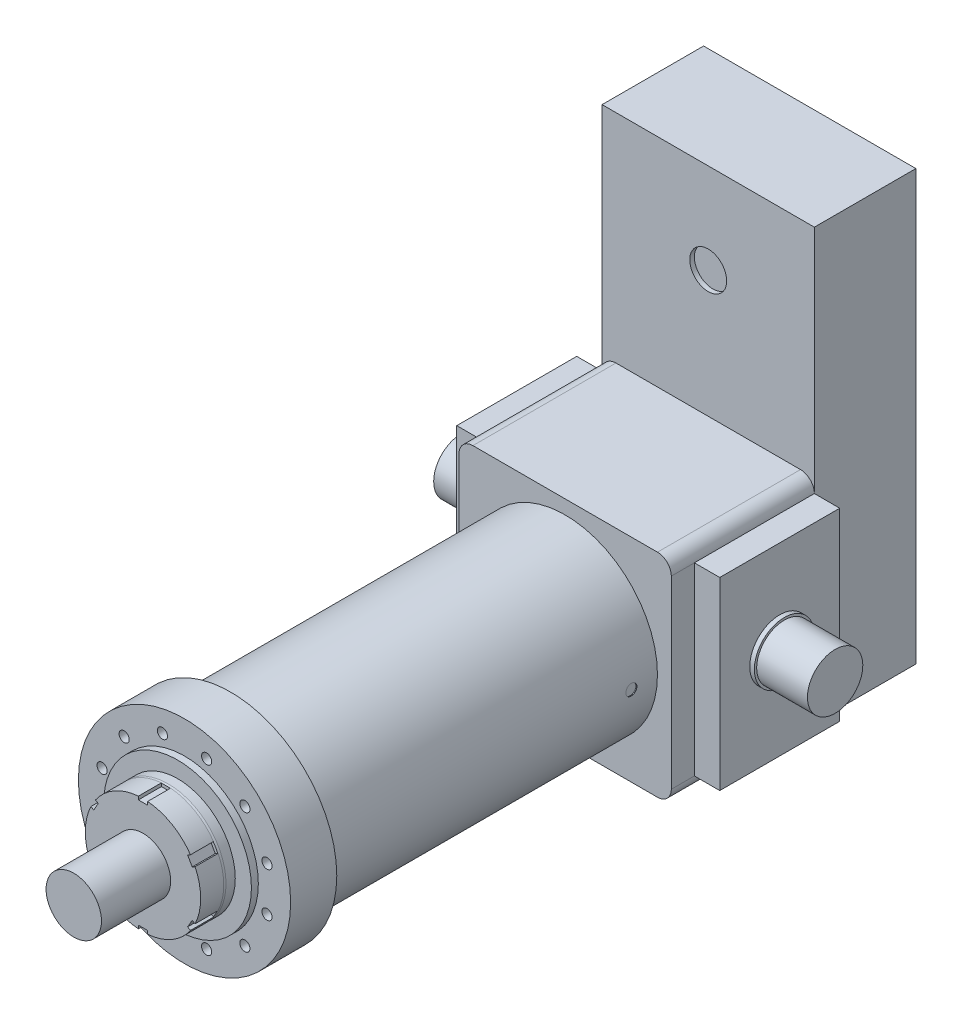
ISO-10303-21;
HEADER;
FILE_DESCRIPTION(('STEP AP214'),'2;1');
FILE_NAME('part.step','',(''),(''),'','','');
FILE_SCHEMA(('AUTOMOTIVE_DESIGN { 1 0 10303 214 1 1 1 1 }'));
ENDSEC;
DATA;
#1=APPLICATION_CONTEXT('core data for automotive mechanical design processes');
#2=APPLICATION_PROTOCOL_DEFINITION('international standard','automotive_design',2000,#1);
#3=PRODUCT_CONTEXT('',#1,'mechanical');
#4=PRODUCT('Part','Part','',(#3));
#5=PRODUCT_RELATED_PRODUCT_CATEGORY('part','',(#4));
#6=PRODUCT_DEFINITION_FORMATION('','',#4);
#7=PRODUCT_DEFINITION_CONTEXT('part definition',#1,'design');
#8=PRODUCT_DEFINITION('design','',#6,#7);
#9=PRODUCT_DEFINITION_SHAPE('','',#8);
#10=(LENGTH_UNIT() NAMED_UNIT(*) SI_UNIT(.MILLI.,.METRE.));
#11=(NAMED_UNIT(*) PLANE_ANGLE_UNIT() SI_UNIT($,.RADIAN.));
#12=(NAMED_UNIT(*) SI_UNIT($,.STERADIAN.) SOLID_ANGLE_UNIT());
#13=UNCERTAINTY_MEASURE_WITH_UNIT(LENGTH_MEASURE(1.E-05),#10,'distance_accuracy_value','');
#14=(GEOMETRIC_REPRESENTATION_CONTEXT(3) GLOBAL_UNCERTAINTY_ASSIGNED_CONTEXT((#13)) GLOBAL_UNIT_ASSIGNED_CONTEXT((#10,
#11,#12)) REPRESENTATION_CONTEXT('',''));
#15=CARTESIAN_POINT('',(0.,0.,0.));
#16=DIRECTION('',(0.,0.,1.));
#17=DIRECTION('',(1.,0.,0.));
#18=AXIS2_PLACEMENT_3D('',#15,#16,#17);
#19=CARTESIAN_POINT('',(-285.,0.,0.));
#20=DIRECTION('',(-1.,0.,0.));
#21=DIRECTION('',(0.,-1.,0.));
#22=AXIS2_PLACEMENT_3D('',#19,#20,#21);
#23=PLANE('',#22);
#24=DIRECTION('',(0.,-1.,0.));
#25=VECTOR('',#24,1.);
#26=CARTESIAN_POINT('',(-285.,200.,-310.));
#27=LINE('',#26,#25);
#28=CARTESIAN_POINT('',(-285.,200.,-310.));
#29=VERTEX_POINT('',#28);
#30=CARTESIAN_POINT('',(-285.,-200.,-310.));
#31=VERTEX_POINT('',#30);
#32=EDGE_CURVE('E286',#29,#31,#27,.T.);
#33=ORIENTED_EDGE('',*,*,#32,.T.);
#34=DIRECTION('',(0.,0.,1.));
#35=VECTOR('',#34,1.);
#36=CARTESIAN_POINT('',(-285.,-200.,-310.));
#37=LINE('',#36,#35);
#38=CARTESIAN_POINT('',(-285.,-200.,-49.9999999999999));
#39=VERTEX_POINT('',#38);
#40=EDGE_CURVE('E290',#31,#39,#37,.T.);
#41=ORIENTED_EDGE('',*,*,#40,.T.);
#42=DIRECTION('',(0.,1.,0.));
#43=VECTOR('',#42,1.);
#44=CARTESIAN_POINT('',(-285.,200.,-50.));
#45=LINE('',#44,#43);
#46=CARTESIAN_POINT('',(-285.,200.,-50.));
#47=VERTEX_POINT('',#46);
#48=EDGE_CURVE('E294',#39,#47,#45,.T.);
#49=ORIENTED_EDGE('',*,*,#48,.T.);
#50=DIRECTION('',(0.,0.,-1.));
#51=VECTOR('',#50,1.);
#52=CARTESIAN_POINT('',(-285.,200.,-310.));
#53=LINE('',#52,#51);
#54=EDGE_CURVE('E297',#47,#29,#53,.T.);
#55=ORIENTED_EDGE('',*,*,#54,.T.);
#56=EDGE_LOOP('',(#33,#41,#49,#55));
#57=FACE_BOUND('',#56,.T.);
#58=CARTESIAN_POINT('',(-285.,1.22818422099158E-13,-180.));
#59=DIRECTION('',(-1.,0.,0.));
#60=DIRECTION('',(0.,-1.,0.));
#61=AXIS2_PLACEMENT_3D('',#58,#59,#60);
#62=CIRCLE('',#61,65.);
#63=CARTESIAN_POINT('',(-285.,-64.9999999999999,-180.));
#64=VERTEX_POINT('',#63);
#65=EDGE_CURVE('E543',#64,#64,#62,.T.);
#66=ORIENTED_EDGE('',*,*,#65,.F.);
#67=EDGE_LOOP('',(#66));
#68=FACE_BOUND('',#67,.T.);
#69=ADVANCED_FACE('F49',(#57,#68),#23,.T.);
#70=CARTESIAN_POINT('',(230.,230.,-310.));
#71=DIRECTION('',(-1.,0.,0.));
#72=DIRECTION('',(0.,-1.,0.));
#73=AXIS2_PLACEMENT_3D('',#70,#71,#72);
#74=PLANE('',#73);
#75=DIRECTION('',(0.,-1.,0.));
#76=VECTOR('',#75,1.);
#77=CARTESIAN_POINT('',(230.,700.,-310.));
#78=LINE('',#77,#76);
#79=CARTESIAN_POINT('',(230.,700.,-310.));
#80=VERTEX_POINT('',#79);
#81=CARTESIAN_POINT('',(230.,200.,-310.));
#82=VERTEX_POINT('',#81);
#83=EDGE_CURVE('E263',#80,#82,#78,.T.);
#84=ORIENTED_EDGE('',*,*,#83,.T.);
#85=DIRECTION('',(0.,-1.,0.));
#86=VECTOR('',#85,1.);
#87=CARTESIAN_POINT('',(230.,200.,-310.));
#88=LINE('',#87,#86);
#89=CARTESIAN_POINT('',(230.,-200.,-310.));
#90=VERTEX_POINT('',#89);
#91=EDGE_CURVE('E221',#82,#90,#88,.T.);
#92=ORIENTED_EDGE('',*,*,#91,.T.);
#93=CARTESIAN_POINT('',(230.,-230.,-310.));
#94=VERTEX_POINT('',#93);
#95=EDGE_CURVE('E262',#90,#94,#78,.T.);
#96=ORIENTED_EDGE('',*,*,#95,.T.);
#97=DIRECTION('',(0.,0.,1.));
#98=VECTOR('',#97,1.);
#99=CARTESIAN_POINT('',(230.,-230.,-530.));
#100=LINE('',#99,#98);
#101=CARTESIAN_POINT('',(230.,-230.,-530.));
#102=VERTEX_POINT('',#101);
#103=EDGE_CURVE('E274',#102,#94,#100,.T.);
#104=ORIENTED_EDGE('',*,*,#103,.F.);
#105=DIRECTION('',(0.,-1.,0.));
#106=VECTOR('',#105,1.);
#107=CARTESIAN_POINT('',(230.,700.,-530.));
#108=LINE('',#107,#106);
#109=CARTESIAN_POINT('',(230.,700.,-530.));
#110=VERTEX_POINT('',#109);
#111=EDGE_CURVE('E250',#110,#102,#108,.T.);
#112=ORIENTED_EDGE('',*,*,#111,.F.);
#113=DIRECTION('',(0.,0.,1.));
#114=VECTOR('',#113,1.);
#115=CARTESIAN_POINT('',(230.,700.,-530.));
#116=LINE('',#115,#114);
#117=EDGE_CURVE('E278',#110,#80,#116,.T.);
#118=ORIENTED_EDGE('',*,*,#117,.T.);
#119=EDGE_LOOP('',(#84,#92,#96,#104,#112,#118));
#120=FACE_BOUND('',#119,.T.);
#121=ADVANCED_FACE('F455',(#120),#74,.F.);
#122=CARTESIAN_POINT('',(-230.,230.,-310.));
#123=DIRECTION('',(1.,0.,0.));
#124=DIRECTION('',(0.,1.,0.));
#125=AXIS2_PLACEMENT_3D('',#122,#123,#124);
#126=PLANE('',#125);
#127=DIRECTION('',(0.,1.,0.));
#128=VECTOR('',#127,1.);
#129=CARTESIAN_POINT('',(-230.,200.,-50.));
#130=LINE('',#129,#128);
#131=CARTESIAN_POINT('',(-230.,-200.,-50.));
#132=VERTEX_POINT('',#131);
#133=CARTESIAN_POINT('',(-230.,200.,-50.));
#134=VERTEX_POINT('',#133);
#135=EDGE_CURVE('E76',#132,#134,#130,.T.);
#136=ORIENTED_EDGE('',*,*,#135,.F.);
#137=DIRECTION('',(0.,0.,1.));
#138=VECTOR('',#137,1.);
#139=CARTESIAN_POINT('',(-230.,-200.,-310.));
#140=LINE('',#139,#138);
#141=CARTESIAN_POINT('',(-230.,-200.,0.));
#142=VERTEX_POINT('',#141);
#143=EDGE_CURVE('E391',#132,#142,#140,.T.);
#144=ORIENTED_EDGE('',*,*,#143,.T.);
#145=DIRECTION('',(0.,1.,0.));
#146=VECTOR('',#145,1.);
#147=CARTESIAN_POINT('',(-230.,230.,0.));
#148=LINE('',#147,#146);
#149=CARTESIAN_POINT('',(-230.,200.,0.));
#150=VERTEX_POINT('',#149);
#151=EDGE_CURVE('E320',#142,#150,#148,.T.);
#152=ORIENTED_EDGE('',*,*,#151,.T.);
#153=DIRECTION('',(0.,0.,1.));
#154=VECTOR('',#153,1.);
#155=CARTESIAN_POINT('',(-230.,200.,-310.));
#156=LINE('',#155,#154);
#157=EDGE_CURVE('E389',#150,#134,#156,.F.);
#158=ORIENTED_EDGE('',*,*,#157,.T.);
#159=EDGE_LOOP('',(#136,#144,#152,#158));
#160=FACE_BOUND('',#159,.T.);
#161=ADVANCED_FACE('F436',(#160),#126,.F.);
#162=CARTESIAN_POINT('',(230.,230.,-310.));
#163=DIRECTION('',(0.,-1.,0.));
#164=DIRECTION('',(0.,0.,-1.));
#165=AXIS2_PLACEMENT_3D('',#162,#163,#164);
#166=PLANE('',#165);
#167=DIRECTION('',(1.,0.,0.));
#168=VECTOR('',#167,1.);
#169=CARTESIAN_POINT('',(230.,230.,0.));
#170=LINE('',#169,#168);
#171=CARTESIAN_POINT('',(-200.,230.,0.));
#172=VERTEX_POINT('',#171);
#173=CARTESIAN_POINT('',(200.,230.,0.));
#174=VERTEX_POINT('',#173);
#175=EDGE_CURVE('E330',#172,#174,#170,.T.);
#176=ORIENTED_EDGE('',*,*,#175,.T.);
#177=DIRECTION('',(0.,0.,1.));
#178=VECTOR('',#177,1.);
#179=CARTESIAN_POINT('',(200.,230.,-310.));
#180=LINE('',#179,#178);
#181=CARTESIAN_POINT('',(200.,230.,-310.));
#182=VERTEX_POINT('',#181);
#183=EDGE_CURVE('E387',#174,#182,#180,.F.);
#184=ORIENTED_EDGE('',*,*,#183,.T.);
#185=DIRECTION('',(1.,0.,0.));
#186=VECTOR('',#185,1.);
#187=CARTESIAN_POINT('',(230.,230.,-310.));
#188=LINE('',#187,#186);
#189=CARTESIAN_POINT('',(-200.,230.,-310.));
#190=VERTEX_POINT('',#189);
#191=EDGE_CURVE('E321',#190,#182,#188,.T.);
#192=ORIENTED_EDGE('',*,*,#191,.F.);
#193=DIRECTION('',(0.,0.,1.));
#194=VECTOR('',#193,1.);
#195=CARTESIAN_POINT('',(-200.,230.,-310.));
#196=LINE('',#195,#194);
#197=EDGE_CURVE('E383',#190,#172,#196,.T.);
#198=ORIENTED_EDGE('',*,*,#197,.T.);
#199=EDGE_LOOP('',(#176,#184,#192,#198));
#200=FACE_BOUND('',#199,.T.);
#201=ADVANCED_FACE('F699',(#200),#166,.F.);
#202=DIRECTION('',(0.,0.,1.));
#203=VECTOR('',#202,1.);
#204=CARTESIAN_POINT('',(230.,-200.,-310.));
#205=LINE('',#204,#203);
#206=CARTESIAN_POINT('',(230.,-200.,0.));
#207=VERTEX_POINT('',#206);
#208=CARTESIAN_POINT('',(230.,-200.,-49.9999999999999));
#209=VERTEX_POINT('',#208);
#210=EDGE_CURVE('E364',#207,#209,#205,.F.);
#211=ORIENTED_EDGE('',*,*,#210,.T.);
#212=DIRECTION('',(0.,1.,0.));
#213=VECTOR('',#212,1.);
#214=CARTESIAN_POINT('',(230.,200.,-50.));
#215=LINE('',#214,#213);
#216=CARTESIAN_POINT('',(230.,200.,-50.));
#217=VERTEX_POINT('',#216);
#218=EDGE_CURVE('E208',#209,#217,#215,.T.);
#219=ORIENTED_EDGE('',*,*,#218,.T.);
#220=DIRECTION('',(0.,0.,1.));
#221=VECTOR('',#220,1.);
#222=CARTESIAN_POINT('',(230.,200.,-310.));
#223=LINE('',#222,#221);
#224=CARTESIAN_POINT('',(230.,200.,0.));
#225=VERTEX_POINT('',#224);
#226=EDGE_CURVE('E359',#217,#225,#223,.T.);
#227=ORIENTED_EDGE('',*,*,#226,.T.);
#228=DIRECTION('',(0.,-1.,0.));
#229=VECTOR('',#228,1.);
#230=CARTESIAN_POINT('',(230.,230.,0.));
#231=LINE('',#230,#229);
#232=EDGE_CURVE('E334',#225,#207,#231,.T.);
#233=ORIENTED_EDGE('',*,*,#232,.T.);
#234=EDGE_LOOP('',(#211,#219,#227,#233));
#235=FACE_BOUND('',#234,.T.);
#236=ADVANCED_FACE('F461',(#235),#74,.F.);
#237=CARTESIAN_POINT('',(230.,-230.,-310.));
#238=DIRECTION('',(0.,1.,0.));
#239=DIRECTION('',(0.,0.,1.));
#240=AXIS2_PLACEMENT_3D('',#237,#238,#239);
#241=PLANE('',#240);
#242=DIRECTION('',(0.,0.,1.));
#243=VECTOR('',#242,1.);
#244=CARTESIAN_POINT('',(-200.,-230.,-310.));
#245=LINE('',#244,#243);
#246=CARTESIAN_POINT('',(-200.,-230.,0.));
#247=VERTEX_POINT('',#246);
#248=CARTESIAN_POINT('',(-200.,-230.,-310.));
#249=VERTEX_POINT('',#248);
#250=EDGE_CURVE('E325',#247,#249,#245,.F.);
#251=ORIENTED_EDGE('',*,*,#250,.T.);
#252=DIRECTION('',(-1.,0.,0.));
#253=VECTOR('',#252,1.);
#254=CARTESIAN_POINT('',(230.,-230.,-310.));
#255=LINE('',#254,#253);
#256=CARTESIAN_POINT('',(-230.,-230.,-310.));
#257=VERTEX_POINT('',#256);
#258=EDGE_CURVE('E267',#249,#257,#255,.T.);
#259=ORIENTED_EDGE('',*,*,#258,.T.);
#260=DIRECTION('',(0.,0.,1.));
#261=VECTOR('',#260,1.);
#262=CARTESIAN_POINT('',(-230.,-230.,-530.));
#263=LINE('',#262,#261);
#264=CARTESIAN_POINT('',(-230.,-230.,-530.));
#265=VERTEX_POINT('',#264);
#266=EDGE_CURVE('E255',#265,#257,#263,.T.);
#267=ORIENTED_EDGE('',*,*,#266,.F.);
#268=DIRECTION('',(-1.,0.,0.));
#269=VECTOR('',#268,1.);
#270=CARTESIAN_POINT('',(230.,-230.,-530.));
#271=LINE('',#270,#269);
#272=EDGE_CURVE('E253',#102,#265,#271,.T.);
#273=ORIENTED_EDGE('',*,*,#272,.F.);
#274=ORIENTED_EDGE('',*,*,#103,.T.);
#275=CARTESIAN_POINT('',(200.,-230.,-310.));
#276=VERTEX_POINT('',#275);
#277=EDGE_CURVE('E247',#94,#276,#255,.T.);
#278=ORIENTED_EDGE('',*,*,#277,.T.);
#279=DIRECTION('',(0.,0.,1.));
#280=VECTOR('',#279,1.);
#281=CARTESIAN_POINT('',(200.,-230.,-310.));
#282=LINE('',#281,#280);
#283=CARTESIAN_POINT('',(200.,-230.,0.));
#284=VERTEX_POINT('',#283);
#285=EDGE_CURVE('E343',#276,#284,#282,.T.);
#286=ORIENTED_EDGE('',*,*,#285,.T.);
#287=DIRECTION('',(-1.,0.,0.));
#288=VECTOR('',#287,1.);
#289=CARTESIAN_POINT('',(230.,-230.,0.));
#290=LINE('',#289,#288);
#291=EDGE_CURVE('E326',#284,#247,#290,.T.);
#292=ORIENTED_EDGE('',*,*,#291,.T.);
#293=EDGE_LOOP('',(#251,#259,#267,#273,#274,#278,#286,#292));
#294=FACE_BOUND('',#293,.T.);
#295=ADVANCED_FACE('F430',(#294),#241,.F.);
#296=CARTESIAN_POINT('',(0.,0.,-310.));
#297=DIRECTION('',(0.,0.,-1.));
#298=DIRECTION('',(-1.,0.,0.));
#299=AXIS2_PLACEMENT_3D('',#296,#297,#298);
#300=PLANE('',#299);
#301=DIRECTION('',(0.,1.,0.));
#302=VECTOR('',#301,1.);
#303=CARTESIAN_POINT('',(-230.,700.,-310.));
#304=LINE('',#303,#302);
#305=CARTESIAN_POINT('',(-230.,-200.,-310.));
#306=VERTEX_POINT('',#305);
#307=CARTESIAN_POINT('',(-230.,200.,-310.));
#308=VERTEX_POINT('',#307);
#309=EDGE_CURVE('E12',#306,#308,#304,.T.);
#310=ORIENTED_EDGE('',*,*,#309,.F.);
#311=DIRECTION('',(1.,0.,0.));
#312=VECTOR('',#311,1.);
#313=CARTESIAN_POINT('',(-285.,-200.,-310.));
#314=LINE('',#313,#312);
#315=EDGE_CURVE('E316',#31,#306,#314,.T.);
#316=ORIENTED_EDGE('',*,*,#315,.F.);
#317=ORIENTED_EDGE('',*,*,#32,.F.);
#318=DIRECTION('',(1.,0.,0.));
#319=VECTOR('',#318,1.);
#320=CARTESIAN_POINT('',(-285.,200.,-310.));
#321=LINE('',#320,#319);
#322=EDGE_CURVE('E300',#29,#308,#321,.T.);
#323=ORIENTED_EDGE('',*,*,#322,.T.);
#324=EDGE_LOOP('',(#310,#316,#317,#323));
#325=FACE_BOUND('',#324,.T.);
#326=ADVANCED_FACE('F414',(#325),#300,.T.);
#327=CARTESIAN_POINT('',(0.,0.,0.));
#328=DIRECTION('',(0.,0.,-1.));
#329=DIRECTION('',(-1.,0.,0.));
#330=AXIS2_PLACEMENT_3D('',#327,#328,#329);
#331=PLANE('',#330);
#332=ORIENTED_EDGE('',*,*,#291,.F.);
#333=CARTESIAN_POINT('',(200.,-200.,0.));
#334=DIRECTION('',(0.,0.,-1.));
#335=DIRECTION('',(-1.,0.,0.));
#336=AXIS2_PLACEMENT_3D('',#333,#334,#335);
#337=CIRCLE('',#336,30.);
#338=EDGE_CURVE('E356',#284,#207,#337,.F.);
#339=ORIENTED_EDGE('',*,*,#338,.T.);
#340=ORIENTED_EDGE('',*,*,#232,.F.);
#341=CARTESIAN_POINT('',(200.,200.,0.));
#342=DIRECTION('',(0.,0.,-1.));
#343=DIRECTION('',(-1.,0.,0.));
#344=AXIS2_PLACEMENT_3D('',#341,#342,#343);
#345=CIRCLE('',#344,30.);
#346=EDGE_CURVE('E353',#225,#174,#345,.F.);
#347=ORIENTED_EDGE('',*,*,#346,.T.);
#348=ORIENTED_EDGE('',*,*,#175,.F.);
#349=CARTESIAN_POINT('',(-200.,200.,0.));
#350=DIRECTION('',(0.,0.,-1.));
#351=DIRECTION('',(-1.,0.,0.));
#352=AXIS2_PLACEMENT_3D('',#349,#350,#351);
#353=CIRCLE('',#352,30.);
#354=EDGE_CURVE('E347',#172,#150,#353,.F.);
#355=ORIENTED_EDGE('',*,*,#354,.T.);
#356=ORIENTED_EDGE('',*,*,#151,.F.);
#357=CARTESIAN_POINT('',(-200.,-200.,0.));
#358=DIRECTION('',(0.,0.,-1.));
#359=DIRECTION('',(-1.,0.,0.));
#360=AXIS2_PLACEMENT_3D('',#357,#358,#359);
#361=CIRCLE('',#360,30.);
#362=EDGE_CURVE('E350',#142,#247,#361,.F.);
#363=ORIENTED_EDGE('',*,*,#362,.T.);
#364=EDGE_LOOP('',(#332,#339,#340,#347,#348,#355,#356,#363));
#365=FACE_BOUND('',#364,.T.);
#366=ADVANCED_FACE('F433',(#365),#331,.F.);
#367=CARTESIAN_POINT('',(200.,-200.,-310.));
#368=DIRECTION('',(0.,0.,1.));
#369=DIRECTION('',(1.,0.,0.));
#370=AXIS2_PLACEMENT_3D('',#367,#368,#369);
#371=CYLINDRICAL_SURFACE('',#370,30.);
#372=CARTESIAN_POINT('',(200.,-200.,-310.));
#373=DIRECTION('',(0.,0.,-1.));
#374=DIRECTION('',(-1.,0.,0.));
#375=AXIS2_PLACEMENT_3D('',#372,#373,#374);
#376=CIRCLE('',#375,30.);
#377=EDGE_CURVE('E379',#90,#276,#376,.T.);
#378=ORIENTED_EDGE('',*,*,#377,.F.);
#379=DIRECTION('',(0.,0.,1.));
#380=VECTOR('',#379,1.);
#381=CARTESIAN_POINT('',(230.,-200.,-310.));
#382=LINE('',#381,#380);
#383=EDGE_CURVE('E68',#90,#209,#382,.T.);
#384=ORIENTED_EDGE('',*,*,#383,.T.);
#385=ORIENTED_EDGE('',*,*,#210,.F.);
#386=ORIENTED_EDGE('',*,*,#338,.F.);
#387=ORIENTED_EDGE('',*,*,#285,.F.);
#388=EDGE_LOOP('',(#378,#384,#385,#386,#387));
#389=FACE_BOUND('',#388,.T.);
#390=ADVANCED_FACE('F677',(#389),#371,.T.);
#391=CARTESIAN_POINT('',(200.,200.,-310.));
#392=DIRECTION('',(0.,0.,1.));
#393=DIRECTION('',(1.,0.,0.));
#394=AXIS2_PLACEMENT_3D('',#391,#392,#393);
#395=CYLINDRICAL_SURFACE('',#394,30.);
#396=CARTESIAN_POINT('',(200.,200.,-310.));
#397=DIRECTION('',(0.,0.,-1.));
#398=DIRECTION('',(-1.,0.,0.));
#399=AXIS2_PLACEMENT_3D('',#396,#397,#398);
#400=CIRCLE('',#399,30.);
#401=EDGE_CURVE('E375',#182,#82,#400,.T.);
#402=ORIENTED_EDGE('',*,*,#401,.F.);
#403=ORIENTED_EDGE('',*,*,#183,.F.);
#404=ORIENTED_EDGE('',*,*,#346,.F.);
#405=ORIENTED_EDGE('',*,*,#226,.F.);
#406=EDGE_CURVE('E360',#82,#217,#223,.T.);
#407=ORIENTED_EDGE('',*,*,#406,.F.);
#408=EDGE_LOOP('',(#402,#403,#404,#405,#407));
#409=FACE_BOUND('',#408,.T.);
#410=ADVANCED_FACE('F672',(#409),#395,.T.);
#411=CARTESIAN_POINT('',(-200.,-200.,-310.));
#412=DIRECTION('',(0.,0.,1.));
#413=DIRECTION('',(1.,0.,0.));
#414=AXIS2_PLACEMENT_3D('',#411,#412,#413);
#415=CYLINDRICAL_SURFACE('',#414,30.);
#416=CARTESIAN_POINT('',(-200.,-200.,-310.));
#417=DIRECTION('',(0.,0.,-1.));
#418=DIRECTION('',(-1.,0.,0.));
#419=AXIS2_PLACEMENT_3D('',#416,#417,#418);
#420=CIRCLE('',#419,30.);
#421=EDGE_CURVE('E371',#249,#306,#420,.T.);
#422=ORIENTED_EDGE('',*,*,#421,.F.);
#423=ORIENTED_EDGE('',*,*,#250,.F.);
#424=ORIENTED_EDGE('',*,*,#362,.F.);
#425=ORIENTED_EDGE('',*,*,#143,.F.);
#426=EDGE_CURVE('E53',#306,#132,#140,.T.);
#427=ORIENTED_EDGE('',*,*,#426,.F.);
#428=EDGE_LOOP('',(#422,#423,#424,#425,#427));
#429=FACE_BOUND('',#428,.T.);
#430=ADVANCED_FACE('F427',(#429),#415,.T.);
#431=CARTESIAN_POINT('',(-200.,200.,-310.));
#432=DIRECTION('',(0.,0.,1.));
#433=DIRECTION('',(1.,0.,0.));
#434=AXIS2_PLACEMENT_3D('',#431,#432,#433);
#435=CYLINDRICAL_SURFACE('',#434,30.);
#436=CARTESIAN_POINT('',(-200.,200.,-310.));
#437=DIRECTION('',(0.,0.,-1.));
#438=DIRECTION('',(-1.,0.,0.));
#439=AXIS2_PLACEMENT_3D('',#436,#437,#438);
#440=CIRCLE('',#439,30.);
#441=EDGE_CURVE('E367',#308,#190,#440,.T.);
#442=ORIENTED_EDGE('',*,*,#441,.F.);
#443=DIRECTION('',(0.,0.,-1.));
#444=VECTOR('',#443,1.);
#445=CARTESIAN_POINT('',(-230.,200.,-310.));
#446=LINE('',#445,#444);
#447=EDGE_CURVE('E291',#134,#308,#446,.T.);
#448=ORIENTED_EDGE('',*,*,#447,.F.);
#449=ORIENTED_EDGE('',*,*,#157,.F.);
#450=ORIENTED_EDGE('',*,*,#354,.F.);
#451=ORIENTED_EDGE('',*,*,#197,.F.);
#452=EDGE_LOOP('',(#442,#448,#449,#450,#451));
#453=FACE_BOUND('',#452,.T.);
#454=ADVANCED_FACE('F51',(#453),#435,.T.);
#455=CARTESIAN_POINT('',(-285.,-200.,-310.));
#456=DIRECTION('',(0.,1.,0.));
#457=DIRECTION('',(-1.,0.,0.));
#458=AXIS2_PLACEMENT_3D('',#455,#456,#457);
#459=PLANE('',#458);
#460=ORIENTED_EDGE('',*,*,#426,.T.);
#461=DIRECTION('',(1.,0.,0.));
#462=VECTOR('',#461,1.);
#463=CARTESIAN_POINT('',(-285.,-200.,-49.9999999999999));
#464=LINE('',#463,#462);
#465=EDGE_CURVE('E312',#39,#132,#464,.T.);
#466=ORIENTED_EDGE('',*,*,#465,.F.);
#467=ORIENTED_EDGE('',*,*,#40,.F.);
#468=ORIENTED_EDGE('',*,*,#315,.T.);
#469=EDGE_LOOP('',(#460,#466,#467,#468));
#470=FACE_BOUND('',#469,.T.);
#471=ADVANCED_FACE('F400',(#470),#459,.F.);
#472=CARTESIAN_POINT('',(-285.,200.,-50.));
#473=DIRECTION('',(0.,0.,-1.));
#474=DIRECTION('',(0.,1.,0.));
#475=AXIS2_PLACEMENT_3D('',#472,#473,#474);
#476=PLANE('',#475);
#477=ORIENTED_EDGE('',*,*,#135,.T.);
#478=DIRECTION('',(1.,0.,0.));
#479=VECTOR('',#478,1.);
#480=CARTESIAN_POINT('',(-285.,200.,-50.));
#481=LINE('',#480,#479);
#482=EDGE_CURVE('E308',#47,#134,#481,.T.);
#483=ORIENTED_EDGE('',*,*,#482,.F.);
#484=ORIENTED_EDGE('',*,*,#48,.F.);
#485=ORIENTED_EDGE('',*,*,#465,.T.);
#486=EDGE_LOOP('',(#477,#483,#484,#485));
#487=FACE_BOUND('',#486,.T.);
#488=ADVANCED_FACE('F406',(#487),#476,.F.);
#489=CARTESIAN_POINT('',(-285.,200.,-310.));
#490=DIRECTION('',(0.,-1.,0.));
#491=DIRECTION('',(1.,0.,0.));
#492=AXIS2_PLACEMENT_3D('',#489,#490,#491);
#493=PLANE('',#492);
#494=ORIENTED_EDGE('',*,*,#447,.T.);
#495=ORIENTED_EDGE('',*,*,#322,.F.);
#496=ORIENTED_EDGE('',*,*,#54,.F.);
#497=ORIENTED_EDGE('',*,*,#482,.T.);
#498=EDGE_LOOP('',(#494,#495,#496,#497));
#499=FACE_BOUND('',#498,.T.);
#500=ADVANCED_FACE('F441',(#499),#493,.F.);
#501=CARTESIAN_POINT('',(0.,0.,-310.));
#502=DIRECTION('',(0.,0.,-1.));
#503=DIRECTION('',(-1.,0.,0.));
#504=AXIS2_PLACEMENT_3D('',#501,#502,#503);
#505=PLANE('',#504);
#506=ORIENTED_EDGE('',*,*,#95,.F.);
#507=ORIENTED_EDGE('',*,*,#377,.T.);
#508=ORIENTED_EDGE('',*,*,#277,.F.);
#509=EDGE_LOOP('',(#506,#507,#508));
#510=FACE_BOUND('',#509,.T.);
#511=ADVANCED_FACE('F443',(#510),#505,.F.);
#512=ORIENTED_EDGE('',*,*,#258,.F.);
#513=ORIENTED_EDGE('',*,*,#421,.T.);
#514=EDGE_CURVE('E60',#257,#306,#304,.T.);
#515=ORIENTED_EDGE('',*,*,#514,.F.);
#516=EDGE_LOOP('',(#512,#513,#515));
#517=FACE_BOUND('',#516,.T.);
#518=ADVANCED_FACE('F425',(#517),#505,.F.);
#519=CARTESIAN_POINT('',(0.,504.,-310.));
#520=DIRECTION('',(0.,0.,1.));
#521=DIRECTION('',(1.,0.,0.));
#522=AXIS2_PLACEMENT_3D('',#519,#520,#521);
#523=CIRCLE('',#522,40.);
#524=CARTESIAN_POINT('',(40.,504.,-310.));
#525=VERTEX_POINT('',#524);
#526=EDGE_CURVE('E228',#525,#525,#523,.T.);
#527=ORIENTED_EDGE('',*,*,#526,.F.);
#528=EDGE_LOOP('',(#527));
#529=FACE_BOUND('',#528,.T.);
#530=CARTESIAN_POINT('',(-230.,700.,-310.));
#531=VERTEX_POINT('',#530);
#532=EDGE_CURVE('E61',#308,#531,#304,.T.);
#533=ORIENTED_EDGE('',*,*,#532,.F.);
#534=ORIENTED_EDGE('',*,*,#441,.T.);
#535=ORIENTED_EDGE('',*,*,#191,.T.);
#536=ORIENTED_EDGE('',*,*,#401,.T.);
#537=ORIENTED_EDGE('',*,*,#83,.F.);
#538=DIRECTION('',(1.,0.,0.));
#539=VECTOR('',#538,1.);
#540=CARTESIAN_POINT('',(230.,700.,-310.));
#541=LINE('',#540,#539);
#542=EDGE_CURVE('E259',#531,#80,#541,.T.);
#543=ORIENTED_EDGE('',*,*,#542,.F.);
#544=EDGE_LOOP('',(#533,#534,#535,#536,#537,#543));
#545=FACE_BOUND('',#544,.T.);
#546=ADVANCED_FACE('F451',(#529,#545),#505,.F.);
#547=CARTESIAN_POINT('',(-230.,700.,-530.));
#548=DIRECTION('',(1.,0.,0.));
#549=DIRECTION('',(0.,1.,0.));
#550=AXIS2_PLACEMENT_3D('',#547,#548,#549);
#551=PLANE('',#550);
#552=ORIENTED_EDGE('',*,*,#514,.T.);
#553=ORIENTED_EDGE('',*,*,#309,.T.);
#554=ORIENTED_EDGE('',*,*,#532,.T.);
#555=DIRECTION('',(0.,0.,1.));
#556=VECTOR('',#555,1.);
#557=CARTESIAN_POINT('',(-230.,700.,-530.));
#558=LINE('',#557,#556);
#559=CARTESIAN_POINT('',(-230.,700.,-530.));
#560=VERTEX_POINT('',#559);
#561=EDGE_CURVE('E282',#560,#531,#558,.T.);
#562=ORIENTED_EDGE('',*,*,#561,.F.);
#563=DIRECTION('',(0.,1.,0.));
#564=VECTOR('',#563,1.);
#565=CARTESIAN_POINT('',(-230.,700.,-530.));
#566=LINE('',#565,#564);
#567=EDGE_CURVE('E242',#265,#560,#566,.T.);
#568=ORIENTED_EDGE('',*,*,#567,.F.);
#569=ORIENTED_EDGE('',*,*,#266,.T.);
#570=EDGE_LOOP('',(#552,#553,#554,#562,#568,#569));
#571=FACE_BOUND('',#570,.T.);
#572=ADVANCED_FACE('F416',(#571),#551,.F.);
#573=CARTESIAN_POINT('',(230.,700.,-530.));
#574=DIRECTION('',(0.,-1.,0.));
#575=DIRECTION('',(0.,0.,-1.));
#576=AXIS2_PLACEMENT_3D('',#573,#574,#575);
#577=PLANE('',#576);
#578=ORIENTED_EDGE('',*,*,#542,.T.);
#579=ORIENTED_EDGE('',*,*,#117,.F.);
#580=DIRECTION('',(1.,0.,0.));
#581=VECTOR('',#580,1.);
#582=CARTESIAN_POINT('',(230.,700.,-530.));
#583=LINE('',#582,#581);
#584=EDGE_CURVE('E246',#560,#110,#583,.T.);
#585=ORIENTED_EDGE('',*,*,#584,.F.);
#586=ORIENTED_EDGE('',*,*,#561,.T.);
#587=EDGE_LOOP('',(#578,#579,#585,#586));
#588=FACE_BOUND('',#587,.T.);
#589=ADVANCED_FACE('F465',(#588),#577,.F.);
#590=CARTESIAN_POINT('',(0.,0.,-530.));
#591=DIRECTION('',(0.,0.,-1.));
#592=DIRECTION('',(-1.,0.,0.));
#593=AXIS2_PLACEMENT_3D('',#590,#591,#592);
#594=PLANE('',#593);
#595=ORIENTED_EDGE('',*,*,#567,.T.);
#596=ORIENTED_EDGE('',*,*,#584,.T.);
#597=ORIENTED_EDGE('',*,*,#111,.T.);
#598=ORIENTED_EDGE('',*,*,#272,.T.);
#599=EDGE_LOOP('',(#595,#596,#597,#598));
#600=FACE_BOUND('',#599,.T.);
#601=ADVANCED_FACE('F467',(#600),#594,.T.);
#602=CARTESIAN_POINT('',(0.,504.,-320.));
#603=DIRECTION('',(0.,0.,1.));
#604=DIRECTION('',(1.,0.,0.));
#605=AXIS2_PLACEMENT_3D('',#602,#603,#604);
#606=CYLINDRICAL_SURFACE('',#605,40.);
#607=CARTESIAN_POINT('',(0.,504.,-320.));
#608=DIRECTION('',(0.,0.,1.));
#609=DIRECTION('',(1.,0.,0.));
#610=AXIS2_PLACEMENT_3D('',#607,#608,#609);
#611=CIRCLE('',#610,40.);
#612=CARTESIAN_POINT('',(40.,504.,-320.));
#613=VERTEX_POINT('',#612);
#614=EDGE_CURVE('E235',#613,#613,#611,.T.);
#615=ORIENTED_EDGE('',*,*,#614,.F.);
#616=EDGE_LOOP('',(#615));
#617=FACE_BOUND('',#616,.T.);
#618=ORIENTED_EDGE('',*,*,#526,.T.);
#619=EDGE_LOOP('',(#618));
#620=FACE_BOUND('',#619,.T.);
#621=ADVANCED_FACE('F472',(#617,#620),#606,.F.);
#622=CARTESIAN_POINT('',(0.,504.,-320.));
#623=DIRECTION('',(0.,0.,1.));
#624=DIRECTION('',(1.,0.,0.));
#625=AXIS2_PLACEMENT_3D('',#622,#623,#624);
#626=PLANE('',#625);
#627=ORIENTED_EDGE('',*,*,#614,.T.);
#628=EDGE_LOOP('',(#627));
#629=FACE_BOUND('',#628,.T.);
#630=ADVANCED_FACE('F476',(#629),#626,.T.);
#631=CARTESIAN_POINT('',(285.,200.,-310.));
#632=DIRECTION('',(0.,0.,-1.));
#633=DIRECTION('',(-1.,0.,0.));
#634=AXIS2_PLACEMENT_3D('',#631,#632,#633);
#635=PLANE('',#634);
#636=ORIENTED_EDGE('',*,*,#91,.F.);
#637=DIRECTION('',(-1.,0.,0.));
#638=VECTOR('',#637,1.);
#639=CARTESIAN_POINT('',(285.,200.,-310.));
#640=LINE('',#639,#638);
#641=CARTESIAN_POINT('',(285.,200.,-310.));
#642=VERTEX_POINT('',#641);
#643=EDGE_CURVE('E206',#642,#82,#640,.T.);
#644=ORIENTED_EDGE('',*,*,#643,.F.);
#645=DIRECTION('',(0.,-1.,0.));
#646=VECTOR('',#645,1.);
#647=CARTESIAN_POINT('',(285.,200.,-310.));
#648=LINE('',#647,#646);
#649=CARTESIAN_POINT('',(285.,-200.,-310.));
#650=VERTEX_POINT('',#649);
#651=EDGE_CURVE('E198',#642,#650,#648,.T.);
#652=ORIENTED_EDGE('',*,*,#651,.T.);
#653=DIRECTION('',(-1.,0.,0.));
#654=VECTOR('',#653,1.);
#655=CARTESIAN_POINT('',(285.,-200.,-310.));
#656=LINE('',#655,#654);
#657=EDGE_CURVE('E181',#650,#90,#656,.T.);
#658=ORIENTED_EDGE('',*,*,#657,.T.);
#659=EDGE_LOOP('',(#636,#644,#652,#658));
#660=FACE_BOUND('',#659,.T.);
#661=ADVANCED_FACE('F204',(#660),#635,.T.);
#662=CARTESIAN_POINT('',(285.,200.,-310.));
#663=DIRECTION('',(0.,1.,0.));
#664=DIRECTION('',(-1.,0.,0.));
#665=AXIS2_PLACEMENT_3D('',#662,#663,#664);
#666=PLANE('',#665);
#667=ORIENTED_EDGE('',*,*,#406,.T.);
#668=DIRECTION('',(-1.,0.,0.));
#669=VECTOR('',#668,1.);
#670=CARTESIAN_POINT('',(285.,200.,-50.));
#671=LINE('',#670,#669);
#672=CARTESIAN_POINT('',(285.,200.,-50.));
#673=VERTEX_POINT('',#672);
#674=EDGE_CURVE('E229',#673,#217,#671,.T.);
#675=ORIENTED_EDGE('',*,*,#674,.F.);
#676=DIRECTION('',(0.,0.,-1.));
#677=VECTOR('',#676,1.);
#678=CARTESIAN_POINT('',(285.,200.,-310.));
#679=LINE('',#678,#677);
#680=EDGE_CURVE('E191',#673,#642,#679,.T.);
#681=ORIENTED_EDGE('',*,*,#680,.T.);
#682=ORIENTED_EDGE('',*,*,#643,.T.);
#683=EDGE_LOOP('',(#667,#675,#681,#682));
#684=FACE_BOUND('',#683,.T.);
#685=ADVANCED_FACE('F483',(#684),#666,.T.);
#686=CARTESIAN_POINT('',(285.,200.,-50.));
#687=DIRECTION('',(0.,0.,1.));
#688=DIRECTION('',(0.,-1.,0.));
#689=AXIS2_PLACEMENT_3D('',#686,#687,#688);
#690=PLANE('',#689);
#691=ORIENTED_EDGE('',*,*,#218,.F.);
#692=DIRECTION('',(-1.,0.,0.));
#693=VECTOR('',#692,1.);
#694=CARTESIAN_POINT('',(285.,-200.,-49.9999999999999));
#695=LINE('',#694,#693);
#696=CARTESIAN_POINT('',(285.,-200.,-49.9999999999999));
#697=VERTEX_POINT('',#696);
#698=EDGE_CURVE('E190',#697,#209,#695,.T.);
#699=ORIENTED_EDGE('',*,*,#698,.F.);
#700=DIRECTION('',(0.,1.,0.));
#701=VECTOR('',#700,1.);
#702=CARTESIAN_POINT('',(285.,200.,-50.));
#703=LINE('',#702,#701);
#704=EDGE_CURVE('E201',#697,#673,#703,.T.);
#705=ORIENTED_EDGE('',*,*,#704,.T.);
#706=ORIENTED_EDGE('',*,*,#674,.T.);
#707=EDGE_LOOP('',(#691,#699,#705,#706));
#708=FACE_BOUND('',#707,.T.);
#709=ADVANCED_FACE('F486',(#708),#690,.T.);
#710=CARTESIAN_POINT('',(285.,-200.,-310.));
#711=DIRECTION('',(0.,-1.,0.));
#712=DIRECTION('',(1.,0.,0.));
#713=AXIS2_PLACEMENT_3D('',#710,#711,#712);
#714=PLANE('',#713);
#715=ORIENTED_EDGE('',*,*,#383,.F.);
#716=ORIENTED_EDGE('',*,*,#657,.F.);
#717=DIRECTION('',(0.,0.,1.));
#718=VECTOR('',#717,1.);
#719=CARTESIAN_POINT('',(285.,-200.,-310.));
#720=LINE('',#719,#718);
#721=EDGE_CURVE('E185',#650,#697,#720,.T.);
#722=ORIENTED_EDGE('',*,*,#721,.T.);
#723=ORIENTED_EDGE('',*,*,#698,.T.);
#724=EDGE_LOOP('',(#715,#716,#722,#723));
#725=FACE_BOUND('',#724,.T.);
#726=ADVANCED_FACE('F183',(#725),#714,.T.);
#727=CARTESIAN_POINT('',(285.,0.,0.));
#728=DIRECTION('',(-1.,0.,0.));
#729=DIRECTION('',(0.,-1.,0.));
#730=AXIS2_PLACEMENT_3D('',#727,#728,#729);
#731=PLANE('',#730);
#732=CARTESIAN_POINT('',(285.,0.,-180.));
#733=DIRECTION('',(-1.,0.,0.));
#734=DIRECTION('',(0.,-1.,0.));
#735=AXIS2_PLACEMENT_3D('',#732,#733,#734);
#736=CIRCLE('',#735,65.);
#737=CARTESIAN_POINT('',(285.,-65.,-180.));
#738=VERTEX_POINT('',#737);
#739=EDGE_CURVE('E538',#738,#738,#736,.T.);
#740=ORIENTED_EDGE('',*,*,#739,.T.);
#741=EDGE_LOOP('',(#740));
#742=FACE_BOUND('',#741,.T.);
#743=ORIENTED_EDGE('',*,*,#651,.F.);
#744=ORIENTED_EDGE('',*,*,#680,.F.);
#745=ORIENTED_EDGE('',*,*,#704,.F.);
#746=ORIENTED_EDGE('',*,*,#721,.F.);
#747=EDGE_LOOP('',(#743,#744,#745,#746));
#748=FACE_BOUND('',#747,.T.);
#749=ADVANCED_FACE('F196',(#742,#748),#731,.F.);
#750=CARTESIAN_POINT('',(-295.,1.24206200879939E-13,-180.));
#751=DIRECTION('',(-1.,0.,0.));
#752=DIRECTION('',(0.,-1.,0.));
#753=AXIS2_PLACEMENT_3D('',#750,#751,#752);
#754=PLANE('',#753);
#755=CARTESIAN_POINT('',(-295.,1.24206200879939E-13,-180.));
#756=DIRECTION('',(-1.,0.,0.));
#757=DIRECTION('',(0.,-1.,0.));
#758=AXIS2_PLACEMENT_3D('',#755,#756,#757);
#759=CIRCLE('',#758,65.);
#760=CARTESIAN_POINT('',(-295.,-64.9999999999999,-180.));
#761=VERTEX_POINT('',#760);
#762=EDGE_CURVE('E549',#761,#761,#759,.T.);
#763=ORIENTED_EDGE('',*,*,#762,.T.);
#764=EDGE_LOOP('',(#763));
#765=FACE_BOUND('',#764,.T.);
#766=CARTESIAN_POINT('',(-295.,1.24206200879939E-13,-180.));
#767=DIRECTION('',(-1.,0.,0.));
#768=DIRECTION('',(0.,-1.,0.));
#769=AXIS2_PLACEMENT_3D('',#766,#767,#768);
#770=CIRCLE('',#769,60.);
#771=CARTESIAN_POINT('',(-295.,-59.9999999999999,-180.));
#772=VERTEX_POINT('',#771);
#773=EDGE_CURVE('E537',#772,#772,#770,.T.);
#774=ORIENTED_EDGE('',*,*,#773,.F.);
#775=EDGE_LOOP('',(#774));
#776=FACE_BOUND('',#775,.T.);
#777=ADVANCED_FACE('F495',(#765,#776),#754,.T.);
#778=CARTESIAN_POINT('',(-295.,1.24206200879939E-13,-180.));
#779=DIRECTION('',(1.,0.,0.));
#780=DIRECTION('',(0.,1.,0.));
#781=AXIS2_PLACEMENT_3D('',#778,#779,#780);
#782=CYLINDRICAL_SURFACE('',#781,65.);
#783=ORIENTED_EDGE('',*,*,#762,.F.);
#784=EDGE_LOOP('',(#783));
#785=FACE_BOUND('',#784,.T.);
#786=ORIENTED_EDGE('',*,*,#65,.T.);
#787=EDGE_LOOP('',(#786));
#788=FACE_BOUND('',#787,.T.);
#789=ADVANCED_FACE('F505',(#785,#788),#782,.T.);
#790=CARTESIAN_POINT('',(-405.,1.39471767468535E-13,-180.));
#791=DIRECTION('',(-1.,0.,0.));
#792=DIRECTION('',(0.,-1.,0.));
#793=AXIS2_PLACEMENT_3D('',#790,#791,#792);
#794=PLANE('',#793);
#795=CARTESIAN_POINT('',(-405.,1.39471767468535E-13,-180.));
#796=DIRECTION('',(-1.,0.,0.));
#797=DIRECTION('',(0.,-1.,0.));
#798=AXIS2_PLACEMENT_3D('',#795,#796,#797);
#799=CIRCLE('',#798,60.);
#800=CARTESIAN_POINT('',(-405.,-59.9999999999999,-180.));
#801=VERTEX_POINT('',#800);
#802=EDGE_CURVE('E214',#801,#801,#799,.T.);
#803=ORIENTED_EDGE('',*,*,#802,.T.);
#804=EDGE_LOOP('',(#803));
#805=FACE_BOUND('',#804,.T.);
#806=ADVANCED_FACE('F501',(#805),#794,.T.);
#807=CARTESIAN_POINT('',(-405.,1.39471767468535E-13,-180.));
#808=DIRECTION('',(1.,0.,0.));
#809=DIRECTION('',(0.,1.,0.));
#810=AXIS2_PLACEMENT_3D('',#807,#808,#809);
#811=CYLINDRICAL_SURFACE('',#810,60.);
#812=ORIENTED_EDGE('',*,*,#773,.T.);
#813=EDGE_LOOP('',(#812));
#814=FACE_BOUND('',#813,.T.);
#815=ORIENTED_EDGE('',*,*,#802,.F.);
#816=EDGE_LOOP('',(#815));
#817=FACE_BOUND('',#816,.T.);
#818=ADVANCED_FACE('F497',(#814,#817),#811,.T.);
#819=CARTESIAN_POINT('',(295.,0.,-180.));
#820=DIRECTION('',(-1.,0.,0.));
#821=DIRECTION('',(0.,-1.,0.));
#822=AXIS2_PLACEMENT_3D('',#819,#820,#821);
#823=CYLINDRICAL_SURFACE('',#822,65.);
#824=CARTESIAN_POINT('',(295.,0.,-180.));
#825=DIRECTION('',(-1.,0.,0.));
#826=DIRECTION('',(0.,-1.,0.));
#827=AXIS2_PLACEMENT_3D('',#824,#825,#826);
#828=CIRCLE('',#827,65.);
#829=CARTESIAN_POINT('',(295.,-65.,-180.));
#830=VERTEX_POINT('',#829);
#831=EDGE_CURVE('E535',#830,#830,#828,.T.);
#832=ORIENTED_EDGE('',*,*,#831,.T.);
#833=EDGE_LOOP('',(#832));
#834=FACE_BOUND('',#833,.T.);
#835=ORIENTED_EDGE('',*,*,#739,.F.);
#836=EDGE_LOOP('',(#835));
#837=FACE_BOUND('',#836,.T.);
#838=ADVANCED_FACE('F500',(#834,#837),#823,.T.);
#839=CARTESIAN_POINT('',(295.,0.,-180.));
#840=DIRECTION('',(-1.,0.,0.));
#841=DIRECTION('',(0.,-1.,0.));
#842=AXIS2_PLACEMENT_3D('',#839,#840,#841);
#843=PLANE('',#842);
#844=CARTESIAN_POINT('',(295.,0.,-180.));
#845=DIRECTION('',(-1.,0.,0.));
#846=DIRECTION('',(0.,-1.,0.));
#847=AXIS2_PLACEMENT_3D('',#844,#845,#846);
#848=CIRCLE('',#847,60.);
#849=CARTESIAN_POINT('',(295.,-60.,-180.));
#850=VERTEX_POINT('',#849);
#851=EDGE_CURVE('E532',#850,#850,#848,.T.);
#852=ORIENTED_EDGE('',*,*,#851,.T.);
#853=EDGE_LOOP('',(#852));
#854=FACE_BOUND('',#853,.T.);
#855=ORIENTED_EDGE('',*,*,#831,.F.);
#856=EDGE_LOOP('',(#855));
#857=FACE_BOUND('',#856,.T.);
#858=ADVANCED_FACE('F514',(#854,#857),#843,.F.);
#859=CARTESIAN_POINT('',(405.,0.,-180.));
#860=DIRECTION('',(-1.,0.,0.));
#861=DIRECTION('',(0.,-1.,0.));
#862=AXIS2_PLACEMENT_3D('',#859,#860,#861);
#863=PLANE('',#862);
#864=CARTESIAN_POINT('',(405.,0.,-180.));
#865=DIRECTION('',(-1.,0.,0.));
#866=DIRECTION('',(0.,-1.,0.));
#867=AXIS2_PLACEMENT_3D('',#864,#865,#866);
#868=CIRCLE('',#867,60.);
#869=CARTESIAN_POINT('',(405.,-60.,-180.));
#870=VERTEX_POINT('',#869);
#871=EDGE_CURVE('E553',#870,#870,#868,.T.);
#872=ORIENTED_EDGE('',*,*,#871,.F.);
#873=EDGE_LOOP('',(#872));
#874=FACE_BOUND('',#873,.T.);
#875=ADVANCED_FACE('F510',(#874),#863,.F.);
#876=CARTESIAN_POINT('',(405.,0.,-180.));
#877=DIRECTION('',(-1.,0.,0.));
#878=DIRECTION('',(0.,-1.,0.));
#879=AXIS2_PLACEMENT_3D('',#876,#877,#878);
#880=CYLINDRICAL_SURFACE('',#879,60.);
#881=ORIENTED_EDGE('',*,*,#871,.T.);
#882=EDGE_LOOP('',(#881));
#883=FACE_BOUND('',#882,.T.);
#884=ORIENTED_EDGE('',*,*,#851,.F.);
#885=EDGE_LOOP('',(#884));
#886=FACE_BOUND('',#885,.T.);
#887=ADVANCED_FACE('F507',(#883,#886),#880,.T.);
#888=CLOSED_SHELL('',(#69,#121,#161,#201,#236,#295,#326,#366,#390,#410,#430,#454,#471,#488,#500,
#511,#518,#546,#572,#589,#601,#621,#630,#661,#685,#709,#726,#749,#777,#789,#806,#818,#838,#858,
#875,#887));
#889=MANIFOLD_SOLID_BREP('B2',#888);
#890=CARTESIAN_POINT('',(0.,0.,865.));
#891=DIRECTION('',(0.,0.,1.));
#892=DIRECTION('',(1.,0.,0.));
#893=AXIS2_PLACEMENT_3D('',#890,#891,#892);
#894=PLANE('',#893);
#895=DIRECTION('',(0.866025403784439,-0.5,0.));
#896=VECTOR('',#895,1.);
#897=CARTESIAN_POINT('',(112.906209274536,-53.6394249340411,865.));
#898=LINE('',#897,#896);
#899=CARTESIAN_POINT('',(106.757984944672,-50.0897459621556,865.));
#900=VERTEX_POINT('',#899);
#901=CARTESIAN_POINT('',(112.140218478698,-53.1971799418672,865.));
#902=VERTEX_POINT('',#901);
#903=EDGE_CURVE('E864',#900,#902,#898,.T.);
#904=ORIENTED_EDGE('',*,*,#903,.F.);
#905=DIRECTION('',(0.5,0.866025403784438,0.));
#906=VECTOR('',#905,1.);
#907=CARTESIAN_POINT('',(106.757984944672,-50.0897459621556,865.));
#908=LINE('',#907,#906);
#909=CARTESIAN_POINT('',(96.7579849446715,-67.4102540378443,865.));
#910=VERTEX_POINT('',#909);
#911=EDGE_CURVE('E868',#910,#900,#908,.T.);
#912=ORIENTED_EDGE('',*,*,#911,.F.);
#913=DIRECTION('',(-0.866025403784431,0.500000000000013,0.));
#914=VECTOR('',#913,1.);
#915=CARTESIAN_POINT('',(96.7579849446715,-67.4102540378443,865.));
#916=LINE('',#915,#914);
#917=CARTESIAN_POINT('',(102.140218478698,-70.5176880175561,865.));
#918=VERTEX_POINT('',#917);
#919=EDGE_CURVE('E856',#918,#910,#916,.T.);
#920=ORIENTED_EDGE('',*,*,#919,.F.);
#921=CARTESIAN_POINT('',(0.,0.,865.));
#922=DIRECTION('',(0.,0.,1.));
#923=DIRECTION('',(1.,0.,0.));
#924=AXIS2_PLACEMENT_3D('',#921,#922,#923);
#925=CIRCLE('',#924,124.118365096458);
#926=EDGE_CURVE('E1483',#918,#902,#925,.T.);
#927=ORIENTED_EDGE('',*,*,#926,.T.);
#928=EDGE_LOOP('',(#904,#912,#920,#927));
#929=FACE_BOUND('',#928,.T.);
#930=ADVANCED_FACE('F843',(#929),#894,.T.);
#931=DIRECTION('',(0.,-1.,0.));
#932=VECTOR('',#931,1.);
#933=CARTESIAN_POINT('',(10.,-124.599357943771,865.));
#934=LINE('',#933,#932);
#935=CARTESIAN_POINT('',(10.,-117.5,865.));
#936=VERTEX_POINT('',#935);
#937=CARTESIAN_POINT('',(10.,-123.714867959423,865.));
#938=VERTEX_POINT('',#937);
#939=EDGE_CURVE('E1312',#936,#938,#934,.T.);
#940=ORIENTED_EDGE('',*,*,#939,.F.);
#941=DIRECTION('',(1.,0.,0.));
#942=VECTOR('',#941,1.);
#943=CARTESIAN_POINT('',(10.,-117.5,865.));
#944=LINE('',#943,#942);
#945=CARTESIAN_POINT('',(-9.99999999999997,-117.5,865.));
#946=VERTEX_POINT('',#945);
#947=EDGE_CURVE('E1314',#946,#936,#944,.T.);
#948=ORIENTED_EDGE('',*,*,#947,.F.);
#949=DIRECTION('',(0.,1.,0.));
#950=VECTOR('',#949,1.);
#951=CARTESIAN_POINT('',(-9.99999999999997,-117.5,865.));
#952=LINE('',#951,#950);
#953=CARTESIAN_POINT('',(-10.0000000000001,-123.714867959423,865.));
#954=VERTEX_POINT('',#953);
#955=EDGE_CURVE('E1450',#954,#946,#952,.T.);
#956=ORIENTED_EDGE('',*,*,#955,.F.);
#957=EDGE_CURVE('E1317',#954,#938,#925,.T.);
#958=ORIENTED_EDGE('',*,*,#957,.T.);
#959=EDGE_LOOP('',(#940,#948,#956,#958));
#960=FACE_BOUND('',#959,.T.);
#961=ADVANCED_FACE('F1299',(#960),#894,.T.);
#962=DIRECTION('',(-0.866025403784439,-0.5,0.));
#963=VECTOR('',#962,1.);
#964=CARTESIAN_POINT('',(-102.906209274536,-70.95993300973,865.));
#965=LINE('',#964,#963);
#966=CARTESIAN_POINT('',(-96.7579849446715,-67.4102540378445,865.));
#967=VERTEX_POINT('',#966);
#968=CARTESIAN_POINT('',(-102.140218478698,-70.5176880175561,865.));
#969=VERTEX_POINT('',#968);
#970=EDGE_CURVE('E1444',#967,#969,#965,.T.);
#971=ORIENTED_EDGE('',*,*,#970,.F.);
#972=DIRECTION('',(0.5,-0.866025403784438,0.));
#973=VECTOR('',#972,1.);
#974=CARTESIAN_POINT('',(-96.7579849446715,-67.4102540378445,865.));
#975=LINE('',#974,#973);
#976=CARTESIAN_POINT('',(-106.757984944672,-50.0897459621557,865.));
#977=VERTEX_POINT('',#976);
#978=EDGE_CURVE('E1439',#977,#967,#975,.T.);
#979=ORIENTED_EDGE('',*,*,#978,.F.);
#980=DIRECTION('',(0.866025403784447,0.499999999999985,0.));
#981=VECTOR('',#980,1.);
#982=CARTESIAN_POINT('',(-106.757984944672,-50.0897459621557,865.));
#983=LINE('',#982,#981);
#984=CARTESIAN_POINT('',(-112.140218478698,-53.1971799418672,865.));
#985=VERTEX_POINT('',#984);
#986=EDGE_CURVE('E1440',#985,#977,#983,.T.);
#987=ORIENTED_EDGE('',*,*,#986,.F.);
#988=EDGE_CURVE('E1688',#985,#969,#925,.T.);
#989=ORIENTED_EDGE('',*,*,#988,.T.);
#990=EDGE_LOOP('',(#971,#979,#987,#989));
#991=FACE_BOUND('',#990,.T.);
#992=ADVANCED_FACE('F1303',(#991),#894,.T.);
#993=DIRECTION('',(-0.86602540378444,0.499999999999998,0.));
#994=VECTOR('',#993,1.);
#995=CARTESIAN_POINT('',(-112.906209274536,53.6394249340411,865.));
#996=LINE('',#995,#994);
#997=CARTESIAN_POINT('',(-106.757984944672,50.0897459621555,865.));
#998=VERTEX_POINT('',#997);
#999=CARTESIAN_POINT('',(-112.140218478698,53.1971799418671,865.));
#1000=VERTEX_POINT('',#999);
#1001=EDGE_CURVE('E1431',#998,#1000,#996,.T.);
#1002=ORIENTED_EDGE('',*,*,#1001,.F.);
#1003=DIRECTION('',(-0.500000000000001,-0.866025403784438,0.));
#1004=VECTOR('',#1003,1.);
#1005=CARTESIAN_POINT('',(-106.757984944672,50.0897459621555,865.));
#1006=LINE('',#1005,#1004);
#1007=CARTESIAN_POINT('',(-96.7579849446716,67.4102540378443,865.));
#1008=VERTEX_POINT('',#1007);
#1009=EDGE_CURVE('E1426',#1008,#998,#1006,.T.);
#1010=ORIENTED_EDGE('',*,*,#1009,.F.);
#1011=DIRECTION('',(0.866025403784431,-0.500000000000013,0.));
#1012=VECTOR('',#1011,1.);
#1013=CARTESIAN_POINT('',(-96.7579849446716,67.4102540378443,865.));
#1014=LINE('',#1013,#1012);
#1015=CARTESIAN_POINT('',(-102.140218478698,70.517688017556,865.));
#1016=VERTEX_POINT('',#1015);
#1017=EDGE_CURVE('E1427',#1016,#1008,#1014,.T.);
#1018=ORIENTED_EDGE('',*,*,#1017,.F.);
#1019=EDGE_CURVE('E1684',#1016,#1000,#925,.T.);
#1020=ORIENTED_EDGE('',*,*,#1019,.T.);
#1021=EDGE_LOOP('',(#1002,#1010,#1018,#1020));
#1022=FACE_BOUND('',#1021,.T.);
#1023=ADVANCED_FACE('F1308',(#1022),#894,.T.);
#1024=DIRECTION('',(0.,1.,0.));
#1025=VECTOR('',#1024,1.);
#1026=CARTESIAN_POINT('',(-10.,124.599357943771,865.));
#1027=LINE('',#1026,#1025);
#1028=CARTESIAN_POINT('',(-10.,117.5,865.));
#1029=VERTEX_POINT('',#1028);
#1030=CARTESIAN_POINT('',(-10.,123.714867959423,865.));
#1031=VERTEX_POINT('',#1030);
#1032=EDGE_CURVE('E1418',#1029,#1031,#1027,.T.);
#1033=ORIENTED_EDGE('',*,*,#1032,.F.);
#1034=DIRECTION('',(-1.,0.,0.));
#1035=VECTOR('',#1034,1.);
#1036=CARTESIAN_POINT('',(-10.,117.5,865.));
#1037=LINE('',#1036,#1035);
#1038=CARTESIAN_POINT('',(9.99999999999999,117.5,865.));
#1039=VERTEX_POINT('',#1038);
#1040=EDGE_CURVE('E1413',#1039,#1029,#1037,.T.);
#1041=ORIENTED_EDGE('',*,*,#1040,.F.);
#1042=DIRECTION('',(0.,-1.,0.));
#1043=VECTOR('',#1042,1.);
#1044=CARTESIAN_POINT('',(9.99999999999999,117.5,865.));
#1045=LINE('',#1044,#1043);
#1046=CARTESIAN_POINT('',(9.99999999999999,123.714867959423,865.));
#1047=VERTEX_POINT('',#1046);
#1048=EDGE_CURVE('E1414',#1047,#1039,#1045,.T.);
#1049=ORIENTED_EDGE('',*,*,#1048,.F.);
#1050=EDGE_CURVE('E1683',#1047,#1031,#925,.T.);
#1051=ORIENTED_EDGE('',*,*,#1050,.T.);
#1052=EDGE_LOOP('',(#1033,#1041,#1049,#1051));
#1053=FACE_BOUND('',#1052,.T.);
#1054=ADVANCED_FACE('F1212',(#1053),#894,.T.);
#1055=CARTESIAN_POINT('',(0.,0.,725.));
#1056=DIRECTION('',(0.,0.,-1.));
#1057=DIRECTION('',(-1.,0.,0.));
#1058=AXIS2_PLACEMENT_3D('',#1055,#1056,#1057);
#1059=CYLINDRICAL_SURFACE('',#1058,200.);
#1060=CARTESIAN_POINT('',(200.,0.,44.5));
#1061=CARTESIAN_POINT('',(200.000000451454,-0.336818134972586,44.4999972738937));
#1062=CARTESIAN_POINT('',(199.999147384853,-0.673592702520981,44.5141864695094));
#1063=CARTESIAN_POINT('',(199.995759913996,-1.34485594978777,44.5708419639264));
#1064=CARTESIAN_POINT('',(199.993225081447,-1.67934402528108,44.6133154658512));
#1065=CARTESIAN_POINT('',(199.986541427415,-2.34388649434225,44.7263038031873));
#1066=CARTESIAN_POINT('',(199.982390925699,-2.67393590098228,44.7968478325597));
#1067=CARTESIAN_POINT('',(199.97259396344,-3.32690256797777,44.9654685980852));
#1068=CARTESIAN_POINT('',(199.966947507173,-3.64981984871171,45.063545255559));
#1069=CARTESIAN_POINT('',(199.95432206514,-4.28605714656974,45.2864689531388));
#1070=CARTESIAN_POINT('',(199.947343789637,-4.59938217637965,45.411301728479));
#1071=CARTESIAN_POINT('',(199.932250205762,-5.21439925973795,45.6868788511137));
#1072=CARTESIAN_POINT('',(199.92413488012,-5.51609113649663,45.837623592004));
#1073=CARTESIAN_POINT('',(199.906998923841,-6.10563167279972,46.1639107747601));
#1074=CARTESIAN_POINT('',(199.897978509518,-6.39348361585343,46.3394472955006));
#1075=CARTESIAN_POINT('',(199.879285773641,-6.95338726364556,46.7140984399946));
#1076=CARTESIAN_POINT('',(199.869613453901,-7.22543901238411,46.9132129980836));
#1077=CARTESIAN_POINT('',(199.84987810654,-7.75214646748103,47.3338690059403));
#1078=CARTESIAN_POINT('',(199.839814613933,-8.00678041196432,47.555437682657));
#1079=CARTESIAN_POINT('',(199.819593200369,-8.49648428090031,48.0192286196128));
#1080=CARTESIAN_POINT('',(199.809435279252,-8.73155417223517,48.2614509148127));
#1081=CARTESIAN_POINT('',(199.789312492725,-9.18047473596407,48.7648450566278));
#1082=CARTESIAN_POINT('',(199.779347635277,-9.39432453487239,49.0260176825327));
#1083=CARTESIAN_POINT('',(199.759894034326,-9.79927768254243,49.5654558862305));
#1084=CARTESIAN_POINT('',(199.750405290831,-9.99038103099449,49.8437214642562));
#1085=CARTESIAN_POINT('',(199.732166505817,-10.3486167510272,50.4155890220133));
#1086=CARTESIAN_POINT('',(199.723417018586,-10.5157312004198,50.7092022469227));
#1087=CARTESIAN_POINT('',(199.706913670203,-10.8246278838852,51.3094920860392));
#1088=CARTESIAN_POINT('',(199.699159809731,-10.9664101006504,51.6161687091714));
#1089=CARTESIAN_POINT('',(199.684868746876,-11.2236267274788,52.2404038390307));
#1090=CARTESIAN_POINT('',(199.678331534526,-11.3390613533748,52.5579622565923));
#1091=CARTESIAN_POINT('',(199.666660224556,-11.5427558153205,53.2017032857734));
#1092=CARTESIAN_POINT('',(199.661526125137,-11.631015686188,53.5278858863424));
#1093=CARTESIAN_POINT('',(199.652812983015,-11.7796353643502,54.1861499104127));
#1094=CARTESIAN_POINT('',(199.649232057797,-11.8400289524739,54.5182236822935));
#1095=CARTESIAN_POINT('',(199.643718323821,-11.9326397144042,55.1862908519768));
#1096=CARTESIAN_POINT('',(199.641785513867,-11.9648569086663,55.5222842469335));
#1097=CARTESIAN_POINT('',(199.639623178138,-12.0008826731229,56.1957928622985));
#1098=CARTESIAN_POINT('',(199.639393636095,-12.0046915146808,56.5333080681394));
#1099=CARTESIAN_POINT('',(199.640644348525,-11.9838738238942,57.207457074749));
#1100=CARTESIAN_POINT('',(199.642124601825,-11.9592473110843,57.5440908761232));
#1101=CARTESIAN_POINT('',(199.646749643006,-11.881786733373,58.2136429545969));
#1102=CARTESIAN_POINT('',(199.649892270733,-11.8289892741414,58.5465654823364));
#1103=CARTESIAN_POINT('',(199.657751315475,-11.6955888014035,59.2067729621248));
#1104=CARTESIAN_POINT('',(199.662467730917,-11.6149858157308,59.5340579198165));
#1105=CARTESIAN_POINT('',(199.673340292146,-11.4265512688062,60.1806698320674));
#1106=CARTESIAN_POINT('',(199.679496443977,-11.3187195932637,60.4999967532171));
#1107=CARTESIAN_POINT('',(199.693073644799,-11.0765982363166,61.1284294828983));
#1108=CARTESIAN_POINT('',(199.700494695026,-10.9423085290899,61.4375352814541));
#1109=CARTESIAN_POINT('',(199.716396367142,-10.6481322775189,62.0435365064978));
#1110=CARTESIAN_POINT('',(199.724877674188,-10.4882291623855,62.340423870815));
#1111=CARTESIAN_POINT('',(199.742655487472,-10.1440259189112,62.9196760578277));
#1112=CARTESIAN_POINT('',(199.75195199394,-9.95972578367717,63.2020408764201));
#1113=CARTESIAN_POINT('',(199.771096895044,-9.5680341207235,63.7502561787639));
#1114=CARTESIAN_POINT('',(199.780945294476,-9.36064239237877,64.0161065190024));
#1115=CARTESIAN_POINT('',(199.800915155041,-8.92423659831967,64.529413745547));
#1116=CARTESIAN_POINT('',(199.811036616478,-8.69522250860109,64.7768706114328));
#1117=CARTESIAN_POINT('',(199.831282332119,-8.2168118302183,65.2520193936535));
#1118=CARTESIAN_POINT('',(199.841406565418,-7.96738357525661,65.4796794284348));
#1119=CARTESIAN_POINT('',(199.861354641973,-7.45022594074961,65.9131810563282));
#1120=CARTESIAN_POINT('',(199.871178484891,-7.18249654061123,66.1190226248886));
#1121=CARTESIAN_POINT('',(199.890247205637,-6.63063236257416,66.5074255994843));
#1122=CARTESIAN_POINT('',(199.899492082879,-6.34649756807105,66.6899869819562));
#1123=CARTESIAN_POINT('',(199.917140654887,-5.76383629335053,67.0305297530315));
#1124=CARTESIAN_POINT('',(199.92554435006,-5.46530982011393,67.1885111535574));
#1125=CARTESIAN_POINT('',(199.94127250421,-4.85596814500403,67.4787734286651));
#1126=CARTESIAN_POINT('',(199.94859691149,-4.54515235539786,67.6110530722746));
#1127=CARTESIAN_POINT('',(199.961958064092,-3.91345386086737,67.8489554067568));
#1128=CARTESIAN_POINT('',(199.967994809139,-3.5925711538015,67.9545780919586));
#1129=CARTESIAN_POINT('',(199.978609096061,-2.94302558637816,68.138407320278));
#1130=CARTESIAN_POINT('',(199.983186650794,-2.61436279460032,68.2166141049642));
#1131=CARTESIAN_POINT('',(199.990752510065,-1.95159736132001,68.3450498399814));
#1132=CARTESIAN_POINT('',(199.993740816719,-1.61749472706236,68.3952788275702));
#1133=CARTESIAN_POINT('',(199.998039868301,-0.946756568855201,68.467340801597));
#1134=CARTESIAN_POINT('',(199.999353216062,-0.610125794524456,68.489217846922));
#1135=CARTESIAN_POINT('',(200.000273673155,0.0637847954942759,68.5045628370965));
#1136=CARTESIAN_POINT('',(199.999880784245,0.40106461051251,68.4980308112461));
#1137=CARTESIAN_POINT('',(199.997399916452,1.07386998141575,68.4566048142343));
#1138=CARTESIAN_POINT('',(199.995311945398,1.4093955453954,68.4217109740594));
#1139=CARTESIAN_POINT('',(199.98950012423,2.07630576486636,68.3238125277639));
#1140=CARTESIAN_POINT('',(199.985776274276,2.4076904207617,68.2608079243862));
#1141=CARTESIAN_POINT('',(199.976801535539,3.06372180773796,68.1071968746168));
#1142=CARTESIAN_POINT('',(199.971551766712,3.38837329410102,68.0166106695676));
#1143=CARTESIAN_POINT('',(199.959672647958,4.02888618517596,67.8084689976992));
#1144=CARTESIAN_POINT('',(199.953043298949,4.34474759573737,67.6909135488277));
#1145=CARTESIAN_POINT('',(199.938592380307,4.96544648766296,67.4296715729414));
#1146=CARTESIAN_POINT('',(199.930770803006,5.27028389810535,67.2859848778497));
#1147=CARTESIAN_POINT('',(199.914156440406,5.86677844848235,66.973503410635));
#1148=CARTESIAN_POINT('',(199.905363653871,6.15843557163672,66.8047086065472));
#1149=CARTESIAN_POINT('',(199.887043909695,6.72686049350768,66.4429862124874));
#1150=CARTESIAN_POINT('',(199.877516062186,7.00360953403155,66.2500291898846));
#1151=CARTESIAN_POINT('',(199.85800533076,7.53987480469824,65.8415150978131));
#1152=CARTESIAN_POINT('',(199.84802244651,7.79939102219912,65.6259580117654));
#1153=CARTESIAN_POINT('',(199.827884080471,8.29935868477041,65.1737683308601));
#1154=CARTESIAN_POINT('',(199.817728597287,8.53980997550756,64.9371355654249));
#1155=CARTESIAN_POINT('',(199.797532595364,8.99994549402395,64.4444693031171));
#1156=CARTESIAN_POINT('',(199.787492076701,9.21962970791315,64.1884357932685));
#1157=CARTESIAN_POINT('',(199.767797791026,9.63694312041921,63.6584379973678));
#1158=CARTESIAN_POINT('',(199.758144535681,9.83454371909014,63.3844511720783));
#1159=CARTESIAN_POINT('',(199.739512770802,10.205960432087,62.8207823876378));
#1160=CARTESIAN_POINT('',(199.730534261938,10.3797765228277,62.5311004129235));
#1161=CARTESIAN_POINT('',(199.713507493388,10.7023843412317,61.9380971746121));
#1162=CARTESIAN_POINT('',(199.70545922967,10.8511761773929,61.6347759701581));
#1163=CARTESIAN_POINT('',(199.690522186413,11.1226725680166,61.0166473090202));
#1164=CARTESIAN_POINT('',(199.683633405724,11.245377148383,60.7018398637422));
#1165=CARTESIAN_POINT('',(199.671215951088,11.463746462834,60.0631910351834));
#1166=CARTESIAN_POINT('',(199.665686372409,11.5594291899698,59.7393558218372));
#1167=CARTESIAN_POINT('',(199.656139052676,11.7231767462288,59.0847544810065));
#1168=CARTESIAN_POINT('',(199.652121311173,11.7912415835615,58.7539883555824));
#1169=CARTESIAN_POINT('',(199.645712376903,11.8992631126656,58.0878845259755));
#1170=CARTESIAN_POINT('',(199.643321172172,11.9392200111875,57.7525468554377));
#1171=CARTESIAN_POINT('',(199.640233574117,11.99073839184,57.079689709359));
#1172=CARTESIAN_POINT('',(199.639537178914,12.0022999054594,56.7421702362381));
#1173=CARTESIAN_POINT('',(199.639858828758,11.9969484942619,56.0678915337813));
#1174=CARTESIAN_POINT('',(199.640874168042,11.9800805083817,55.731131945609));
#1175=CARTESIAN_POINT('',(199.644585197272,11.9180771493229,55.0602348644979));
#1176=CARTESIAN_POINT('',(199.647280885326,11.8729418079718,54.7260973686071));
#1177=CARTESIAN_POINT('',(199.654275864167,11.754727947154,54.0628194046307));
#1178=CARTESIAN_POINT('',(199.658575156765,11.6816493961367,53.7336789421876));
#1179=CARTESIAN_POINT('',(199.668655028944,11.5080731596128,53.0827324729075));
#1180=CARTESIAN_POINT('',(199.674435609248,11.4075754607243,52.7609264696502));
#1181=CARTESIAN_POINT('',(199.687313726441,11.1798805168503,52.1269324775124));
#1182=CARTESIAN_POINT('',(199.694411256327,11.0526834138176,51.814744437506));
#1183=CARTESIAN_POINT('',(199.709721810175,10.7724967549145,51.2021943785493));
#1184=CARTESIAN_POINT('',(199.71793483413,10.6195071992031,50.901832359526));
#1185=CARTESIAN_POINT('',(199.735243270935,10.2888285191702,50.3150654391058));
#1186=CARTESIAN_POINT('',(199.744338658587,10.1111401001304,50.028660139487));
#1187=CARTESIAN_POINT('',(199.763154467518,9.73232068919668,49.4718189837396));
#1188=CARTESIAN_POINT('',(199.772874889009,9.53118968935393,49.201383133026));
#1189=CARTESIAN_POINT('',(199.792680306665,9.10659722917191,48.678005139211));
#1190=CARTESIAN_POINT('',(199.802765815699,8.88310351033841,48.4250891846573));
#1191=CARTESIAN_POINT('',(199.823002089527,8.41561396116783,47.9389745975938));
#1192=CARTESIAN_POINT('',(199.833152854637,8.17161803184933,47.7057760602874));
#1193=CARTESIAN_POINT('',(199.853234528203,7.66478752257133,47.2606924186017));
#1194=CARTESIAN_POINT('',(199.863165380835,7.40194822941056,47.0488126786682));
#1195=CARTESIAN_POINT('',(199.882523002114,6.8593497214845,46.6479393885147));
#1196=CARTESIAN_POINT('',(199.891949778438,6.57959076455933,46.4589454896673));
#1197=CARTESIAN_POINT('',(199.910042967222,6.00478830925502,46.1049735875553));
#1198=CARTESIAN_POINT('',(199.918708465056,5.7097270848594,45.9400243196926));
#1199=CARTESIAN_POINT('',(199.935020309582,5.10672265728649,45.6355873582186));
#1200=CARTESIAN_POINT('',(199.942666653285,4.79877941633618,45.4960997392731));
#1201=CARTESIAN_POINT('',(199.95671533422,4.17252410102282,45.243718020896));
#1202=CARTESIAN_POINT('',(199.96311897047,3.85422326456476,45.1307961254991));
#1203=CARTESIAN_POINT('',(199.974509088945,3.20932132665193,44.9321958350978));
#1204=CARTESIAN_POINT('',(199.979495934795,2.88272237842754,44.8465104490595));
#1205=CARTESIAN_POINT('',(199.989051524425,2.13414018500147,44.6835216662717));
#1206=CARTESIAN_POINT('',(199.99314188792,1.71026312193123,44.6147621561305));
#1207=CARTESIAN_POINT('',(199.998615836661,0.857567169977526,44.5230030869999));
#1208=CARTESIAN_POINT('',(199.999999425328,0.428748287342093,44.5000034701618));
#1209=CARTESIAN_POINT('',(200.,0.,44.5));
#1210=B_SPLINE_CURVE_WITH_KNOTS('',3,(#1060,#1061,#1062,#1063,#1064,#1065,#1066,#1067,#1068,
#1069,#1070,#1071,#1072,#1073,#1074,#1075,#1076,#1077,#1078,#1079,#1080,#1081,#1082,#1083,#1084,
#1085,#1086,#1087,#1088,#1089,#1090,#1091,#1092,#1093,#1094,#1095,#1096,#1097,#1098,#1099,#1100,
#1101,#1102,#1103,#1104,#1105,#1106,#1107,#1108,#1109,#1110,#1111,#1112,#1113,#1114,#1115,#1116,
#1117,#1118,#1119,#1120,#1121,#1122,#1123,#1124,#1125,#1126,#1127,#1128,#1129,#1130,#1131,#1132,
#1133,#1134,#1135,#1136,#1137,#1138,#1139,#1140,#1141,#1142,#1143,#1144,#1145,#1146,#1147,#1148,
#1149,#1150,#1151,#1152,#1153,#1154,#1155,#1156,#1157,#1158,#1159,#1160,#1161,#1162,#1163,#1164,
#1165,#1166,#1167,#1168,#1169,#1170,#1171,#1172,#1173,#1174,#1175,#1176,#1177,#1178,#1179,#1180,
#1181,#1182,#1183,#1184,#1185,#1186,#1187,#1188,#1189,#1190,#1191,#1192,#1193,#1194,#1195,#1196,
#1197,#1198,#1199,#1200,#1201,#1202,#1203,#1204,#1205,#1206,#1207,#1208,#1209),.UNSPECIFIED.,
.T.,.F.,(4,2,2,2,2,2,2,2,2,2,2,2,2,2,2,2,2,2,2,2,2,2,2,2,2,2,2,2,2,2,2,2,2,2,2,2,2,2,2,2,2,2,2,
2,2,2,2,2,2,2,2,2,2,2,2,2,2,2,2,2,2,2,2,2,2,2,2,2,2,2,2,2,2,2,4),(0.,1.01007974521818,
2.02041682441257,3.03180743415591,4.04319515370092,5.0540449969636,6.06491019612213,
7.07553437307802,8.08615573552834,9.09801754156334,10.1098810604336,11.1217862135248,
12.1336913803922,13.1463486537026,14.1590066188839,15.171656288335,16.1843046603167,
17.1957222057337,18.207139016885,19.2185461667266,20.2299526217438,21.2400480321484,
22.250142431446,23.2602410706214,24.2703406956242,25.2810964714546,26.2918525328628,
27.3026173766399,28.3133833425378,29.3257480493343,30.3381138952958,31.350480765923,
32.3628471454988,33.3752619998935,34.3876770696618,35.4000832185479,36.4124880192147,
37.4233176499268,38.4341462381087,39.444970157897,40.4557939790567,41.4658777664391,
42.4759608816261,43.4860504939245,44.4961413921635,45.5074749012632,46.5188091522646,
47.5301515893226,48.5414947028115,49.5541327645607,50.566771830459,51.5794065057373,
52.5920401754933,53.6039979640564,54.6159554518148,55.6279054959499,56.6398544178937,
57.650205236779,58.6605549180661,59.6709057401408,60.6812570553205,61.6916029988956,
62.7019489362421,63.7122660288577,64.7225834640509,65.7343799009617,66.7461812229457,
67.75823651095,68.7702763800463,69.7835159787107,70.7967585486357,71.8089361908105,
72.8208538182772,74.1066233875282,75.3923913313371),.UNSPECIFIED.);
#1211=CARTESIAN_POINT('',(200.,0.,44.5));
#1212=VERTEX_POINT('',#1211);
#1213=EDGE_CURVE('E847',#1212,#1212,#1210,.T.);
#1214=ORIENTED_EDGE('',*,*,#1213,.T.);
#1215=EDGE_LOOP('',(#1214));
#1216=FACE_BOUND('',#1215,.T.);
#1217=CARTESIAN_POINT('',(0.,0.,725.));
#1218=DIRECTION('',(0.,0.,1.));
#1219=DIRECTION('',(1.,0.,0.));
#1220=AXIS2_PLACEMENT_3D('',#1217,#1218,#1219);
#1221=CIRCLE('',#1220,200.);
#1222=CARTESIAN_POINT('',(200.,0.,725.));
#1223=VERTEX_POINT('',#1222);
#1224=EDGE_CURVE('E1096',#1223,#1223,#1221,.T.);
#1225=ORIENTED_EDGE('',*,*,#1224,.F.);
#1226=EDGE_LOOP('',(#1225));
#1227=FACE_BOUND('',#1226,.T.);
#1228=CARTESIAN_POINT('',(0.,0.,0.));
#1229=DIRECTION('',(0.,0.,1.));
#1230=DIRECTION('',(1.,0.,0.));
#1231=AXIS2_PLACEMENT_3D('',#1228,#1229,#1230);
#1232=CIRCLE('',#1231,200.);
#1233=CARTESIAN_POINT('',(200.,0.,0.));
#1234=VERTEX_POINT('',#1233);
#1235=EDGE_CURVE('E1172',#1234,#1234,#1232,.T.);
#1236=ORIENTED_EDGE('',*,*,#1235,.T.);
#1237=EDGE_LOOP('',(#1236));
#1238=FACE_BOUND('',#1237,.T.);
#1239=CARTESIAN_POINT('',(-200.,0.,682.5));
#1240=CARTESIAN_POINT('',(-200.000000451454,0.336818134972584,682.500002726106));
#1241=CARTESIAN_POINT('',(-199.999147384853,0.673592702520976,682.485813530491));
#1242=CARTESIAN_POINT('',(-199.995759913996,1.34485594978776,682.429158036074));
#1243=CARTESIAN_POINT('',(-199.993225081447,1.67934402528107,682.386684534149));
#1244=CARTESIAN_POINT('',(-199.986541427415,2.34388649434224,682.273696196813));
#1245=CARTESIAN_POINT('',(-199.982390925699,2.67393590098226,682.20315216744));
#1246=CARTESIAN_POINT('',(-199.97259396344,3.32690256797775,682.034531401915));
#1247=CARTESIAN_POINT('',(-199.966947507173,3.64981984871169,681.936454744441));
#1248=CARTESIAN_POINT('',(-199.95432206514,4.28605714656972,681.713531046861));
#1249=CARTESIAN_POINT('',(-199.947343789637,4.59938217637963,681.588698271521));
#1250=CARTESIAN_POINT('',(-199.932250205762,5.21439925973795,681.313121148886));
#1251=CARTESIAN_POINT('',(-199.92413488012,5.51609113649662,681.162376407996));
#1252=CARTESIAN_POINT('',(-199.906998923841,6.10563167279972,680.83608922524));
#1253=CARTESIAN_POINT('',(-199.897978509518,6.39348361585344,680.660552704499));
#1254=CARTESIAN_POINT('',(-199.879285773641,6.95338726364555,680.285901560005));
#1255=CARTESIAN_POINT('',(-199.869613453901,7.22543901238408,680.086787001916));
#1256=CARTESIAN_POINT('',(-199.84987810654,7.752146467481,679.66613099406));
#1257=CARTESIAN_POINT('',(-199.839814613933,8.00678041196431,679.444562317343));
#1258=CARTESIAN_POINT('',(-199.819593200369,8.49648428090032,678.980771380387));
#1259=CARTESIAN_POINT('',(-199.809435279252,8.73155417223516,678.738549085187));
#1260=CARTESIAN_POINT('',(-199.789312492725,9.18047473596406,678.235154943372));
#1261=CARTESIAN_POINT('',(-199.779347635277,9.39432453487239,677.973982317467));
#1262=CARTESIAN_POINT('',(-199.759894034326,9.79927768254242,677.434544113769));
#1263=CARTESIAN_POINT('',(-199.750405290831,9.99038103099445,677.156278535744));
#1264=CARTESIAN_POINT('',(-199.732166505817,10.3486167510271,676.584410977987));
#1265=CARTESIAN_POINT('',(-199.723417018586,10.5157312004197,676.290797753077));
#1266=CARTESIAN_POINT('',(-199.706913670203,10.8246278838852,675.690507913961));
#1267=CARTESIAN_POINT('',(-199.699159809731,10.9664101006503,675.383831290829));
#1268=CARTESIAN_POINT('',(-199.684868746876,11.2236267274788,674.759596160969));
#1269=CARTESIAN_POINT('',(-199.678331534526,11.3390613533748,674.442037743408));
#1270=CARTESIAN_POINT('',(-199.666660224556,11.5427558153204,673.798296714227));
#1271=CARTESIAN_POINT('',(-199.661526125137,11.631015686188,673.472114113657));
#1272=CARTESIAN_POINT('',(-199.652812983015,11.7796353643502,672.813850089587));
#1273=CARTESIAN_POINT('',(-199.649232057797,11.8400289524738,672.481776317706));
#1274=CARTESIAN_POINT('',(-199.643718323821,11.9326397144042,671.813709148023));
#1275=CARTESIAN_POINT('',(-199.641785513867,11.9648569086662,671.477715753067));
#1276=CARTESIAN_POINT('',(-199.639623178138,12.0008826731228,670.804207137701));
#1277=CARTESIAN_POINT('',(-199.639393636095,12.0046915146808,670.466691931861));
#1278=CARTESIAN_POINT('',(-199.640644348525,11.9838738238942,669.792542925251));
#1279=CARTESIAN_POINT('',(-199.642124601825,11.9592473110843,669.455909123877));
#1280=CARTESIAN_POINT('',(-199.646749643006,11.881786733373,668.786357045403));
#1281=CARTESIAN_POINT('',(-199.649892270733,11.8289892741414,668.453434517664));
#1282=CARTESIAN_POINT('',(-199.657751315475,11.6955888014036,667.793227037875));
#1283=CARTESIAN_POINT('',(-199.662467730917,11.6149858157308,667.465942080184));
#1284=CARTESIAN_POINT('',(-199.673340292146,11.4265512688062,666.819330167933));
#1285=CARTESIAN_POINT('',(-199.679496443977,11.3187195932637,666.500003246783));
#1286=CARTESIAN_POINT('',(-199.693073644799,11.0765982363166,665.871570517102));
#1287=CARTESIAN_POINT('',(-199.700494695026,10.9423085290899,665.562464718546));
#1288=CARTESIAN_POINT('',(-199.716396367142,10.6481322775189,664.956463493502));
#1289=CARTESIAN_POINT('',(-199.724877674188,10.4882291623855,664.659576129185));
#1290=CARTESIAN_POINT('',(-199.742655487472,10.1440259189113,664.080323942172));
#1291=CARTESIAN_POINT('',(-199.75195199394,9.95972578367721,663.79795912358));
#1292=CARTESIAN_POINT('',(-199.771096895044,9.56803412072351,663.249743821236));
#1293=CARTESIAN_POINT('',(-199.780945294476,9.36064239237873,662.983893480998));
#1294=CARTESIAN_POINT('',(-199.800915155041,8.9242365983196,662.470586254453));
#1295=CARTESIAN_POINT('',(-199.811036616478,8.69522250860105,662.223129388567));
#1296=CARTESIAN_POINT('',(-199.831282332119,8.21681183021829,661.747980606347));
#1297=CARTESIAN_POINT('',(-199.841406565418,7.96738357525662,661.520320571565));
#1298=CARTESIAN_POINT('',(-199.861354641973,7.45022594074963,661.086818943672));
#1299=CARTESIAN_POINT('',(-199.871178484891,7.18249654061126,660.880977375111));
#1300=CARTESIAN_POINT('',(-199.890247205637,6.6306323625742,660.492574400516));
#1301=CARTESIAN_POINT('',(-199.899492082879,6.34649756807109,660.310013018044));
#1302=CARTESIAN_POINT('',(-199.917140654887,5.76383629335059,659.969470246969));
#1303=CARTESIAN_POINT('',(-199.92554435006,5.46530982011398,659.811488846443));
#1304=CARTESIAN_POINT('',(-199.94127250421,4.85596814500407,659.521226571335));
#1305=CARTESIAN_POINT('',(-199.94859691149,4.54515235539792,659.388946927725));
#1306=CARTESIAN_POINT('',(-199.961958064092,3.91345386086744,659.151044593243));
#1307=CARTESIAN_POINT('',(-199.967994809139,3.59257115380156,659.045421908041));
#1308=CARTESIAN_POINT('',(-199.978609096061,2.9430255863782,658.861592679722));
#1309=CARTESIAN_POINT('',(-199.983186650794,2.61436279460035,658.783385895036));
#1310=CARTESIAN_POINT('',(-199.990752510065,1.95159736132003,658.654950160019));
#1311=CARTESIAN_POINT('',(-199.993740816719,1.61749472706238,658.60472117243));
#1312=CARTESIAN_POINT('',(-199.998039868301,0.946756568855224,658.532659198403));
#1313=CARTESIAN_POINT('',(-199.999353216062,0.610125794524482,658.510782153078));
#1314=CARTESIAN_POINT('',(-200.000273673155,-0.0637847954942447,658.495437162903));
#1315=CARTESIAN_POINT('',(-199.999880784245,-0.401064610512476,658.501969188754));
#1316=CARTESIAN_POINT('',(-199.997399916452,-1.07386998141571,658.543395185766));
#1317=CARTESIAN_POINT('',(-199.995311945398,-1.40939554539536,658.578289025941));
#1318=CARTESIAN_POINT('',(-199.98950012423,-2.07630576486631,658.676187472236));
#1319=CARTESIAN_POINT('',(-199.985776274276,-2.40769042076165,658.739192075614));
#1320=CARTESIAN_POINT('',(-199.976801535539,-3.06372180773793,658.892803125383));
#1321=CARTESIAN_POINT('',(-199.971551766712,-3.38837329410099,658.983389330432));
#1322=CARTESIAN_POINT('',(-199.959672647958,-4.02888618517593,659.191531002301));
#1323=CARTESIAN_POINT('',(-199.953043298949,-4.34474759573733,659.309086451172));
#1324=CARTESIAN_POINT('',(-199.938592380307,-4.96544648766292,659.570328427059));
#1325=CARTESIAN_POINT('',(-199.930770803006,-5.27028389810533,659.71401512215));
#1326=CARTESIAN_POINT('',(-199.914156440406,-5.86677844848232,660.026496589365));
#1327=CARTESIAN_POINT('',(-199.905363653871,-6.15843557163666,660.195291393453));
#1328=CARTESIAN_POINT('',(-199.887043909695,-6.7268604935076,660.557013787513));
#1329=CARTESIAN_POINT('',(-199.877516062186,-7.00360953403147,660.749970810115));
#1330=CARTESIAN_POINT('',(-199.85800533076,-7.53987480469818,661.158484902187));
#1331=CARTESIAN_POINT('',(-199.84802244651,-7.79939102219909,661.374041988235));
#1332=CARTESIAN_POINT('',(-199.827884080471,-8.29935868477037,661.82623166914));
#1333=CARTESIAN_POINT('',(-199.817728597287,-8.53980997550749,662.062864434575));
#1334=CARTESIAN_POINT('',(-199.797532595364,-8.9999454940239,662.555530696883));
#1335=CARTESIAN_POINT('',(-199.787492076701,-9.21962970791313,662.811564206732));
#1336=CARTESIAN_POINT('',(-199.767797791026,-9.63694312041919,663.341562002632));
#1337=CARTESIAN_POINT('',(-199.758144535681,-9.8345437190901,663.615548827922));
#1338=CARTESIAN_POINT('',(-199.739512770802,-10.205960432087,664.179217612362));
#1339=CARTESIAN_POINT('',(-199.730534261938,-10.3797765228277,664.468899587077));
#1340=CARTESIAN_POINT('',(-199.713507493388,-10.7023843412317,665.061902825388));
#1341=CARTESIAN_POINT('',(-199.70545922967,-10.8511761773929,665.365224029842));
#1342=CARTESIAN_POINT('',(-199.690522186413,-11.1226725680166,665.98335269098));
#1343=CARTESIAN_POINT('',(-199.683633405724,-11.245377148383,666.298160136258));
#1344=CARTESIAN_POINT('',(-199.671215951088,-11.4637464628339,666.936808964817));
#1345=CARTESIAN_POINT('',(-199.665686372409,-11.5594291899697,667.260644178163));
#1346=CARTESIAN_POINT('',(-199.656139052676,-11.7231767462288,667.915245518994));
#1347=CARTESIAN_POINT('',(-199.652121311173,-11.7912415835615,668.246011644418));
#1348=CARTESIAN_POINT('',(-199.645712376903,-11.8992631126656,668.912115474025));
#1349=CARTESIAN_POINT('',(-199.643321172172,-11.9392200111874,669.247453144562));
#1350=CARTESIAN_POINT('',(-199.640233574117,-11.99073839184,669.920310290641));
#1351=CARTESIAN_POINT('',(-199.639537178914,-12.0022999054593,670.257829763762));
#1352=CARTESIAN_POINT('',(-199.639858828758,-11.9969484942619,670.932108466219));
#1353=CARTESIAN_POINT('',(-199.640874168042,-11.9800805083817,671.268868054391));
#1354=CARTESIAN_POINT('',(-199.644585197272,-11.9180771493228,671.939765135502));
#1355=CARTESIAN_POINT('',(-199.647280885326,-11.8729418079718,672.273902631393));
#1356=CARTESIAN_POINT('',(-199.654275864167,-11.754727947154,672.937180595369));
#1357=CARTESIAN_POINT('',(-199.658575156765,-11.6816493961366,673.266321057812));
#1358=CARTESIAN_POINT('',(-199.668655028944,-11.5080731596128,673.917267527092));
#1359=CARTESIAN_POINT('',(-199.674435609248,-11.4075754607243,674.23907353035));
#1360=CARTESIAN_POINT('',(-199.687313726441,-11.1798805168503,674.873067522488));
#1361=CARTESIAN_POINT('',(-199.694411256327,-11.0526834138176,675.185255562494));
#1362=CARTESIAN_POINT('',(-199.709721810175,-10.7724967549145,675.797805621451));
#1363=CARTESIAN_POINT('',(-199.71793483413,-10.6195071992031,676.098167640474));
#1364=CARTESIAN_POINT('',(-199.735243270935,-10.2888285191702,676.684934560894));
#1365=CARTESIAN_POINT('',(-199.744338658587,-10.1111401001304,676.971339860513));
#1366=CARTESIAN_POINT('',(-199.763154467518,-9.73232068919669,677.52818101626));
#1367=CARTESIAN_POINT('',(-199.772874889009,-9.53118968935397,677.798616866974));
#1368=CARTESIAN_POINT('',(-199.792680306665,-9.10659722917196,678.321994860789));
#1369=CARTESIAN_POINT('',(-199.802765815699,-8.88310351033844,678.574910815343));
#1370=CARTESIAN_POINT('',(-199.823002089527,-8.41561396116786,679.061025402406));
#1371=CARTESIAN_POINT('',(-199.833152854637,-8.17161803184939,679.294223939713));
#1372=CARTESIAN_POINT('',(-199.853234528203,-7.66478752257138,679.739307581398));
#1373=CARTESIAN_POINT('',(-199.863165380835,-7.40194822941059,679.951187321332));
#1374=CARTESIAN_POINT('',(-199.882523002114,-6.8593497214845,680.352060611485));
#1375=CARTESIAN_POINT('',(-199.891949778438,-6.57959076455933,680.541054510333));
#1376=CARTESIAN_POINT('',(-199.910042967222,-6.00478830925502,680.895026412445));
#1377=CARTESIAN_POINT('',(-199.918708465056,-5.7097270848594,681.059975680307));
#1378=CARTESIAN_POINT('',(-199.935020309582,-5.10672265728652,681.364412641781));
#1379=CARTESIAN_POINT('',(-199.942666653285,-4.79877941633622,681.503900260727));
#1380=CARTESIAN_POINT('',(-199.95671533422,-4.17252410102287,681.756281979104));
#1381=CARTESIAN_POINT('',(-199.96311897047,-3.85422326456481,681.869203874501));
#1382=CARTESIAN_POINT('',(-199.974509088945,-3.20932132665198,682.067804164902));
#1383=CARTESIAN_POINT('',(-199.979495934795,-2.8827223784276,682.15348955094));
#1384=CARTESIAN_POINT('',(-199.989051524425,-2.13414018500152,682.316478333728));
#1385=CARTESIAN_POINT('',(-199.99314188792,-1.71026312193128,682.38523784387));
#1386=CARTESIAN_POINT('',(-199.998615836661,-0.857567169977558,682.476996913));
#1387=CARTESIAN_POINT('',(-199.999999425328,-0.428748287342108,682.499996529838));
#1388=CARTESIAN_POINT('',(-200.,0.,682.5));
#1389=B_SPLINE_CURVE_WITH_KNOTS('',3,(#1239,#1240,#1241,#1242,#1243,#1244,#1245,#1246,#1247,
#1248,#1249,#1250,#1251,#1252,#1253,#1254,#1255,#1256,#1257,#1258,#1259,#1260,#1261,#1262,#1263,
#1264,#1265,#1266,#1267,#1268,#1269,#1270,#1271,#1272,#1273,#1274,#1275,#1276,#1277,#1278,#1279,
#1280,#1281,#1282,#1283,#1284,#1285,#1286,#1287,#1288,#1289,#1290,#1291,#1292,#1293,#1294,#1295,
#1296,#1297,#1298,#1299,#1300,#1301,#1302,#1303,#1304,#1305,#1306,#1307,#1308,#1309,#1310,#1311,
#1312,#1313,#1314,#1315,#1316,#1317,#1318,#1319,#1320,#1321,#1322,#1323,#1324,#1325,#1326,#1327,
#1328,#1329,#1330,#1331,#1332,#1333,#1334,#1335,#1336,#1337,#1338,#1339,#1340,#1341,#1342,#1343,
#1344,#1345,#1346,#1347,#1348,#1349,#1350,#1351,#1352,#1353,#1354,#1355,#1356,#1357,#1358,#1359,
#1360,#1361,#1362,#1363,#1364,#1365,#1366,#1367,#1368,#1369,#1370,#1371,#1372,#1373,#1374,#1375,
#1376,#1377,#1378,#1379,#1380,#1381,#1382,#1383,#1384,#1385,#1386,#1387,#1388),.UNSPECIFIED.,
.T.,.F.,(4,2,2,2,2,2,2,2,2,2,2,2,2,2,2,2,2,2,2,2,2,2,2,2,2,2,2,2,2,2,2,2,2,2,2,2,2,2,2,2,2,2,2,
2,2,2,2,2,2,2,2,2,2,2,2,2,2,2,2,2,2,2,2,2,2,2,2,2,2,2,2,2,2,2,4),(0.,1.01007974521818,
2.02041682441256,3.03180743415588,4.0431951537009,5.05404499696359,6.06491019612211,
7.07553437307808,8.08615573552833,9.09801754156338,10.1098810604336,11.1217862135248,
12.1336913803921,13.1463486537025,14.1590066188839,15.1716562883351,16.1843046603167,
17.1957222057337,18.207139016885,19.2185461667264,20.2299526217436,21.2400480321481,
22.2501424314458,23.2602410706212,24.270340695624,25.2810964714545,26.2918525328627,
27.3026173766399,28.3133833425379,29.3257480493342,30.3381138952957,31.3504807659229,
32.3628471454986,33.3752619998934,34.3876770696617,35.4000832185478,36.4124880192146,
37.4233176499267,38.4341462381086,39.4449701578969,40.4557939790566,41.465877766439,
42.475960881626,43.4860504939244,44.4961413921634,45.507474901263,46.5188091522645,
47.5301515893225,48.5414947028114,49.5541327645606,50.5667718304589,51.5794065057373,
52.5920401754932,53.6039979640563,54.6159554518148,55.6279054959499,56.6398544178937,
57.650205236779,58.660554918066,59.6709057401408,60.6812570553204,61.6916029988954,
62.701948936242,63.7122660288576,64.7225834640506,65.7343799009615,66.7461812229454,
67.7582365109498,68.7702763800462,69.7835159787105,70.7967585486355,71.8089361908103,
72.8208538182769,74.106623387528,75.392391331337),.UNSPECIFIED.);
#1390=CARTESIAN_POINT('',(-200.,0.,682.5));
#1391=VERTEX_POINT('',#1390);
#1392=EDGE_CURVE('E1186',#1391,#1391,#1389,.T.);
#1393=ORIENTED_EDGE('',*,*,#1392,.F.);
#1394=EDGE_LOOP('',(#1393));
#1395=FACE_BOUND('',#1394,.T.);
#1396=CARTESIAN_POINT('',(-200.,0.,48.5));
#1397=CARTESIAN_POINT('',(-200.000000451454,0.336818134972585,48.5000027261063));
#1398=CARTESIAN_POINT('',(-199.999147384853,0.673592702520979,48.4858135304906));
#1399=CARTESIAN_POINT('',(-199.995759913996,1.34485594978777,48.4291580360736));
#1400=CARTESIAN_POINT('',(-199.993225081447,1.67934402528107,48.3866845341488));
#1401=CARTESIAN_POINT('',(-199.986541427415,2.34388649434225,48.2736961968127));
#1402=CARTESIAN_POINT('',(-199.982390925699,2.67393590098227,48.2031521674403));
#1403=CARTESIAN_POINT('',(-199.97259396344,3.32690256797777,48.0345314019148));
#1404=CARTESIAN_POINT('',(-199.966947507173,3.64981984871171,47.936454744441));
#1405=CARTESIAN_POINT('',(-199.95432206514,4.28605714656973,47.7135310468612));
#1406=CARTESIAN_POINT('',(-199.947343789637,4.59938217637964,47.588698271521));
#1407=CARTESIAN_POINT('',(-199.932250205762,5.21439925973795,47.3131211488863));
#1408=CARTESIAN_POINT('',(-199.92413488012,5.51609113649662,47.162376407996));
#1409=CARTESIAN_POINT('',(-199.906998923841,6.10563167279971,46.8360892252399));
#1410=CARTESIAN_POINT('',(-199.897978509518,6.39348361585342,46.6605527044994));
#1411=CARTESIAN_POINT('',(-199.879285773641,6.95338726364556,46.2859015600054));
#1412=CARTESIAN_POINT('',(-199.869613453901,7.22543901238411,46.0867870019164));
#1413=CARTESIAN_POINT('',(-199.84987810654,7.75214646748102,45.6661309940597));
#1414=CARTESIAN_POINT('',(-199.839814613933,8.00678041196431,45.4445623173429));
#1415=CARTESIAN_POINT('',(-199.819593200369,8.4964842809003,44.9807713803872));
#1416=CARTESIAN_POINT('',(-199.809435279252,8.73155417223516,44.7385490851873));
#1417=CARTESIAN_POINT('',(-199.789312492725,9.18047473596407,44.2351549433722));
#1418=CARTESIAN_POINT('',(-199.779347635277,9.39432453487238,43.9739823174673));
#1419=CARTESIAN_POINT('',(-199.759894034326,9.79927768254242,43.4345441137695));
#1420=CARTESIAN_POINT('',(-199.750405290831,9.99038103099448,43.1562785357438));
#1421=CARTESIAN_POINT('',(-199.732166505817,10.3486167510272,42.5844109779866));
#1422=CARTESIAN_POINT('',(-199.723417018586,10.5157312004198,42.2907977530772));
#1423=CARTESIAN_POINT('',(-199.706913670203,10.8246278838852,41.6905079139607));
#1424=CARTESIAN_POINT('',(-199.699159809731,10.9664101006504,41.3838312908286));
#1425=CARTESIAN_POINT('',(-199.684868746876,11.2236267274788,40.7595961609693));
#1426=CARTESIAN_POINT('',(-199.678331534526,11.3390613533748,40.4420377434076));
#1427=CARTESIAN_POINT('',(-199.666660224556,11.5427558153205,39.7982967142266));
#1428=CARTESIAN_POINT('',(-199.661526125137,11.631015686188,39.4721141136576));
#1429=CARTESIAN_POINT('',(-199.652812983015,11.7796353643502,38.8138500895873));
#1430=CARTESIAN_POINT('',(-199.649232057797,11.8400289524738,38.4817763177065));
#1431=CARTESIAN_POINT('',(-199.643718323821,11.9326397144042,37.8137091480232));
#1432=CARTESIAN_POINT('',(-199.641785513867,11.9648569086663,37.4777157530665));
#1433=CARTESIAN_POINT('',(-199.639623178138,12.0008826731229,36.8042071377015));
#1434=CARTESIAN_POINT('',(-199.639393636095,12.0046915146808,36.4666919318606));
#1435=CARTESIAN_POINT('',(-199.640644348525,11.9838738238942,35.792542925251));
#1436=CARTESIAN_POINT('',(-199.642124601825,11.9592473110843,35.4559091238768));
#1437=CARTESIAN_POINT('',(-199.646749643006,11.881786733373,34.7863570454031));
#1438=CARTESIAN_POINT('',(-199.649892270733,11.8289892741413,34.4534345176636));
#1439=CARTESIAN_POINT('',(-199.657751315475,11.6955888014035,33.7932270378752));
#1440=CARTESIAN_POINT('',(-199.662467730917,11.6149858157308,33.4659420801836));
#1441=CARTESIAN_POINT('',(-199.673340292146,11.4265512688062,32.8193301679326));
#1442=CARTESIAN_POINT('',(-199.679496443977,11.3187195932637,32.5000032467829));
#1443=CARTESIAN_POINT('',(-199.693073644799,11.0765982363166,31.8715705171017));
#1444=CARTESIAN_POINT('',(-199.700494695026,10.9423085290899,31.5624647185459));
#1445=CARTESIAN_POINT('',(-199.716396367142,10.6481322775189,30.9564634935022));
#1446=CARTESIAN_POINT('',(-199.724877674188,10.4882291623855,30.659576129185));
#1447=CARTESIAN_POINT('',(-199.742655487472,10.1440259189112,30.0803239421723));
#1448=CARTESIAN_POINT('',(-199.75195199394,9.95972578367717,29.7979591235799));
#1449=CARTESIAN_POINT('',(-199.771096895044,9.5680341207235,29.2497438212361));
#1450=CARTESIAN_POINT('',(-199.780945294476,9.36064239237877,28.9838934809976));
#1451=CARTESIAN_POINT('',(-199.800915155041,8.92423659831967,28.470586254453));
#1452=CARTESIAN_POINT('',(-199.811036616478,8.69522250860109,28.2231293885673));
#1453=CARTESIAN_POINT('',(-199.831282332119,8.21681183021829,27.7479806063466));
#1454=CARTESIAN_POINT('',(-199.841406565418,7.96738357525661,27.5203205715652));
#1455=CARTESIAN_POINT('',(-199.861354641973,7.45022594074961,27.0868189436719));
#1456=CARTESIAN_POINT('',(-199.871178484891,7.18249654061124,26.8809773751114));
#1457=CARTESIAN_POINT('',(-199.890247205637,6.63063236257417,26.4925744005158));
#1458=CARTESIAN_POINT('',(-199.899492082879,6.34649756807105,26.3100130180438));
#1459=CARTESIAN_POINT('',(-199.917140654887,5.76383629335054,25.9694702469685));
#1460=CARTESIAN_POINT('',(-199.92554435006,5.46530982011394,25.8114888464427));
#1461=CARTESIAN_POINT('',(-199.94127250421,4.85596814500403,25.5212265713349));
#1462=CARTESIAN_POINT('',(-199.94859691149,4.54515235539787,25.3889469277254));
#1463=CARTESIAN_POINT('',(-199.961958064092,3.91345386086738,25.1510445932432));
#1464=CARTESIAN_POINT('',(-199.967994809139,3.59257115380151,25.0454219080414));
#1465=CARTESIAN_POINT('',(-199.978609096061,2.94302558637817,24.861592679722));
#1466=CARTESIAN_POINT('',(-199.983186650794,2.61436279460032,24.7833858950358));
#1467=CARTESIAN_POINT('',(-199.990752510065,1.95159736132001,24.6549501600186));
#1468=CARTESIAN_POINT('',(-199.993740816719,1.61749472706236,24.6047211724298));
#1469=CARTESIAN_POINT('',(-199.998039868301,0.946756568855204,24.532659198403));
#1470=CARTESIAN_POINT('',(-199.999353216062,0.610125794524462,24.510782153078));
#1471=CARTESIAN_POINT('',(-200.000273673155,-0.0637847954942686,24.4954371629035));
#1472=CARTESIAN_POINT('',(-199.999880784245,-0.401064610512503,24.5019691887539));
#1473=CARTESIAN_POINT('',(-199.997399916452,-1.07386998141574,24.5433951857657));
#1474=CARTESIAN_POINT('',(-199.995311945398,-1.4093955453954,24.5782890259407));
#1475=CARTESIAN_POINT('',(-199.98950012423,-2.07630576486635,24.6761874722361));
#1476=CARTESIAN_POINT('',(-199.985776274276,-2.40769042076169,24.7391920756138));
#1477=CARTESIAN_POINT('',(-199.976801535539,-3.06372180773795,24.8928031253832));
#1478=CARTESIAN_POINT('',(-199.971551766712,-3.388373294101,24.9833893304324));
#1479=CARTESIAN_POINT('',(-199.959672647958,-4.02888618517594,25.1915310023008));
#1480=CARTESIAN_POINT('',(-199.953043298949,-4.34474759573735,25.3090864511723));
#1481=CARTESIAN_POINT('',(-199.938592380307,-4.96544648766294,25.5703284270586));
#1482=CARTESIAN_POINT('',(-199.930770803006,-5.27028389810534,25.7140151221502));
#1483=CARTESIAN_POINT('',(-199.914156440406,-5.86677844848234,26.026496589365));
#1484=CARTESIAN_POINT('',(-199.905363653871,-6.1584355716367,26.1952913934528));
#1485=CARTESIAN_POINT('',(-199.887043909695,-6.72686049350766,26.5570137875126));
#1486=CARTESIAN_POINT('',(-199.877516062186,-7.00360953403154,26.7499708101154));
#1487=CARTESIAN_POINT('',(-199.85800533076,-7.53987480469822,27.1584849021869));
#1488=CARTESIAN_POINT('',(-199.84802244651,-7.79939102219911,27.3740419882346));
#1489=CARTESIAN_POINT('',(-199.827884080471,-8.29935868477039,27.8262316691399));
#1490=CARTESIAN_POINT('',(-199.817728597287,-8.53980997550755,28.0628644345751));
#1491=CARTESIAN_POINT('',(-199.797532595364,-8.99994549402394,28.5555306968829));
#1492=CARTESIAN_POINT('',(-199.787492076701,-9.21962970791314,28.8115642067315));
#1493=CARTESIAN_POINT('',(-199.767797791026,-9.63694312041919,29.3415620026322));
#1494=CARTESIAN_POINT('',(-199.758144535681,-9.83454371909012,29.6155488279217));
#1495=CARTESIAN_POINT('',(-199.739512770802,-10.205960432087,30.1792176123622));
#1496=CARTESIAN_POINT('',(-199.730534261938,-10.3797765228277,30.4688995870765));
#1497=CARTESIAN_POINT('',(-199.713507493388,-10.7023843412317,31.0619028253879));
#1498=CARTESIAN_POINT('',(-199.70545922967,-10.8511761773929,31.3652240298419));
#1499=CARTESIAN_POINT('',(-199.690522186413,-11.1226725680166,31.9833526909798));
#1500=CARTESIAN_POINT('',(-199.683633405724,-11.245377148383,32.2981601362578));
#1501=CARTESIAN_POINT('',(-199.671215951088,-11.463746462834,32.9368089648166));
#1502=CARTESIAN_POINT('',(-199.665686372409,-11.5594291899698,33.2606441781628));
#1503=CARTESIAN_POINT('',(-199.656139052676,-11.7231767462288,33.9152455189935));
#1504=CARTESIAN_POINT('',(-199.652121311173,-11.7912415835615,34.2460116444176));
#1505=CARTESIAN_POINT('',(-199.645712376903,-11.8992631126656,34.9121154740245));
#1506=CARTESIAN_POINT('',(-199.643321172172,-11.9392200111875,35.2474531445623));
#1507=CARTESIAN_POINT('',(-199.640233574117,-11.99073839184,35.920310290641));
#1508=CARTESIAN_POINT('',(-199.639537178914,-12.0022999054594,36.2578297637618));
#1509=CARTESIAN_POINT('',(-199.639858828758,-11.9969484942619,36.9321084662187));
#1510=CARTESIAN_POINT('',(-199.640874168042,-11.9800805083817,37.268868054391));
#1511=CARTESIAN_POINT('',(-199.644585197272,-11.9180771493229,37.9397651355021));
#1512=CARTESIAN_POINT('',(-199.647280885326,-11.8729418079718,38.2739026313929));
#1513=CARTESIAN_POINT('',(-199.654275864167,-11.754727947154,38.9371805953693));
#1514=CARTESIAN_POINT('',(-199.658575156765,-11.6816493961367,39.2663210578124));
#1515=CARTESIAN_POINT('',(-199.668655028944,-11.5080731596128,39.9172675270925));
#1516=CARTESIAN_POINT('',(-199.674435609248,-11.4075754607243,40.2390735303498));
#1517=CARTESIAN_POINT('',(-199.687313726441,-11.1798805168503,40.8730675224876));
#1518=CARTESIAN_POINT('',(-199.694411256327,-11.0526834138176,41.185255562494));
#1519=CARTESIAN_POINT('',(-199.709721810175,-10.7724967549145,41.7978056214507));
#1520=CARTESIAN_POINT('',(-199.71793483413,-10.6195071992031,42.098167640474));
#1521=CARTESIAN_POINT('',(-199.735243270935,-10.2888285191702,42.6849345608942));
#1522=CARTESIAN_POINT('',(-199.744338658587,-10.1111401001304,42.971339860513));
#1523=CARTESIAN_POINT('',(-199.763154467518,-9.73232068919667,43.5281810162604));
#1524=CARTESIAN_POINT('',(-199.772874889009,-9.53118968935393,43.798616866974));
#1525=CARTESIAN_POINT('',(-199.792680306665,-9.10659722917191,44.321994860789));
#1526=CARTESIAN_POINT('',(-199.802765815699,-8.8831035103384,44.5749108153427));
#1527=CARTESIAN_POINT('',(-199.823002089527,-8.41561396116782,45.0610254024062));
#1528=CARTESIAN_POINT('',(-199.833152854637,-8.17161803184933,45.2942239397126));
#1529=CARTESIAN_POINT('',(-199.853234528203,-7.66478752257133,45.7393075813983));
#1530=CARTESIAN_POINT('',(-199.863165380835,-7.40194822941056,45.9511873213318));
#1531=CARTESIAN_POINT('',(-199.882523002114,-6.8593497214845,46.3520606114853));
#1532=CARTESIAN_POINT('',(-199.891949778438,-6.57959076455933,46.5410545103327));
#1533=CARTESIAN_POINT('',(-199.910042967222,-6.00478830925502,46.8950264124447));
#1534=CARTESIAN_POINT('',(-199.918708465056,-5.70972708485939,47.0599756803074));
#1535=CARTESIAN_POINT('',(-199.935020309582,-5.10672265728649,47.3644126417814));
#1536=CARTESIAN_POINT('',(-199.942666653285,-4.79877941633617,47.5039002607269));
#1537=CARTESIAN_POINT('',(-199.95671533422,-4.17252410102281,47.756281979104));
#1538=CARTESIAN_POINT('',(-199.96311897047,-3.85422326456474,47.8692038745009));
#1539=CARTESIAN_POINT('',(-199.974509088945,-3.20932132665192,48.0678041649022));
#1540=CARTESIAN_POINT('',(-199.979495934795,-2.88272237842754,48.1534895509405));
#1541=CARTESIAN_POINT('',(-199.989051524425,-2.13414018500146,48.3164783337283));
#1542=CARTESIAN_POINT('',(-199.99314188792,-1.71026312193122,48.3852378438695));
#1543=CARTESIAN_POINT('',(-199.998615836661,-0.85756716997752,48.4769969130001));
#1544=CARTESIAN_POINT('',(-199.999999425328,-0.42874828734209,48.4999965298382));
#1545=CARTESIAN_POINT('',(-200.,0.,48.5));
#1546=B_SPLINE_CURVE_WITH_KNOTS('',3,(#1396,#1397,#1398,#1399,#1400,#1401,#1402,#1403,#1404,
#1405,#1406,#1407,#1408,#1409,#1410,#1411,#1412,#1413,#1414,#1415,#1416,#1417,#1418,#1419,#1420,
#1421,#1422,#1423,#1424,#1425,#1426,#1427,#1428,#1429,#1430,#1431,#1432,#1433,#1434,#1435,#1436,
#1437,#1438,#1439,#1440,#1441,#1442,#1443,#1444,#1445,#1446,#1447,#1448,#1449,#1450,#1451,#1452,
#1453,#1454,#1455,#1456,#1457,#1458,#1459,#1460,#1461,#1462,#1463,#1464,#1465,#1466,#1467,#1468,
#1469,#1470,#1471,#1472,#1473,#1474,#1475,#1476,#1477,#1478,#1479,#1480,#1481,#1482,#1483,#1484,
#1485,#1486,#1487,#1488,#1489,#1490,#1491,#1492,#1493,#1494,#1495,#1496,#1497,#1498,#1499,#1500,
#1501,#1502,#1503,#1504,#1505,#1506,#1507,#1508,#1509,#1510,#1511,#1512,#1513,#1514,#1515,#1516,
#1517,#1518,#1519,#1520,#1521,#1522,#1523,#1524,#1525,#1526,#1527,#1528,#1529,#1530,#1531,#1532,
#1533,#1534,#1535,#1536,#1537,#1538,#1539,#1540,#1541,#1542,#1543,#1544,#1545),.UNSPECIFIED.,
.T.,.F.,(4,2,2,2,2,2,2,2,2,2,2,2,2,2,2,2,2,2,2,2,2,2,2,2,2,2,2,2,2,2,2,2,2,2,2,2,2,2,2,2,2,2,2,
2,2,2,2,2,2,2,2,2,2,2,2,2,2,2,2,2,2,2,2,2,2,2,2,2,2,2,2,2,2,2,4),(0.,1.01007974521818,
2.02041682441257,3.03180743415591,4.04319515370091,5.05404499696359,6.06491019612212,
7.07553437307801,8.08615573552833,9.09801754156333,10.1098810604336,11.1217862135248,
12.1336913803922,13.1463486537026,14.1590066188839,15.171656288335,16.1843046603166,
17.1957222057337,18.207139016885,19.2185461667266,20.2299526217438,21.2400480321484,
22.250142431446,23.2602410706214,24.2703406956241,25.2810964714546,26.2918525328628,
27.3026173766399,28.3133833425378,29.3257480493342,30.3381138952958,31.350480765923,
32.3628471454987,33.3752619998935,34.3876770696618,35.4000832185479,36.4124880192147,
37.4233176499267,38.4341462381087,39.444970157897,40.4557939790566,41.4658777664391,
42.475960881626,43.4860504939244,44.4961413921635,45.5074749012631,46.5188091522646,
47.5301515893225,48.5414947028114,49.5541327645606,50.5667718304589,51.5794065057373,
52.5920401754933,53.6039979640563,54.6159554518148,55.6279054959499,56.6398544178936,
57.6502052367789,58.660554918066,59.6709057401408,60.6812570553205,61.6916029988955,
62.7019489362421,63.7122660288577,64.7225834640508,65.7343799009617,66.7461812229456,
67.75823651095,68.7702763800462,69.7835159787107,70.7967585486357,71.8089361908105,
72.8208538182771,74.1066233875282,75.392391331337),.UNSPECIFIED.);
#1547=CARTESIAN_POINT('',(-200.,0.,48.5));
#1548=VERTEX_POINT('',#1547);
#1549=EDGE_CURVE('E1192',#1548,#1548,#1546,.T.);
#1550=ORIENTED_EDGE('',*,*,#1549,.F.);
#1551=EDGE_LOOP('',(#1550));
#1552=FACE_BOUND('',#1551,.T.);
#1553=ADVANCED_FACE('F1197',(#1216,#1227,#1238,#1395,#1552),#1059,.T.);
#1554=CARTESIAN_POINT('',(0.,0.,0.));
#1555=DIRECTION('',(0.,0.,1.));
#1556=DIRECTION('',(1.,0.,0.));
#1557=AXIS2_PLACEMENT_3D('',#1554,#1555,#1556);
#1558=PLANE('',#1557);
#1559=ORIENTED_EDGE('',*,*,#1235,.F.);
#1560=EDGE_LOOP('',(#1559));
#1561=FACE_BOUND('',#1560,.T.);
#1562=ADVANCED_FACE('F1282',(#1561),#1558,.F.);
#1563=CARTESIAN_POINT('',(0.,0.,725.));
#1564=DIRECTION('',(0.,0.,1.));
#1565=DIRECTION('',(1.,0.,0.));
#1566=AXIS2_PLACEMENT_3D('',#1563,#1564,#1565);
#1567=PLANE('',#1566);
#1568=CARTESIAN_POINT('',(0.,0.,725.));
#1569=DIRECTION('',(0.,0.,1.));
#1570=DIRECTION('',(1.,0.,0.));
#1571=AXIS2_PLACEMENT_3D('',#1568,#1569,#1570);
#1572=CIRCLE('',#1571,230.);
#1573=CARTESIAN_POINT('',(230.,0.,725.));
#1574=VERTEX_POINT('',#1573);
#1575=EDGE_CURVE('E1166',#1574,#1574,#1572,.T.);
#1576=ORIENTED_EDGE('',*,*,#1575,.F.);
#1577=EDGE_LOOP('',(#1576));
#1578=FACE_BOUND('',#1577,.T.);
#1579=ORIENTED_EDGE('',*,*,#1224,.T.);
#1580=EDGE_LOOP('',(#1579));
#1581=FACE_BOUND('',#1580,.T.);
#1582=ADVANCED_FACE('F1278',(#1578,#1581),#1567,.F.);
#1583=CARTESIAN_POINT('',(0.,0.,825.));
#1584=DIRECTION('',(0.,0.,1.));
#1585=DIRECTION('',(1.,0.,0.));
#1586=AXIS2_PLACEMENT_3D('',#1583,#1584,#1585);
#1587=PLANE('',#1586);
#1588=CARTESIAN_POINT('',(0.,0.,825.));
#1589=DIRECTION('',(0.,0.,1.));
#1590=DIRECTION('',(1.,0.,0.));
#1591=AXIS2_PLACEMENT_3D('',#1588,#1589,#1590);
#1592=CIRCLE('',#1591,160.);
#1593=CARTESIAN_POINT('',(160.,0.,825.));
#1594=VERTEX_POINT('',#1593);
#1595=EDGE_CURVE('E1090',#1594,#1594,#1592,.T.);
#1596=ORIENTED_EDGE('',*,*,#1595,.F.);
#1597=EDGE_LOOP('',(#1596));
#1598=FACE_BOUND('',#1597,.T.);
#1599=CARTESIAN_POINT('',(47.8815233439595,178.696277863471,825.));
#1600=DIRECTION('',(0.,0.,1.));
#1601=DIRECTION('',(1.,0.,0.));
#1602=AXIS2_PLACEMENT_3D('',#1599,#1600,#1601);
#1603=CIRCLE('',#1602,11.);
#1604=CARTESIAN_POINT('',(58.8815233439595,178.696277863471,825.));
#1605=VERTEX_POINT('',#1604);
#1606=EDGE_CURVE('E1103',#1605,#1605,#1603,.T.);
#1607=ORIENTED_EDGE('',*,*,#1606,.F.);
#1608=EDGE_LOOP('',(#1607));
#1609=FACE_BOUND('',#1608,.T.);
#1610=CARTESIAN_POINT('',(-130.814754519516,130.814754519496,825.));
#1611=DIRECTION('',(0.,0.,1.));
#1612=DIRECTION('',(1.,0.,0.));
#1613=AXIS2_PLACEMENT_3D('',#1610,#1611,#1612);
#1614=CIRCLE('',#1613,11.);
#1615=CARTESIAN_POINT('',(-119.814754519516,130.814754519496,825.));
#1616=VERTEX_POINT('',#1615);
#1617=EDGE_CURVE('E1115',#1616,#1616,#1614,.T.);
#1618=ORIENTED_EDGE('',*,*,#1617,.F.);
#1619=EDGE_LOOP('',(#1618));
#1620=FACE_BOUND('',#1619,.T.);
#1621=CARTESIAN_POINT('',(-178.696277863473,-47.8815233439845,825.));
#1622=DIRECTION('',(0.,0.,1.));
#1623=DIRECTION('',(1.,0.,0.));
#1624=AXIS2_PLACEMENT_3D('',#1621,#1622,#1623);
#1625=CIRCLE('',#1624,10.9999999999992);
#1626=CARTESIAN_POINT('',(-167.696277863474,-47.8815233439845,825.));
#1627=VERTEX_POINT('',#1626);
#1628=EDGE_CURVE('E1127',#1627,#1627,#1625,.T.);
#1629=ORIENTED_EDGE('',*,*,#1628,.F.);
#1630=EDGE_LOOP('',(#1629));
#1631=FACE_BOUND('',#1630,.T.);
#1632=CARTESIAN_POINT('',(-47.8815233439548,-178.696277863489,825.));
#1633=DIRECTION('',(0.,0.,1.));
#1634=DIRECTION('',(1.,0.,0.));
#1635=AXIS2_PLACEMENT_3D('',#1632,#1633,#1634);
#1636=CIRCLE('',#1635,11.);
#1637=CARTESIAN_POINT('',(-36.8815233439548,-178.696277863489,825.));
#1638=VERTEX_POINT('',#1637);
#1639=EDGE_CURVE('E1139',#1638,#1638,#1636,.T.);
#1640=ORIENTED_EDGE('',*,*,#1639,.F.);
#1641=EDGE_LOOP('',(#1640));
#1642=FACE_BOUND('',#1641,.T.);
#1643=CARTESIAN_POINT('',(130.81475451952,-130.814754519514,825.));
#1644=DIRECTION('',(0.,0.,1.));
#1645=DIRECTION('',(1.,0.,0.));
#1646=AXIS2_PLACEMENT_3D('',#1643,#1644,#1645);
#1647=CIRCLE('',#1646,11.);
#1648=CARTESIAN_POINT('',(141.81475451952,-130.814754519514,825.));
#1649=VERTEX_POINT('',#1648);
#1650=EDGE_CURVE('E1151',#1649,#1649,#1647,.T.);
#1651=ORIENTED_EDGE('',*,*,#1650,.F.);
#1652=EDGE_LOOP('',(#1651));
#1653=FACE_BOUND('',#1652,.T.);
#1654=CARTESIAN_POINT('',(178.696277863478,47.8815233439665,825.));
#1655=DIRECTION('',(0.,0.,1.));
#1656=DIRECTION('',(1.,0.,0.));
#1657=AXIS2_PLACEMENT_3D('',#1654,#1655,#1656);
#1658=CIRCLE('',#1657,11.);
#1659=CARTESIAN_POINT('',(189.696277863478,47.8815233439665,825.));
#1660=VERTEX_POINT('',#1659);
#1661=EDGE_CURVE('E1163',#1660,#1660,#1658,.T.);
#1662=ORIENTED_EDGE('',*,*,#1661,.F.);
#1663=EDGE_LOOP('',(#1662));
#1664=FACE_BOUND('',#1663,.T.);
#1665=CARTESIAN_POINT('',(0.,0.,825.));
#1666=DIRECTION('',(0.,0.,1.));
#1667=DIRECTION('',(1.,0.,0.));
#1668=AXIS2_PLACEMENT_3D('',#1665,#1666,#1667);
#1669=CIRCLE('',#1668,230.);
#1670=CARTESIAN_POINT('',(230.,0.,825.));
#1671=VERTEX_POINT('',#1670);
#1672=EDGE_CURVE('E1169',#1671,#1671,#1669,.T.);
#1673=ORIENTED_EDGE('',*,*,#1672,.T.);
#1674=EDGE_LOOP('',(#1673));
#1675=FACE_BOUND('',#1674,.T.);
#1676=CARTESIAN_POINT('',(178.696277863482,-47.8815233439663,825.));
#1677=DIRECTION('',(0.,0.,1.));
#1678=DIRECTION('',(1.,0.,0.));
#1679=AXIS2_PLACEMENT_3D('',#1676,#1677,#1678);
#1680=CIRCLE('',#1679,11.);
#1681=CARTESIAN_POINT('',(189.696277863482,-47.8815233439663,825.));
#1682=VERTEX_POINT('',#1681);
#1683=EDGE_CURVE('E1157',#1682,#1682,#1680,.T.);
#1684=ORIENTED_EDGE('',*,*,#1683,.F.);
#1685=EDGE_LOOP('',(#1684));
#1686=FACE_BOUND('',#1685,.T.);
#1687=CARTESIAN_POINT('',(47.8815233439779,-178.696277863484,825.));
#1688=DIRECTION('',(0.,0.,1.));
#1689=DIRECTION('',(1.,0.,0.));
#1690=AXIS2_PLACEMENT_3D('',#1687,#1688,#1689);
#1691=CIRCLE('',#1690,11.);
#1692=CARTESIAN_POINT('',(58.8815233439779,-178.696277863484,825.));
#1693=VERTEX_POINT('',#1692);
#1694=EDGE_CURVE('E1145',#1693,#1693,#1691,.T.);
#1695=ORIENTED_EDGE('',*,*,#1694,.F.);
#1696=EDGE_LOOP('',(#1695));
#1697=FACE_BOUND('',#1696,.T.);
#1698=CARTESIAN_POINT('',(-130.814754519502,-130.814754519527,825.));
#1699=DIRECTION('',(0.,0.,1.));
#1700=DIRECTION('',(1.,0.,0.));
#1701=AXIS2_PLACEMENT_3D('',#1698,#1699,#1700);
#1702=CIRCLE('',#1701,11.);
#1703=CARTESIAN_POINT('',(-119.814754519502,-130.814754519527,825.));
#1704=VERTEX_POINT('',#1703);
#1705=EDGE_CURVE('E1133',#1704,#1704,#1702,.T.);
#1706=ORIENTED_EDGE('',*,*,#1705,.F.);
#1707=EDGE_LOOP('',(#1706));
#1708=FACE_BOUND('',#1707,.T.);
#1709=CARTESIAN_POINT('',(-178.696277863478,47.8815233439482,825.));
#1710=DIRECTION('',(0.,0.,1.));
#1711=DIRECTION('',(1.,0.,0.));
#1712=AXIS2_PLACEMENT_3D('',#1709,#1710,#1711);
#1713=CIRCLE('',#1712,11.);
#1714=CARTESIAN_POINT('',(-167.696277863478,47.8815233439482,825.));
#1715=VERTEX_POINT('',#1714);
#1716=EDGE_CURVE('E1121',#1715,#1715,#1713,.T.);
#1717=ORIENTED_EDGE('',*,*,#1716,.F.);
#1718=EDGE_LOOP('',(#1717));
#1719=FACE_BOUND('',#1718,.T.);
#1720=CARTESIAN_POINT('',(-47.8815233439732,178.696277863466,825.));
#1721=DIRECTION('',(0.,0.,1.));
#1722=DIRECTION('',(1.,0.,0.));
#1723=AXIS2_PLACEMENT_3D('',#1720,#1721,#1722);
#1724=CIRCLE('',#1723,11.);
#1725=CARTESIAN_POINT('',(-36.8815233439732,178.696277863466,825.));
#1726=VERTEX_POINT('',#1725);
#1727=EDGE_CURVE('E1109',#1726,#1726,#1724,.T.);
#1728=ORIENTED_EDGE('',*,*,#1727,.F.);
#1729=EDGE_LOOP('',(#1728));
#1730=FACE_BOUND('',#1729,.T.);
#1731=CARTESIAN_POINT('',(130.814754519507,130.814754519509,825.));
#1732=DIRECTION('',(0.,0.,1.));
#1733=DIRECTION('',(1.,0.,0.));
#1734=AXIS2_PLACEMENT_3D('',#1731,#1732,#1733);
#1735=CIRCLE('',#1734,11.);
#1736=CARTESIAN_POINT('',(141.814754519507,130.814754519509,825.));
#1737=VERTEX_POINT('',#1736);
#1738=EDGE_CURVE('E1097',#1737,#1737,#1735,.T.);
#1739=ORIENTED_EDGE('',*,*,#1738,.F.);
#1740=EDGE_LOOP('',(#1739));
#1741=FACE_BOUND('',#1740,.T.);
#1742=ADVANCED_FACE('F1275',(#1598,#1609,#1620,#1631,#1642,#1653,#1664,#1675,#1686,#1697,#1708,
#1719,#1730,#1741),#1587,.T.);
#1743=CARTESIAN_POINT('',(0.,0.,825.));
#1744=DIRECTION('',(0.,0.,-1.));
#1745=DIRECTION('',(-1.,0.,0.));
#1746=AXIS2_PLACEMENT_3D('',#1743,#1744,#1745);
#1747=CYLINDRICAL_SURFACE('',#1746,230.);
#1748=ORIENTED_EDGE('',*,*,#1672,.F.);
#1749=EDGE_LOOP('',(#1748));
#1750=FACE_BOUND('',#1749,.T.);
#1751=ORIENTED_EDGE('',*,*,#1575,.T.);
#1752=EDGE_LOOP('',(#1751));
#1753=FACE_BOUND('',#1752,.T.);
#1754=ADVANCED_FACE('F1273',(#1750,#1753),#1747,.T.);
#1755=CARTESIAN_POINT('',(178.696277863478,47.8815233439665,825.));
#1756=DIRECTION('',(0.,0.,-1.));
#1757=DIRECTION('',(-1.,0.,0.));
#1758=AXIS2_PLACEMENT_3D('',#1755,#1756,#1757);
#1759=CYLINDRICAL_SURFACE('',#1758,11.);
#1760=ORIENTED_EDGE('',*,*,#1661,.T.);
#1761=EDGE_LOOP('',(#1760));
#1762=FACE_BOUND('',#1761,.T.);
#1763=CARTESIAN_POINT('',(178.696277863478,47.8815233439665,725.));
#1764=DIRECTION('',(0.,0.,1.));
#1765=DIRECTION('',(1.,0.,0.));
#1766=AXIS2_PLACEMENT_3D('',#1763,#1764,#1765);
#1767=CIRCLE('',#1766,11.);
#1768=CARTESIAN_POINT('',(189.696277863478,47.8815233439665,725.));
#1769=VERTEX_POINT('',#1768);
#1770=EDGE_CURVE('E1160',#1769,#1769,#1767,.T.);
#1771=ORIENTED_EDGE('',*,*,#1770,.F.);
#1772=EDGE_LOOP('',(#1771));
#1773=FACE_BOUND('',#1772,.T.);
#1774=ADVANCED_FACE('F1269',(#1762,#1773),#1759,.F.);
#1775=CARTESIAN_POINT('',(178.696277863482,-47.8815233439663,825.));
#1776=DIRECTION('',(0.,0.,-1.));
#1777=DIRECTION('',(-1.,0.,0.));
#1778=AXIS2_PLACEMENT_3D('',#1775,#1776,#1777);
#1779=CYLINDRICAL_SURFACE('',#1778,11.);
#1780=ORIENTED_EDGE('',*,*,#1683,.T.);
#1781=EDGE_LOOP('',(#1780));
#1782=FACE_BOUND('',#1781,.T.);
#1783=CARTESIAN_POINT('',(178.696277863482,-47.8815233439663,725.));
#1784=DIRECTION('',(0.,0.,1.));
#1785=DIRECTION('',(1.,0.,0.));
#1786=AXIS2_PLACEMENT_3D('',#1783,#1784,#1785);
#1787=CIRCLE('',#1786,11.);
#1788=CARTESIAN_POINT('',(189.696277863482,-47.8815233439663,725.));
#1789=VERTEX_POINT('',#1788);
#1790=EDGE_CURVE('E1154',#1789,#1789,#1787,.T.);
#1791=ORIENTED_EDGE('',*,*,#1790,.F.);
#1792=EDGE_LOOP('',(#1791));
#1793=FACE_BOUND('',#1792,.T.);
#1794=ADVANCED_FACE('F1265',(#1782,#1793),#1779,.F.);
#1795=CARTESIAN_POINT('',(130.81475451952,-130.814754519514,825.));
#1796=DIRECTION('',(0.,0.,-1.));
#1797=DIRECTION('',(-1.,0.,0.));
#1798=AXIS2_PLACEMENT_3D('',#1795,#1796,#1797);
#1799=CYLINDRICAL_SURFACE('',#1798,11.);
#1800=ORIENTED_EDGE('',*,*,#1650,.T.);
#1801=EDGE_LOOP('',(#1800));
#1802=FACE_BOUND('',#1801,.T.);
#1803=CARTESIAN_POINT('',(130.81475451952,-130.814754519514,725.));
#1804=DIRECTION('',(0.,0.,1.));
#1805=DIRECTION('',(1.,0.,0.));
#1806=AXIS2_PLACEMENT_3D('',#1803,#1804,#1805);
#1807=CIRCLE('',#1806,11.);
#1808=CARTESIAN_POINT('',(141.81475451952,-130.814754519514,725.));
#1809=VERTEX_POINT('',#1808);
#1810=EDGE_CURVE('E1148',#1809,#1809,#1807,.T.);
#1811=ORIENTED_EDGE('',*,*,#1810,.F.);
#1812=EDGE_LOOP('',(#1811));
#1813=FACE_BOUND('',#1812,.T.);
#1814=ADVANCED_FACE('F1261',(#1802,#1813),#1799,.F.);
#1815=CARTESIAN_POINT('',(47.8815233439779,-178.696277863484,825.));
#1816=DIRECTION('',(0.,0.,-1.));
#1817=DIRECTION('',(-1.,0.,0.));
#1818=AXIS2_PLACEMENT_3D('',#1815,#1816,#1817);
#1819=CYLINDRICAL_SURFACE('',#1818,11.);
#1820=ORIENTED_EDGE('',*,*,#1694,.T.);
#1821=EDGE_LOOP('',(#1820));
#1822=FACE_BOUND('',#1821,.T.);
#1823=CARTESIAN_POINT('',(47.8815233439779,-178.696277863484,725.));
#1824=DIRECTION('',(0.,0.,1.));
#1825=DIRECTION('',(1.,0.,0.));
#1826=AXIS2_PLACEMENT_3D('',#1823,#1824,#1825);
#1827=CIRCLE('',#1826,11.);
#1828=CARTESIAN_POINT('',(58.8815233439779,-178.696277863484,725.));
#1829=VERTEX_POINT('',#1828);
#1830=EDGE_CURVE('E1142',#1829,#1829,#1827,.T.);
#1831=ORIENTED_EDGE('',*,*,#1830,.F.);
#1832=EDGE_LOOP('',(#1831));
#1833=FACE_BOUND('',#1832,.T.);
#1834=ADVANCED_FACE('F1257',(#1822,#1833),#1819,.F.);
#1835=CARTESIAN_POINT('',(-47.8815233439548,-178.696277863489,825.));
#1836=DIRECTION('',(0.,0.,-1.));
#1837=DIRECTION('',(-1.,0.,0.));
#1838=AXIS2_PLACEMENT_3D('',#1835,#1836,#1837);
#1839=CYLINDRICAL_SURFACE('',#1838,11.);
#1840=ORIENTED_EDGE('',*,*,#1639,.T.);
#1841=EDGE_LOOP('',(#1840));
#1842=FACE_BOUND('',#1841,.T.);
#1843=CARTESIAN_POINT('',(-47.8815233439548,-178.696277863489,725.));
#1844=DIRECTION('',(0.,0.,1.));
#1845=DIRECTION('',(1.,0.,0.));
#1846=AXIS2_PLACEMENT_3D('',#1843,#1844,#1845);
#1847=CIRCLE('',#1846,11.);
#1848=CARTESIAN_POINT('',(-36.8815233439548,-178.696277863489,725.));
#1849=VERTEX_POINT('',#1848);
#1850=EDGE_CURVE('E1136',#1849,#1849,#1847,.T.);
#1851=ORIENTED_EDGE('',*,*,#1850,.F.);
#1852=EDGE_LOOP('',(#1851));
#1853=FACE_BOUND('',#1852,.T.);
#1854=ADVANCED_FACE('F1253',(#1842,#1853),#1839,.F.);
#1855=CARTESIAN_POINT('',(-130.814754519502,-130.814754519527,825.));
#1856=DIRECTION('',(0.,0.,-1.));
#1857=DIRECTION('',(-1.,0.,0.));
#1858=AXIS2_PLACEMENT_3D('',#1855,#1856,#1857);
#1859=CYLINDRICAL_SURFACE('',#1858,11.);
#1860=ORIENTED_EDGE('',*,*,#1705,.T.);
#1861=EDGE_LOOP('',(#1860));
#1862=FACE_BOUND('',#1861,.T.);
#1863=CARTESIAN_POINT('',(-130.814754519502,-130.814754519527,725.));
#1864=DIRECTION('',(0.,0.,1.));
#1865=DIRECTION('',(1.,0.,0.));
#1866=AXIS2_PLACEMENT_3D('',#1863,#1864,#1865);
#1867=CIRCLE('',#1866,11.);
#1868=CARTESIAN_POINT('',(-119.814754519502,-130.814754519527,725.));
#1869=VERTEX_POINT('',#1868);
#1870=EDGE_CURVE('E1130',#1869,#1869,#1867,.T.);
#1871=ORIENTED_EDGE('',*,*,#1870,.F.);
#1872=EDGE_LOOP('',(#1871));
#1873=FACE_BOUND('',#1872,.T.);
#1874=ADVANCED_FACE('F1249',(#1862,#1873),#1859,.F.);
#1875=CARTESIAN_POINT('',(-178.696277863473,-47.8815233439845,825.));
#1876=DIRECTION('',(0.,0.,-1.));
#1877=DIRECTION('',(-1.,0.,0.));
#1878=AXIS2_PLACEMENT_3D('',#1875,#1876,#1877);
#1879=CYLINDRICAL_SURFACE('',#1878,10.9999999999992);
#1880=ORIENTED_EDGE('',*,*,#1628,.T.);
#1881=EDGE_LOOP('',(#1880));
#1882=FACE_BOUND('',#1881,.T.);
#1883=CARTESIAN_POINT('',(-178.696277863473,-47.8815233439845,725.));
#1884=DIRECTION('',(0.,0.,1.));
#1885=DIRECTION('',(1.,0.,0.));
#1886=AXIS2_PLACEMENT_3D('',#1883,#1884,#1885);
#1887=CIRCLE('',#1886,10.9999999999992);
#1888=CARTESIAN_POINT('',(-167.696277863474,-47.8815233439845,725.));
#1889=VERTEX_POINT('',#1888);
#1890=EDGE_CURVE('E1124',#1889,#1889,#1887,.T.);
#1891=ORIENTED_EDGE('',*,*,#1890,.F.);
#1892=EDGE_LOOP('',(#1891));
#1893=FACE_BOUND('',#1892,.T.);
#1894=ADVANCED_FACE('F1245',(#1882,#1893),#1879,.F.);
#1895=CARTESIAN_POINT('',(-178.696277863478,47.8815233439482,825.));
#1896=DIRECTION('',(0.,0.,-1.));
#1897=DIRECTION('',(-1.,0.,0.));
#1898=AXIS2_PLACEMENT_3D('',#1895,#1896,#1897);
#1899=CYLINDRICAL_SURFACE('',#1898,11.);
#1900=ORIENTED_EDGE('',*,*,#1716,.T.);
#1901=EDGE_LOOP('',(#1900));
#1902=FACE_BOUND('',#1901,.T.);
#1903=CARTESIAN_POINT('',(-178.696277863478,47.8815233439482,725.));
#1904=DIRECTION('',(0.,0.,1.));
#1905=DIRECTION('',(1.,0.,0.));
#1906=AXIS2_PLACEMENT_3D('',#1903,#1904,#1905);
#1907=CIRCLE('',#1906,11.);
#1908=CARTESIAN_POINT('',(-167.696277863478,47.8815233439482,725.));
#1909=VERTEX_POINT('',#1908);
#1910=EDGE_CURVE('E1118',#1909,#1909,#1907,.T.);
#1911=ORIENTED_EDGE('',*,*,#1910,.F.);
#1912=EDGE_LOOP('',(#1911));
#1913=FACE_BOUND('',#1912,.T.);
#1914=ADVANCED_FACE('F1241',(#1902,#1913),#1899,.F.);
#1915=CARTESIAN_POINT('',(-130.814754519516,130.814754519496,825.));
#1916=DIRECTION('',(0.,0.,-1.));
#1917=DIRECTION('',(-1.,0.,0.));
#1918=AXIS2_PLACEMENT_3D('',#1915,#1916,#1917);
#1919=CYLINDRICAL_SURFACE('',#1918,11.);
#1920=ORIENTED_EDGE('',*,*,#1617,.T.);
#1921=EDGE_LOOP('',(#1920));
#1922=FACE_BOUND('',#1921,.T.);
#1923=CARTESIAN_POINT('',(-130.814754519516,130.814754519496,725.));
#1924=DIRECTION('',(0.,0.,1.));
#1925=DIRECTION('',(1.,0.,0.));
#1926=AXIS2_PLACEMENT_3D('',#1923,#1924,#1925);
#1927=CIRCLE('',#1926,11.);
#1928=CARTESIAN_POINT('',(-119.814754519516,130.814754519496,725.));
#1929=VERTEX_POINT('',#1928);
#1930=EDGE_CURVE('E1112',#1929,#1929,#1927,.T.);
#1931=ORIENTED_EDGE('',*,*,#1930,.F.);
#1932=EDGE_LOOP('',(#1931));
#1933=FACE_BOUND('',#1932,.T.);
#1934=ADVANCED_FACE('F1237',(#1922,#1933),#1919,.F.);
#1935=CARTESIAN_POINT('',(-47.8815233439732,178.696277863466,825.));
#1936=DIRECTION('',(0.,0.,-1.));
#1937=DIRECTION('',(-1.,0.,0.));
#1938=AXIS2_PLACEMENT_3D('',#1935,#1936,#1937);
#1939=CYLINDRICAL_SURFACE('',#1938,11.);
#1940=ORIENTED_EDGE('',*,*,#1727,.T.);
#1941=EDGE_LOOP('',(#1940));
#1942=FACE_BOUND('',#1941,.T.);
#1943=CARTESIAN_POINT('',(-47.8815233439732,178.696277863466,725.));
#1944=DIRECTION('',(0.,0.,1.));
#1945=DIRECTION('',(1.,0.,0.));
#1946=AXIS2_PLACEMENT_3D('',#1943,#1944,#1945);
#1947=CIRCLE('',#1946,11.);
#1948=CARTESIAN_POINT('',(-36.8815233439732,178.696277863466,725.));
#1949=VERTEX_POINT('',#1948);
#1950=EDGE_CURVE('E1106',#1949,#1949,#1947,.T.);
#1951=ORIENTED_EDGE('',*,*,#1950,.F.);
#1952=EDGE_LOOP('',(#1951));
#1953=FACE_BOUND('',#1952,.T.);
#1954=ADVANCED_FACE('F1233',(#1942,#1953),#1939,.F.);
#1955=CARTESIAN_POINT('',(47.8815233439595,178.696277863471,825.));
#1956=DIRECTION('',(0.,0.,-1.));
#1957=DIRECTION('',(-1.,0.,0.));
#1958=AXIS2_PLACEMENT_3D('',#1955,#1956,#1957);
#1959=CYLINDRICAL_SURFACE('',#1958,11.);
#1960=ORIENTED_EDGE('',*,*,#1606,.T.);
#1961=EDGE_LOOP('',(#1960));
#1962=FACE_BOUND('',#1961,.T.);
#1963=CARTESIAN_POINT('',(47.8815233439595,178.696277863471,725.));
#1964=DIRECTION('',(0.,0.,1.));
#1965=DIRECTION('',(1.,0.,0.));
#1966=AXIS2_PLACEMENT_3D('',#1963,#1964,#1965);
#1967=CIRCLE('',#1966,11.);
#1968=CARTESIAN_POINT('',(58.8815233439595,178.696277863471,725.));
#1969=VERTEX_POINT('',#1968);
#1970=EDGE_CURVE('E1100',#1969,#1969,#1967,.T.);
#1971=ORIENTED_EDGE('',*,*,#1970,.F.);
#1972=EDGE_LOOP('',(#1971));
#1973=FACE_BOUND('',#1972,.T.);
#1974=ADVANCED_FACE('F1229',(#1962,#1973),#1959,.F.);
#1975=CARTESIAN_POINT('',(130.814754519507,130.814754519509,825.));
#1976=DIRECTION('',(0.,0.,-1.));
#1977=DIRECTION('',(-1.,0.,0.));
#1978=AXIS2_PLACEMENT_3D('',#1975,#1976,#1977);
#1979=CYLINDRICAL_SURFACE('',#1978,11.);
#1980=ORIENTED_EDGE('',*,*,#1738,.T.);
#1981=EDGE_LOOP('',(#1980));
#1982=FACE_BOUND('',#1981,.T.);
#1983=CARTESIAN_POINT('',(130.814754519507,130.814754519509,725.));
#1984=DIRECTION('',(0.,0.,1.));
#1985=DIRECTION('',(1.,0.,0.));
#1986=AXIS2_PLACEMENT_3D('',#1983,#1984,#1985);
#1987=CIRCLE('',#1986,11.);
#1988=CARTESIAN_POINT('',(141.814754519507,130.814754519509,725.));
#1989=VERTEX_POINT('',#1988);
#1990=EDGE_CURVE('E1093',#1989,#1989,#1987,.T.);
#1991=ORIENTED_EDGE('',*,*,#1990,.F.);
#1992=EDGE_LOOP('',(#1991));
#1993=FACE_BOUND('',#1992,.T.);
#1994=ADVANCED_FACE('F1225',(#1982,#1993),#1979,.F.);
#1995=CARTESIAN_POINT('',(0.,0.,725.));
#1996=DIRECTION('',(0.,0.,1.));
#1997=DIRECTION('',(1.,0.,0.));
#1998=AXIS2_PLACEMENT_3D('',#1995,#1996,#1997);
#1999=PLANE('',#1998);
#2000=ORIENTED_EDGE('',*,*,#1970,.T.);
#2001=EDGE_LOOP('',(#2000));
#2002=FACE_BOUND('',#2001,.T.);
#2003=ADVANCED_FACE('F1228',(#2002),#1999,.T.);
#2004=ORIENTED_EDGE('',*,*,#1950,.T.);
#2005=EDGE_LOOP('',(#2004));
#2006=FACE_BOUND('',#2005,.T.);
#2007=ADVANCED_FACE('F1774',(#2006),#1999,.T.);
#2008=ORIENTED_EDGE('',*,*,#1930,.T.);
#2009=EDGE_LOOP('',(#2008));
#2010=FACE_BOUND('',#2009,.T.);
#2011=ADVANCED_FACE('F1779',(#2010),#1999,.T.);
#2012=ORIENTED_EDGE('',*,*,#1910,.T.);
#2013=EDGE_LOOP('',(#2012));
#2014=FACE_BOUND('',#2013,.T.);
#2015=ADVANCED_FACE('F1786',(#2014),#1999,.T.);
#2016=ORIENTED_EDGE('',*,*,#1890,.T.);
#2017=EDGE_LOOP('',(#2016));
#2018=FACE_BOUND('',#2017,.T.);
#2019=ADVANCED_FACE('F1793',(#2018),#1999,.T.);
#2020=ORIENTED_EDGE('',*,*,#1870,.T.);
#2021=EDGE_LOOP('',(#2020));
#2022=FACE_BOUND('',#2021,.T.);
#2023=ADVANCED_FACE('F1800',(#2022),#1999,.T.);
#2024=ORIENTED_EDGE('',*,*,#1850,.T.);
#2025=EDGE_LOOP('',(#2024));
#2026=FACE_BOUND('',#2025,.T.);
#2027=ADVANCED_FACE('F1807',(#2026),#1999,.T.);
#2028=ORIENTED_EDGE('',*,*,#1830,.T.);
#2029=EDGE_LOOP('',(#2028));
#2030=FACE_BOUND('',#2029,.T.);
#2031=ADVANCED_FACE('F1814',(#2030),#1999,.T.);
#2032=ORIENTED_EDGE('',*,*,#1810,.T.);
#2033=EDGE_LOOP('',(#2032));
#2034=FACE_BOUND('',#2033,.T.);
#2035=ADVANCED_FACE('F1821',(#2034),#1999,.T.);
#2036=ORIENTED_EDGE('',*,*,#1790,.T.);
#2037=EDGE_LOOP('',(#2036));
#2038=FACE_BOUND('',#2037,.T.);
#2039=ADVANCED_FACE('F1289',(#2038),#1999,.T.);
#2040=ORIENTED_EDGE('',*,*,#1770,.T.);
#2041=EDGE_LOOP('',(#2040));
#2042=FACE_BOUND('',#2041,.T.);
#2043=ADVANCED_FACE('F1287',(#2042),#1999,.T.);
#2044=ORIENTED_EDGE('',*,*,#1990,.T.);
#2045=EDGE_LOOP('',(#2044));
#2046=FACE_BOUND('',#2045,.T.);
#2047=ADVANCED_FACE('F1223',(#2046),#1999,.T.);
#2048=CARTESIAN_POINT('',(0.,0.,840.));
#2049=DIRECTION('',(0.,0.,-1.));
#2050=DIRECTION('',(-1.,0.,0.));
#2051=AXIS2_PLACEMENT_3D('',#2048,#2049,#2050);
#2052=CYLINDRICAL_SURFACE('',#2051,160.);
#2053=CARTESIAN_POINT('',(0.,0.,840.));
#2054=DIRECTION('',(0.,0.,1.));
#2055=DIRECTION('',(1.,0.,0.));
#2056=AXIS2_PLACEMENT_3D('',#2053,#2054,#2055);
#2057=CIRCLE('',#2056,160.);
#2058=CARTESIAN_POINT('',(160.,0.,840.));
#2059=VERTEX_POINT('',#2058);
#2060=EDGE_CURVE('E1083',#2059,#2059,#2057,.T.);
#2061=ORIENTED_EDGE('',*,*,#2060,.F.);
#2062=EDGE_LOOP('',(#2061));
#2063=FACE_BOUND('',#2062,.T.);
#2064=ORIENTED_EDGE('',*,*,#1595,.T.);
#2065=EDGE_LOOP('',(#2064));
#2066=FACE_BOUND('',#2065,.T.);
#2067=ADVANCED_FACE('F1219',(#2063,#2066),#2052,.T.);
#2068=CARTESIAN_POINT('',(0.,0.,840.));
#2069=DIRECTION('',(0.,0.,1.));
#2070=DIRECTION('',(1.,0.,0.));
#2071=AXIS2_PLACEMENT_3D('',#2068,#2069,#2070);
#2072=PLANE('',#2071);
#2073=CARTESIAN_POINT('',(0.,0.,840.));
#2074=DIRECTION('',(0.,0.,1.));
#2075=DIRECTION('',(1.,0.,0.));
#2076=AXIS2_PLACEMENT_3D('',#2073,#2074,#2075);
#2077=CIRCLE('',#2076,125.);
#2078=CARTESIAN_POINT('',(125.,0.,840.));
#2079=VERTEX_POINT('',#2078);
#2080=EDGE_CURVE('E1086',#2079,#2079,#2077,.T.);
#2081=ORIENTED_EDGE('',*,*,#2080,.F.);
#2082=EDGE_LOOP('',(#2081));
#2083=FACE_BOUND('',#2082,.T.);
#2084=ORIENTED_EDGE('',*,*,#2060,.T.);
#2085=EDGE_LOOP('',(#2084));
#2086=FACE_BOUND('',#2085,.T.);
#2087=ADVANCED_FACE('F1215',(#2083,#2086),#2072,.T.);
#2088=CARTESIAN_POINT('',(0.,0.,865.));
#2089=DIRECTION('',(0.,0.,-1.));
#2090=DIRECTION('',(-1.,0.,0.));
#2091=AXIS2_PLACEMENT_3D('',#2088,#2089,#2090);
#2092=CYLINDRICAL_SURFACE('',#2091,125.);
#2093=CARTESIAN_POINT('',(0.,0.,860.));
#2094=DIRECTION('',(0.,0.,1.));
#2095=DIRECTION('',(1.,0.,0.));
#2096=AXIS2_PLACEMENT_3D('',#2093,#2094,#2095);
#2097=CIRCLE('',#2096,125.);
#2098=CARTESIAN_POINT('',(125.,0.,860.));
#2099=VERTEX_POINT('',#2098);
#2100=EDGE_CURVE('E1182',#2099,#2099,#2097,.F.);
#2101=ORIENTED_EDGE('',*,*,#2100,.T.);
#2102=EDGE_LOOP('',(#2101));
#2103=FACE_BOUND('',#2102,.T.);
#2104=ORIENTED_EDGE('',*,*,#2080,.T.);
#2105=EDGE_LOOP('',(#2104));
#2106=FACE_BOUND('',#2105,.T.);
#2107=ADVANCED_FACE('F1210',(#2103,#2106),#2092,.T.);
#2108=DIRECTION('',(0.866025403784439,0.5,0.));
#2109=VECTOR('',#2108,1.);
#2110=CARTESIAN_POINT('',(102.906209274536,70.95993300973,865.));
#2111=LINE('',#2110,#2109);
#2112=CARTESIAN_POINT('',(96.7579849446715,67.4102540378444,865.));
#2113=VERTEX_POINT('',#2112);
#2114=CARTESIAN_POINT('',(102.140218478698,70.5176880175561,865.));
#2115=VERTEX_POINT('',#2114);
#2116=EDGE_CURVE('E1393',#2113,#2115,#2111,.T.);
#2117=ORIENTED_EDGE('',*,*,#2116,.F.);
#2118=DIRECTION('',(-0.499999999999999,0.866025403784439,0.));
#2119=VECTOR('',#2118,1.);
#2120=CARTESIAN_POINT('',(96.7579849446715,67.4102540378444,865.));
#2121=LINE('',#2120,#2119);
#2122=CARTESIAN_POINT('',(106.757984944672,50.0897459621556,865.));
#2123=VERTEX_POINT('',#2122);
#2124=EDGE_CURVE('E1399',#2123,#2113,#2121,.T.);
#2125=ORIENTED_EDGE('',*,*,#2124,.F.);
#2126=DIRECTION('',(-0.866025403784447,-0.499999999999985,0.));
#2127=VECTOR('',#2126,1.);
#2128=CARTESIAN_POINT('',(106.757984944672,50.0897459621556,865.));
#2129=LINE('',#2128,#2127);
#2130=CARTESIAN_POINT('',(112.140218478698,53.1971799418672,865.));
#2131=VERTEX_POINT('',#2130);
#2132=EDGE_CURVE('E1405',#2131,#2123,#2129,.T.);
#2133=ORIENTED_EDGE('',*,*,#2132,.F.);
#2134=EDGE_CURVE('E1179',#2131,#2115,#925,.T.);
#2135=ORIENTED_EDGE('',*,*,#2134,.T.);
#2136=EDGE_LOOP('',(#2117,#2125,#2133,#2135));
#2137=FACE_BOUND('',#2136,.T.);
#2138=ADVANCED_FACE('F1207',(#2137),#894,.T.);
#2139=CARTESIAN_POINT('',(0.,0.,865.));
#2140=DIRECTION('',(0.,0.,-1.));
#2141=DIRECTION('',(-1.,0.,0.));
#2142=AXIS2_PLACEMENT_3D('',#2139,#2140,#2141);
#2143=CONICAL_SURFACE('',#2142,124.118365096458,0.174532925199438);
#2144=ORIENTED_EDGE('',*,*,#2100,.F.);
#2145=EDGE_LOOP('',(#2144));
#2146=FACE_BOUND('',#2145,.T.);
#2147=ORIENTED_EDGE('',*,*,#2134,.F.);
#2148=EDGE_CURVE('E1089',#902,#2131,#925,.T.);
#2149=ORIENTED_EDGE('',*,*,#2148,.F.);
#2150=ORIENTED_EDGE('',*,*,#926,.F.);
#2151=EDGE_CURVE('E1480',#938,#918,#925,.T.);
#2152=ORIENTED_EDGE('',*,*,#2151,.F.);
#2153=ORIENTED_EDGE('',*,*,#957,.F.);
#2154=EDGE_CURVE('E1484',#969,#954,#925,.T.);
#2155=ORIENTED_EDGE('',*,*,#2154,.F.);
#2156=ORIENTED_EDGE('',*,*,#988,.F.);
#2157=EDGE_CURVE('E1685',#1000,#985,#925,.T.);
#2158=ORIENTED_EDGE('',*,*,#2157,.F.);
#2159=ORIENTED_EDGE('',*,*,#1019,.F.);
#2160=EDGE_CURVE('E1680',#1031,#1016,#925,.T.);
#2161=ORIENTED_EDGE('',*,*,#2160,.F.);
#2162=ORIENTED_EDGE('',*,*,#1050,.F.);
#2163=EDGE_CURVE('E1183',#2115,#1047,#925,.T.);
#2164=ORIENTED_EDGE('',*,*,#2163,.F.);
#2165=EDGE_LOOP('',(#2147,#2149,#2150,#2152,#2153,#2155,#2156,#2158,#2159,#2161,#2162,#2164));
#2166=FACE_BOUND('',#2165,.T.);
#2167=ADVANCED_FACE('F845',(#2146,#2166),#2143,.T.);
#2168=CARTESIAN_POINT('',(-198.,0.,670.5));
#2169=DIRECTION('',(-1.,0.,0.));
#2170=DIRECTION('',(0.,0.,1.));
#2171=AXIS2_PLACEMENT_3D('',#2168,#2169,#2170);
#2172=CYLINDRICAL_SURFACE('',#2171,12.);
#2173=CARTESIAN_POINT('',(-198.,0.,670.5));
#2174=DIRECTION('',(1.,0.,0.));
#2175=DIRECTION('',(0.,0.,-1.));
#2176=AXIS2_PLACEMENT_3D('',#2173,#2174,#2175);
#2177=CIRCLE('',#2176,12.);
#2178=CARTESIAN_POINT('',(-198.,0.,658.5));
#2179=VERTEX_POINT('',#2178);
#2180=EDGE_CURVE('E1074',#2179,#2179,#2177,.T.);
#2181=ORIENTED_EDGE('',*,*,#2180,.T.);
#2182=EDGE_LOOP('',(#2181));
#2183=FACE_BOUND('',#2182,.T.);
#2184=ORIENTED_EDGE('',*,*,#1392,.T.);
#2185=EDGE_LOOP('',(#2184));
#2186=FACE_BOUND('',#2185,.T.);
#2187=ADVANCED_FACE('F1200',(#2183,#2186),#2172,.F.);
#2188=CARTESIAN_POINT('',(-198.,0.,670.5));
#2189=DIRECTION('',(1.,0.,0.));
#2190=DIRECTION('',(0.,0.,-1.));
#2191=AXIS2_PLACEMENT_3D('',#2188,#2189,#2190);
#2192=PLANE('',#2191);
#2193=ORIENTED_EDGE('',*,*,#2180,.F.);
#2194=EDGE_LOOP('',(#2193));
#2195=FACE_BOUND('',#2194,.T.);
#2196=ADVANCED_FACE('F1205',(#2195),#2192,.F.);
#2197=CARTESIAN_POINT('',(-198.,0.,36.5));
#2198=DIRECTION('',(-1.,0.,0.));
#2199=DIRECTION('',(0.,0.,1.));
#2200=AXIS2_PLACEMENT_3D('',#2197,#2198,#2199);
#2201=CYLINDRICAL_SURFACE('',#2200,12.);
#2202=CARTESIAN_POINT('',(-198.,0.,36.5));
#2203=DIRECTION('',(1.,0.,0.));
#2204=DIRECTION('',(0.,0.,-1.));
#2205=AXIS2_PLACEMENT_3D('',#2202,#2203,#2204);
#2206=CIRCLE('',#2205,12.);
#2207=CARTESIAN_POINT('',(-198.,0.,24.5));
#2208=VERTEX_POINT('',#2207);
#2209=EDGE_CURVE('E1080',#2208,#2208,#2206,.T.);
#2210=ORIENTED_EDGE('',*,*,#2209,.T.);
#2211=EDGE_LOOP('',(#2210));
#2212=FACE_BOUND('',#2211,.T.);
#2213=ORIENTED_EDGE('',*,*,#1549,.T.);
#2214=EDGE_LOOP('',(#2213));
#2215=FACE_BOUND('',#2214,.T.);
#2216=ADVANCED_FACE('F1496',(#2212,#2215),#2201,.F.);
#2217=CARTESIAN_POINT('',(-198.,0.,36.5));
#2218=DIRECTION('',(1.,0.,0.));
#2219=DIRECTION('',(0.,0.,-1.));
#2220=AXIS2_PLACEMENT_3D('',#2217,#2218,#2219);
#2221=PLANE('',#2220);
#2222=ORIENTED_EDGE('',*,*,#2209,.F.);
#2223=EDGE_LOOP('',(#2222));
#2224=FACE_BOUND('',#2223,.T.);
#2225=ADVANCED_FACE('F1499',(#2224),#2221,.F.);
#2226=CARTESIAN_POINT('',(198.,0.,56.5));
#2227=DIRECTION('',(1.,0.,0.));
#2228=DIRECTION('',(0.,0.,-1.));
#2229=AXIS2_PLACEMENT_3D('',#2226,#2227,#2228);
#2230=CYLINDRICAL_SURFACE('',#2229,12.);
#2231=CARTESIAN_POINT('',(198.,0.,56.5));
#2232=DIRECTION('',(1.,0.,0.));
#2233=DIRECTION('',(0.,0.,-1.));
#2234=AXIS2_PLACEMENT_3D('',#2231,#2232,#2233);
#2235=CIRCLE('',#2234,12.);
#2236=CARTESIAN_POINT('',(198.,0.,44.5));
#2237=VERTEX_POINT('',#2236);
#2238=EDGE_CURVE('E1071',#2237,#2237,#2235,.T.);
#2239=ORIENTED_EDGE('',*,*,#2238,.F.);
#2240=EDGE_LOOP('',(#2239));
#2241=FACE_BOUND('',#2240,.T.);
#2242=ORIENTED_EDGE('',*,*,#1213,.F.);
#2243=EDGE_LOOP('',(#2242));
#2244=FACE_BOUND('',#2243,.T.);
#2245=ADVANCED_FACE('F1505',(#2241,#2244),#2230,.F.);
#2246=CARTESIAN_POINT('',(198.,0.,56.5));
#2247=DIRECTION('',(1.,0.,0.));
#2248=DIRECTION('',(0.,0.,-1.));
#2249=AXIS2_PLACEMENT_3D('',#2246,#2247,#2248);
#2250=PLANE('',#2249);
#2251=ORIENTED_EDGE('',*,*,#2238,.T.);
#2252=EDGE_LOOP('',(#2251));
#2253=FACE_BOUND('',#2252,.T.);
#2254=ADVANCED_FACE('F1513',(#2253),#2250,.T.);
#2255=CARTESIAN_POINT('',(0.,0.,865.));
#2256=DIRECTION('',(0.,0.,1.));
#2257=DIRECTION('',(1.,0.,0.));
#2258=AXIS2_PLACEMENT_3D('',#2255,#2256,#2257);
#2259=PLANE('',#2258);
#2260=CARTESIAN_POINT('',(102.906209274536,70.95993300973,865.));
#2261=VERTEX_POINT('',#2260);
#2262=EDGE_CURVE('E1400',#2115,#2261,#2111,.T.);
#2263=ORIENTED_EDGE('',*,*,#2262,.F.);
#2264=ORIENTED_EDGE('',*,*,#2163,.T.);
#2265=CARTESIAN_POINT('',(9.99999999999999,124.599357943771,865.));
#2266=VERTEX_POINT('',#2265);
#2267=EDGE_CURVE('E1410',#2266,#1047,#1045,.T.);
#2268=ORIENTED_EDGE('',*,*,#2267,.F.);
#2269=CARTESIAN_POINT('',(0.,0.,865.));
#2270=DIRECTION('',(0.,0.,1.));
#2271=DIRECTION('',(1.,0.,0.));
#2272=AXIS2_PLACEMENT_3D('',#2269,#2270,#2271);
#2273=CIRCLE('',#2272,125.);
#2274=EDGE_CURVE('E1408',#2261,#2266,#2273,.T.);
#2275=ORIENTED_EDGE('',*,*,#2274,.F.);
#2276=EDGE_LOOP('',(#2263,#2264,#2268,#2275));
#2277=FACE_BOUND('',#2276,.T.);
#2278=ADVANCED_FACE('F1517',(#2277),#2259,.F.);
#2279=CARTESIAN_POINT('',(-10.,124.599357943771,865.));
#2280=VERTEX_POINT('',#2279);
#2281=EDGE_CURVE('E1417',#1031,#2280,#1027,.T.);
#2282=ORIENTED_EDGE('',*,*,#2281,.F.);
#2283=ORIENTED_EDGE('',*,*,#2160,.T.);
#2284=CARTESIAN_POINT('',(-102.906209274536,70.95993300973,865.));
#2285=VERTEX_POINT('',#2284);
#2286=EDGE_CURVE('E1423',#2285,#1016,#1014,.T.);
#2287=ORIENTED_EDGE('',*,*,#2286,.F.);
#2288=CARTESIAN_POINT('',(0.,0.,865.));
#2289=DIRECTION('',(0.,0.,1.));
#2290=DIRECTION('',(1.,0.,0.));
#2291=AXIS2_PLACEMENT_3D('',#2288,#2289,#2290);
#2292=CIRCLE('',#2291,125.);
#2293=EDGE_CURVE('E1421',#2280,#2285,#2292,.T.);
#2294=ORIENTED_EDGE('',*,*,#2293,.F.);
#2295=EDGE_LOOP('',(#2282,#2283,#2287,#2294));
#2296=FACE_BOUND('',#2295,.T.);
#2297=ADVANCED_FACE('F1602',(#2296),#2259,.F.);
#2298=CARTESIAN_POINT('',(-112.906209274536,53.6394249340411,865.));
#2299=VERTEX_POINT('',#2298);
#2300=EDGE_CURVE('E1430',#1000,#2299,#996,.T.);
#2301=ORIENTED_EDGE('',*,*,#2300,.F.);
#2302=ORIENTED_EDGE('',*,*,#2157,.T.);
#2303=CARTESIAN_POINT('',(-112.906209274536,-53.6394249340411,865.));
#2304=VERTEX_POINT('',#2303);
#2305=EDGE_CURVE('E1436',#2304,#985,#983,.T.);
#2306=ORIENTED_EDGE('',*,*,#2305,.F.);
#2307=CARTESIAN_POINT('',(0.,0.,865.));
#2308=DIRECTION('',(0.,0.,1.));
#2309=DIRECTION('',(1.,0.,0.));
#2310=AXIS2_PLACEMENT_3D('',#2307,#2308,#2309);
#2311=CIRCLE('',#2310,125.);
#2312=EDGE_CURVE('E1434',#2299,#2304,#2311,.T.);
#2313=ORIENTED_EDGE('',*,*,#2312,.F.);
#2314=EDGE_LOOP('',(#2301,#2302,#2306,#2313));
#2315=FACE_BOUND('',#2314,.T.);
#2316=ADVANCED_FACE('F1710',(#2315),#2259,.F.);
#2317=CARTESIAN_POINT('',(-102.906209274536,-70.95993300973,865.));
#2318=VERTEX_POINT('',#2317);
#2319=EDGE_CURVE('E1443',#969,#2318,#965,.T.);
#2320=ORIENTED_EDGE('',*,*,#2319,.F.);
#2321=ORIENTED_EDGE('',*,*,#2154,.T.);
#2322=CARTESIAN_POINT('',(-10.0000000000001,-124.599357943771,865.));
#2323=VERTEX_POINT('',#2322);
#2324=EDGE_CURVE('E1333',#2323,#954,#952,.T.);
#2325=ORIENTED_EDGE('',*,*,#2324,.F.);
#2326=CARTESIAN_POINT('',(0.,0.,865.));
#2327=DIRECTION('',(0.,0.,1.));
#2328=DIRECTION('',(1.,0.,0.));
#2329=AXIS2_PLACEMENT_3D('',#2326,#2327,#2328);
#2330=CIRCLE('',#2329,125.);
#2331=EDGE_CURVE('E1447',#2318,#2323,#2330,.T.);
#2332=ORIENTED_EDGE('',*,*,#2331,.F.);
#2333=EDGE_LOOP('',(#2320,#2321,#2325,#2332));
#2334=FACE_BOUND('',#2333,.T.);
#2335=ADVANCED_FACE('F1697',(#2334),#2259,.F.);
#2336=CARTESIAN_POINT('',(10.,-124.599357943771,865.));
#2337=VERTEX_POINT('',#2336);
#2338=EDGE_CURVE('E1322',#938,#2337,#934,.T.);
#2339=ORIENTED_EDGE('',*,*,#2338,.F.);
#2340=ORIENTED_EDGE('',*,*,#2151,.T.);
#2341=CARTESIAN_POINT('',(102.906209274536,-70.9599330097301,865.));
#2342=VERTEX_POINT('',#2341);
#2343=EDGE_CURVE('E1453',#2342,#918,#916,.T.);
#2344=ORIENTED_EDGE('',*,*,#2343,.F.);
#2345=CARTESIAN_POINT('',(0.,0.,865.));
#2346=DIRECTION('',(0.,0.,1.));
#2347=DIRECTION('',(1.,0.,0.));
#2348=AXIS2_PLACEMENT_3D('',#2345,#2346,#2347);
#2349=CIRCLE('',#2348,125.);
#2350=EDGE_CURVE('E1321',#2337,#2342,#2349,.T.);
#2351=ORIENTED_EDGE('',*,*,#2350,.F.);
#2352=EDGE_LOOP('',(#2339,#2340,#2344,#2351));
#2353=FACE_BOUND('',#2352,.T.);
#2354=ADVANCED_FACE('F1479',(#2353),#2259,.F.);
#2355=CARTESIAN_POINT('',(112.906209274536,-53.6394249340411,865.));
#2356=VERTEX_POINT('',#2355);
#2357=EDGE_CURVE('E1457',#902,#2356,#898,.T.);
#2358=ORIENTED_EDGE('',*,*,#2357,.F.);
#2359=ORIENTED_EDGE('',*,*,#2148,.T.);
#2360=CARTESIAN_POINT('',(112.906209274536,53.6394249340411,865.));
#2361=VERTEX_POINT('',#2360);
#2362=EDGE_CURVE('E1401',#2361,#2131,#2129,.T.);
#2363=ORIENTED_EDGE('',*,*,#2362,.F.);
#2364=CARTESIAN_POINT('',(0.,0.,865.));
#2365=DIRECTION('',(0.,0.,1.));
#2366=DIRECTION('',(1.,0.,0.));
#2367=AXIS2_PLACEMENT_3D('',#2364,#2365,#2366);
#2368=CIRCLE('',#2367,125.);
#2369=EDGE_CURVE('E1070',#2356,#2361,#2368,.T.);
#2370=ORIENTED_EDGE('',*,*,#2369,.F.);
#2371=EDGE_LOOP('',(#2358,#2359,#2363,#2370));
#2372=FACE_BOUND('',#2371,.T.);
#2373=ADVANCED_FACE('F1488',(#2372),#2259,.F.);
#2374=CARTESIAN_POINT('',(0.,0.,915.));
#2375=DIRECTION('',(0.,0.,-1.));
#2376=DIRECTION('',(-1.,0.,0.));
#2377=AXIS2_PLACEMENT_3D('',#2374,#2375,#2376);
#2378=CYLINDRICAL_SURFACE('',#2377,125.);
#2379=ORIENTED_EDGE('',*,*,#2369,.T.);
#2380=DIRECTION('',(0.,0.,-1.));
#2381=VECTOR('',#2380,1.);
#2382=CARTESIAN_POINT('',(112.906209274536,53.6394249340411,915.));
#2383=LINE('',#2382,#2381);
#2384=CARTESIAN_POINT('',(112.906209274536,53.6394249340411,915.));
#2385=VERTEX_POINT('',#2384);
#2386=EDGE_CURVE('E1050',#2385,#2361,#2383,.T.);
#2387=ORIENTED_EDGE('',*,*,#2386,.F.);
#2388=CARTESIAN_POINT('',(0.,0.,915.));
#2389=DIRECTION('',(0.,0.,1.));
#2390=DIRECTION('',(1.,0.,0.));
#2391=AXIS2_PLACEMENT_3D('',#2388,#2389,#2390);
#2392=CIRCLE('',#2391,125.);
#2393=CARTESIAN_POINT('',(112.906209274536,-53.6394249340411,915.));
#2394=VERTEX_POINT('',#2393);
#2395=EDGE_CURVE('E1058',#2394,#2385,#2392,.T.);
#2396=ORIENTED_EDGE('',*,*,#2395,.F.);
#2397=DIRECTION('',(0.,0.,-1.));
#2398=VECTOR('',#2397,1.);
#2399=CARTESIAN_POINT('',(112.906209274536,-53.6394249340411,915.));
#2400=LINE('',#2399,#2398);
#2401=EDGE_CURVE('E1459',#2394,#2356,#2400,.T.);
#2402=ORIENTED_EDGE('',*,*,#2401,.T.);
#2403=EDGE_LOOP('',(#2379,#2387,#2396,#2402));
#2404=FACE_BOUND('',#2403,.T.);
#2405=ADVANCED_FACE('F1068',(#2404),#2378,.T.);
#2406=CARTESIAN_POINT('',(106.757984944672,50.0897459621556,915.));
#2407=DIRECTION('',(0.499999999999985,-0.866025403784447,0.));
#2408=DIRECTION('',(0.866025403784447,0.499999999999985,0.));
#2409=AXIS2_PLACEMENT_3D('',#2406,#2407,#2408);
#2410=PLANE('',#2409);
#2411=ORIENTED_EDGE('',*,*,#2362,.T.);
#2412=ORIENTED_EDGE('',*,*,#2132,.T.);
#2413=DIRECTION('',(0.,0.,-1.));
#2414=VECTOR('',#2413,1.);
#2415=CARTESIAN_POINT('',(106.757984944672,50.0897459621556,915.));
#2416=LINE('',#2415,#2414);
#2417=CARTESIAN_POINT('',(106.757984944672,50.0897459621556,915.));
#2418=VERTEX_POINT('',#2417);
#2419=EDGE_CURVE('E1054',#2418,#2123,#2416,.T.);
#2420=ORIENTED_EDGE('',*,*,#2419,.F.);
#2421=DIRECTION('',(-0.866025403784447,-0.499999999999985,0.));
#2422=VECTOR('',#2421,1.);
#2423=CARTESIAN_POINT('',(106.757984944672,50.0897459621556,915.));
#2424=LINE('',#2423,#2422);
#2425=EDGE_CURVE('E1045',#2385,#2418,#2424,.T.);
#2426=ORIENTED_EDGE('',*,*,#2425,.F.);
#2427=ORIENTED_EDGE('',*,*,#2386,.T.);
#2428=EDGE_LOOP('',(#2411,#2412,#2420,#2426,#2427));
#2429=FACE_BOUND('',#2428,.T.);
#2430=ADVANCED_FACE('F1048',(#2429),#2410,.F.);
#2431=CARTESIAN_POINT('',(96.7579849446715,67.4102540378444,915.));
#2432=DIRECTION('',(-0.866025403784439,-0.499999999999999,0.));
#2433=DIRECTION('',(0.499999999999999,-0.866025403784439,0.));
#2434=AXIS2_PLACEMENT_3D('',#2431,#2432,#2433);
#2435=PLANE('',#2434);
#2436=ORIENTED_EDGE('',*,*,#2124,.T.);
#2437=DIRECTION('',(0.,0.,-1.));
#2438=VECTOR('',#2437,1.);
#2439=CARTESIAN_POINT('',(96.7579849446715,67.4102540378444,915.));
#2440=LINE('',#2439,#2438);
#2441=CARTESIAN_POINT('',(96.7579849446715,67.4102540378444,915.));
#2442=VERTEX_POINT('',#2441);
#2443=EDGE_CURVE('E1076',#2442,#2113,#2440,.T.);
#2444=ORIENTED_EDGE('',*,*,#2443,.F.);
#2445=DIRECTION('',(-0.499999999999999,0.866025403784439,0.));
#2446=VECTOR('',#2445,1.);
#2447=CARTESIAN_POINT('',(96.7579849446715,67.4102540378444,915.));
#2448=LINE('',#2447,#2446);
#2449=EDGE_CURVE('E1057',#2418,#2442,#2448,.T.);
#2450=ORIENTED_EDGE('',*,*,#2449,.F.);
#2451=ORIENTED_EDGE('',*,*,#2419,.T.);
#2452=EDGE_LOOP('',(#2436,#2444,#2450,#2451));
#2453=FACE_BOUND('',#2452,.T.);
#2454=ADVANCED_FACE('F1398',(#2453),#2435,.F.);
#2455=CARTESIAN_POINT('',(102.906209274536,70.95993300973,915.));
#2456=DIRECTION('',(-0.5,0.866025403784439,0.));
#2457=DIRECTION('',(-0.866025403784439,-0.5,0.));
#2458=AXIS2_PLACEMENT_3D('',#2455,#2456,#2457);
#2459=PLANE('',#2458);
#2460=ORIENTED_EDGE('',*,*,#2116,.T.);
#2461=ORIENTED_EDGE('',*,*,#2262,.T.);
#2462=DIRECTION('',(0.,0.,-1.));
#2463=VECTOR('',#2462,1.);
#2464=CARTESIAN_POINT('',(102.906209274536,70.95993300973,915.));
#2465=LINE('',#2464,#2463);
#2466=CARTESIAN_POINT('',(102.906209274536,70.95993300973,915.));
#2467=VERTEX_POINT('',#2466);
#2468=EDGE_CURVE('E1385',#2467,#2261,#2465,.T.);
#2469=ORIENTED_EDGE('',*,*,#2468,.F.);
#2470=DIRECTION('',(0.866025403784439,0.5,0.));
#2471=VECTOR('',#2470,1.);
#2472=CARTESIAN_POINT('',(102.906209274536,70.95993300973,915.));
#2473=LINE('',#2472,#2471);
#2474=EDGE_CURVE('E1395',#2442,#2467,#2473,.T.);
#2475=ORIENTED_EDGE('',*,*,#2474,.F.);
#2476=ORIENTED_EDGE('',*,*,#2443,.T.);
#2477=EDGE_LOOP('',(#2460,#2461,#2469,#2475,#2476));
#2478=FACE_BOUND('',#2477,.T.);
#2479=ADVANCED_FACE('F1392',(#2478),#2459,.F.);
#2480=CARTESIAN_POINT('',(0.,0.,915.));
#2481=DIRECTION('',(0.,0.,-1.));
#2482=DIRECTION('',(-1.,0.,0.));
#2483=AXIS2_PLACEMENT_3D('',#2480,#2481,#2482);
#2484=CYLINDRICAL_SURFACE('',#2483,125.);
#2485=ORIENTED_EDGE('',*,*,#2274,.T.);
#2486=DIRECTION('',(0.,0.,-1.));
#2487=VECTOR('',#2486,1.);
#2488=CARTESIAN_POINT('',(9.99999999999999,124.599357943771,915.));
#2489=LINE('',#2488,#2487);
#2490=CARTESIAN_POINT('',(9.99999999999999,124.599357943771,915.));
#2491=VERTEX_POINT('',#2490);
#2492=EDGE_CURVE('E1382',#2491,#2266,#2489,.T.);
#2493=ORIENTED_EDGE('',*,*,#2492,.F.);
#2494=CARTESIAN_POINT('',(0.,0.,915.));
#2495=DIRECTION('',(0.,0.,1.));
#2496=DIRECTION('',(1.,0.,0.));
#2497=AXIS2_PLACEMENT_3D('',#2494,#2495,#2496);
#2498=CIRCLE('',#2497,125.);
#2499=EDGE_CURVE('E1623',#2467,#2491,#2498,.T.);
#2500=ORIENTED_EDGE('',*,*,#2499,.F.);
#2501=ORIENTED_EDGE('',*,*,#2468,.T.);
#2502=EDGE_LOOP('',(#2485,#2493,#2500,#2501));
#2503=FACE_BOUND('',#2502,.T.);
#2504=ADVANCED_FACE('F1527',(#2503),#2484,.T.);
#2505=CARTESIAN_POINT('',(9.99999999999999,117.5,915.));
#2506=DIRECTION('',(1.,0.,0.));
#2507=DIRECTION('',(0.,0.,-1.));
#2508=AXIS2_PLACEMENT_3D('',#2505,#2506,#2507);
#2509=PLANE('',#2508);
#2510=ORIENTED_EDGE('',*,*,#2267,.T.);
#2511=ORIENTED_EDGE('',*,*,#1048,.T.);
#2512=DIRECTION('',(0.,0.,-1.));
#2513=VECTOR('',#2512,1.);
#2514=CARTESIAN_POINT('',(9.99999999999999,117.5,915.));
#2515=LINE('',#2514,#2513);
#2516=CARTESIAN_POINT('',(9.99999999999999,117.5,915.));
#2517=VERTEX_POINT('',#2516);
#2518=EDGE_CURVE('E1379',#2517,#1039,#2515,.T.);
#2519=ORIENTED_EDGE('',*,*,#2518,.F.);
#2520=DIRECTION('',(0.,-1.,0.));
#2521=VECTOR('',#2520,1.);
#2522=CARTESIAN_POINT('',(9.99999999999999,117.5,915.));
#2523=LINE('',#2522,#2521);
#2524=EDGE_CURVE('E1625',#2491,#2517,#2523,.T.);
#2525=ORIENTED_EDGE('',*,*,#2524,.F.);
#2526=ORIENTED_EDGE('',*,*,#2492,.T.);
#2527=EDGE_LOOP('',(#2510,#2511,#2519,#2525,#2526));
#2528=FACE_BOUND('',#2527,.T.);
#2529=ADVANCED_FACE('F1530',(#2528),#2509,.F.);
#2530=CARTESIAN_POINT('',(-10.,117.5,915.));
#2531=DIRECTION('',(0.,-1.,0.));
#2532=DIRECTION('',(1.,0.,0.));
#2533=AXIS2_PLACEMENT_3D('',#2530,#2531,#2532);
#2534=PLANE('',#2533);
#2535=ORIENTED_EDGE('',*,*,#1040,.T.);
#2536=DIRECTION('',(0.,0.,-1.));
#2537=VECTOR('',#2536,1.);
#2538=CARTESIAN_POINT('',(-10.,117.5,915.));
#2539=LINE('',#2538,#2537);
#2540=CARTESIAN_POINT('',(-10.,117.5,915.));
#2541=VERTEX_POINT('',#2540);
#2542=EDGE_CURVE('E1376',#2541,#1029,#2539,.T.);
#2543=ORIENTED_EDGE('',*,*,#2542,.F.);
#2544=DIRECTION('',(-1.,0.,0.));
#2545=VECTOR('',#2544,1.);
#2546=CARTESIAN_POINT('',(-10.,117.5,915.));
#2547=LINE('',#2546,#2545);
#2548=EDGE_CURVE('E1627',#2517,#2541,#2547,.T.);
#2549=ORIENTED_EDGE('',*,*,#2548,.F.);
#2550=ORIENTED_EDGE('',*,*,#2518,.T.);
#2551=EDGE_LOOP('',(#2535,#2543,#2549,#2550));
#2552=FACE_BOUND('',#2551,.T.);
#2553=ADVANCED_FACE('F1534',(#2552),#2534,.F.);
#2554=CARTESIAN_POINT('',(-10.,124.599357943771,915.));
#2555=DIRECTION('',(-1.,0.,0.));
#2556=DIRECTION('',(0.,-1.,0.));
#2557=AXIS2_PLACEMENT_3D('',#2554,#2555,#2556);
#2558=PLANE('',#2557);
#2559=ORIENTED_EDGE('',*,*,#1032,.T.);
#2560=ORIENTED_EDGE('',*,*,#2281,.T.);
#2561=DIRECTION('',(0.,0.,-1.));
#2562=VECTOR('',#2561,1.);
#2563=CARTESIAN_POINT('',(-10.,124.599357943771,915.));
#2564=LINE('',#2563,#2562);
#2565=CARTESIAN_POINT('',(-10.,124.599357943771,915.));
#2566=VERTEX_POINT('',#2565);
#2567=EDGE_CURVE('E1373',#2566,#2280,#2564,.T.);
#2568=ORIENTED_EDGE('',*,*,#2567,.F.);
#2569=DIRECTION('',(0.,1.,0.));
#2570=VECTOR('',#2569,1.);
#2571=CARTESIAN_POINT('',(-10.,124.599357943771,915.));
#2572=LINE('',#2571,#2570);
#2573=EDGE_CURVE('E1629',#2541,#2566,#2572,.T.);
#2574=ORIENTED_EDGE('',*,*,#2573,.F.);
#2575=ORIENTED_EDGE('',*,*,#2542,.T.);
#2576=EDGE_LOOP('',(#2559,#2560,#2568,#2574,#2575));
#2577=FACE_BOUND('',#2576,.T.);
#2578=ADVANCED_FACE('F1538',(#2577),#2558,.F.);
#2579=CARTESIAN_POINT('',(0.,0.,915.));
#2580=DIRECTION('',(0.,0.,-1.));
#2581=DIRECTION('',(-1.,0.,0.));
#2582=AXIS2_PLACEMENT_3D('',#2579,#2580,#2581);
#2583=CYLINDRICAL_SURFACE('',#2582,125.);
#2584=ORIENTED_EDGE('',*,*,#2293,.T.);
#2585=DIRECTION('',(0.,0.,-1.));
#2586=VECTOR('',#2585,1.);
#2587=CARTESIAN_POINT('',(-102.906209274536,70.95993300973,915.));
#2588=LINE('',#2587,#2586);
#2589=CARTESIAN_POINT('',(-102.906209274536,70.95993300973,915.));
#2590=VERTEX_POINT('',#2589);
#2591=EDGE_CURVE('E1370',#2590,#2285,#2588,.T.);
#2592=ORIENTED_EDGE('',*,*,#2591,.F.);
#2593=CARTESIAN_POINT('',(0.,0.,915.));
#2594=DIRECTION('',(0.,0.,1.));
#2595=DIRECTION('',(1.,0.,0.));
#2596=AXIS2_PLACEMENT_3D('',#2593,#2594,#2595);
#2597=CIRCLE('',#2596,125.);
#2598=EDGE_CURVE('E1631',#2566,#2590,#2597,.T.);
#2599=ORIENTED_EDGE('',*,*,#2598,.F.);
#2600=ORIENTED_EDGE('',*,*,#2567,.T.);
#2601=EDGE_LOOP('',(#2584,#2592,#2599,#2600));
#2602=FACE_BOUND('',#2601,.T.);
#2603=ADVANCED_FACE('F1542',(#2602),#2583,.T.);
#2604=CARTESIAN_POINT('',(-96.7579849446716,67.4102540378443,915.));
#2605=DIRECTION('',(0.500000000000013,0.866025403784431,0.));
#2606=DIRECTION('',(-0.866025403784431,0.500000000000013,0.));
#2607=AXIS2_PLACEMENT_3D('',#2604,#2605,#2606);
#2608=PLANE('',#2607);
#2609=ORIENTED_EDGE('',*,*,#2286,.T.);
#2610=ORIENTED_EDGE('',*,*,#1017,.T.);
#2611=DIRECTION('',(0.,0.,-1.));
#2612=VECTOR('',#2611,1.);
#2613=CARTESIAN_POINT('',(-96.7579849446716,67.4102540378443,915.));
#2614=LINE('',#2613,#2612);
#2615=CARTESIAN_POINT('',(-96.7579849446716,67.4102540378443,915.));
#2616=VERTEX_POINT('',#2615);
#2617=EDGE_CURVE('E1367',#2616,#1008,#2614,.T.);
#2618=ORIENTED_EDGE('',*,*,#2617,.F.);
#2619=DIRECTION('',(0.866025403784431,-0.500000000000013,0.));
#2620=VECTOR('',#2619,1.);
#2621=CARTESIAN_POINT('',(-96.7579849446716,67.4102540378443,915.));
#2622=LINE('',#2621,#2620);
#2623=EDGE_CURVE('E1633',#2590,#2616,#2622,.T.);
#2624=ORIENTED_EDGE('',*,*,#2623,.F.);
#2625=ORIENTED_EDGE('',*,*,#2591,.T.);
#2626=EDGE_LOOP('',(#2609,#2610,#2618,#2624,#2625));
#2627=FACE_BOUND('',#2626,.T.);
#2628=ADVANCED_FACE('F1546',(#2627),#2608,.F.);
#2629=CARTESIAN_POINT('',(-106.757984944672,50.0897459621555,915.));
#2630=DIRECTION('',(0.866025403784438,-0.500000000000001,0.));
#2631=DIRECTION('',(0.500000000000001,0.866025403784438,0.));
#2632=AXIS2_PLACEMENT_3D('',#2629,#2630,#2631);
#2633=PLANE('',#2632);
#2634=ORIENTED_EDGE('',*,*,#1009,.T.);
#2635=DIRECTION('',(0.,0.,-1.));
#2636=VECTOR('',#2635,1.);
#2637=CARTESIAN_POINT('',(-106.757984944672,50.0897459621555,915.));
#2638=LINE('',#2637,#2636);
#2639=CARTESIAN_POINT('',(-106.757984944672,50.0897459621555,915.));
#2640=VERTEX_POINT('',#2639);
#2641=EDGE_CURVE('E1364',#2640,#998,#2638,.T.);
#2642=ORIENTED_EDGE('',*,*,#2641,.F.);
#2643=DIRECTION('',(-0.500000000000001,-0.866025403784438,0.));
#2644=VECTOR('',#2643,1.);
#2645=CARTESIAN_POINT('',(-106.757984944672,50.0897459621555,915.));
#2646=LINE('',#2645,#2644);
#2647=EDGE_CURVE('E1635',#2616,#2640,#2646,.T.);
#2648=ORIENTED_EDGE('',*,*,#2647,.F.);
#2649=ORIENTED_EDGE('',*,*,#2617,.T.);
#2650=EDGE_LOOP('',(#2634,#2642,#2648,#2649));
#2651=FACE_BOUND('',#2650,.T.);
#2652=ADVANCED_FACE('F1550',(#2651),#2633,.F.);
#2653=CARTESIAN_POINT('',(-112.906209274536,53.6394249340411,915.));
#2654=DIRECTION('',(-0.499999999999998,-0.86602540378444,0.));
#2655=DIRECTION('',(0.86602540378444,-0.499999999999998,0.));
#2656=AXIS2_PLACEMENT_3D('',#2653,#2654,#2655);
#2657=PLANE('',#2656);
#2658=ORIENTED_EDGE('',*,*,#1001,.T.);
#2659=ORIENTED_EDGE('',*,*,#2300,.T.);
#2660=DIRECTION('',(0.,0.,-1.));
#2661=VECTOR('',#2660,1.);
#2662=CARTESIAN_POINT('',(-112.906209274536,53.6394249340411,915.));
#2663=LINE('',#2662,#2661);
#2664=CARTESIAN_POINT('',(-112.906209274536,53.6394249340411,915.));
#2665=VERTEX_POINT('',#2664);
#2666=EDGE_CURVE('E1361',#2665,#2299,#2663,.T.);
#2667=ORIENTED_EDGE('',*,*,#2666,.F.);
#2668=DIRECTION('',(-0.86602540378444,0.499999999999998,0.));
#2669=VECTOR('',#2668,1.);
#2670=CARTESIAN_POINT('',(-112.906209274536,53.6394249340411,915.));
#2671=LINE('',#2670,#2669);
#2672=EDGE_CURVE('E1637',#2640,#2665,#2671,.T.);
#2673=ORIENTED_EDGE('',*,*,#2672,.F.);
#2674=ORIENTED_EDGE('',*,*,#2641,.T.);
#2675=EDGE_LOOP('',(#2658,#2659,#2667,#2673,#2674));
#2676=FACE_BOUND('',#2675,.T.);
#2677=ADVANCED_FACE('F1554',(#2676),#2657,.F.);
#2678=CARTESIAN_POINT('',(0.,0.,915.));
#2679=DIRECTION('',(0.,0.,-1.));
#2680=DIRECTION('',(-1.,0.,0.));
#2681=AXIS2_PLACEMENT_3D('',#2678,#2679,#2680);
#2682=CYLINDRICAL_SURFACE('',#2681,125.);
#2683=ORIENTED_EDGE('',*,*,#2312,.T.);
#2684=DIRECTION('',(0.,0.,-1.));
#2685=VECTOR('',#2684,1.);
#2686=CARTESIAN_POINT('',(-112.906209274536,-53.6394249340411,915.));
#2687=LINE('',#2686,#2685);
#2688=CARTESIAN_POINT('',(-112.906209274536,-53.6394249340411,915.));
#2689=VERTEX_POINT('',#2688);
#2690=EDGE_CURVE('E1358',#2689,#2304,#2687,.T.);
#2691=ORIENTED_EDGE('',*,*,#2690,.F.);
#2692=CARTESIAN_POINT('',(0.,0.,915.));
#2693=DIRECTION('',(0.,0.,1.));
#2694=DIRECTION('',(1.,0.,0.));
#2695=AXIS2_PLACEMENT_3D('',#2692,#2693,#2694);
#2696=CIRCLE('',#2695,125.);
#2697=EDGE_CURVE('E1639',#2665,#2689,#2696,.T.);
#2698=ORIENTED_EDGE('',*,*,#2697,.F.);
#2699=ORIENTED_EDGE('',*,*,#2666,.T.);
#2700=EDGE_LOOP('',(#2683,#2691,#2698,#2699));
#2701=FACE_BOUND('',#2700,.T.);
#2702=ADVANCED_FACE('F1558',(#2701),#2682,.T.);
#2703=CARTESIAN_POINT('',(-106.757984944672,-50.0897459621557,915.));
#2704=DIRECTION('',(-0.499999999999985,0.866025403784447,0.));
#2705=DIRECTION('',(-0.866025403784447,-0.499999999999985,0.));
#2706=AXIS2_PLACEMENT_3D('',#2703,#2704,#2705);
#2707=PLANE('',#2706);
#2708=ORIENTED_EDGE('',*,*,#2305,.T.);
#2709=ORIENTED_EDGE('',*,*,#986,.T.);
#2710=DIRECTION('',(0.,0.,-1.));
#2711=VECTOR('',#2710,1.);
#2712=CARTESIAN_POINT('',(-106.757984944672,-50.0897459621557,915.));
#2713=LINE('',#2712,#2711);
#2714=CARTESIAN_POINT('',(-106.757984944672,-50.0897459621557,915.));
#2715=VERTEX_POINT('',#2714);
#2716=EDGE_CURVE('E1355',#2715,#977,#2713,.T.);
#2717=ORIENTED_EDGE('',*,*,#2716,.F.);
#2718=DIRECTION('',(0.866025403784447,0.499999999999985,0.));
#2719=VECTOR('',#2718,1.);
#2720=CARTESIAN_POINT('',(-106.757984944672,-50.0897459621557,915.));
#2721=LINE('',#2720,#2719);
#2722=EDGE_CURVE('E1641',#2689,#2715,#2721,.T.);
#2723=ORIENTED_EDGE('',*,*,#2722,.F.);
#2724=ORIENTED_EDGE('',*,*,#2690,.T.);
#2725=EDGE_LOOP('',(#2708,#2709,#2717,#2723,#2724));
#2726=FACE_BOUND('',#2725,.T.);
#2727=ADVANCED_FACE('F1562',(#2726),#2707,.F.);
#2728=CARTESIAN_POINT('',(-96.7579849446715,-67.4102540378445,915.));
#2729=DIRECTION('',(0.866025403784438,0.5,0.));
#2730=DIRECTION('',(-0.5,0.866025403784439,0.));
#2731=AXIS2_PLACEMENT_3D('',#2728,#2729,#2730);
#2732=PLANE('',#2731);
#2733=ORIENTED_EDGE('',*,*,#978,.T.);
#2734=DIRECTION('',(0.,0.,-1.));
#2735=VECTOR('',#2734,1.);
#2736=CARTESIAN_POINT('',(-96.7579849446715,-67.4102540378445,915.));
#2737=LINE('',#2736,#2735);
#2738=CARTESIAN_POINT('',(-96.7579849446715,-67.4102540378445,915.));
#2739=VERTEX_POINT('',#2738);
#2740=EDGE_CURVE('E1352',#2739,#967,#2737,.T.);
#2741=ORIENTED_EDGE('',*,*,#2740,.F.);
#2742=DIRECTION('',(0.5,-0.866025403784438,0.));
#2743=VECTOR('',#2742,1.);
#2744=CARTESIAN_POINT('',(-96.7579849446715,-67.4102540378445,915.));
#2745=LINE('',#2744,#2743);
#2746=EDGE_CURVE('E1643',#2715,#2739,#2745,.T.);
#2747=ORIENTED_EDGE('',*,*,#2746,.F.);
#2748=ORIENTED_EDGE('',*,*,#2716,.T.);
#2749=EDGE_LOOP('',(#2733,#2741,#2747,#2748));
#2750=FACE_BOUND('',#2749,.T.);
#2751=ADVANCED_FACE('F1566',(#2750),#2732,.F.);
#2752=CARTESIAN_POINT('',(-102.906209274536,-70.95993300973,915.));
#2753=DIRECTION('',(0.5,-0.866025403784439,0.));
#2754=DIRECTION('',(0.866025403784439,0.5,0.));
#2755=AXIS2_PLACEMENT_3D('',#2752,#2753,#2754);
#2756=PLANE('',#2755);
#2757=ORIENTED_EDGE('',*,*,#970,.T.);
#2758=ORIENTED_EDGE('',*,*,#2319,.T.);
#2759=DIRECTION('',(0.,0.,-1.));
#2760=VECTOR('',#2759,1.);
#2761=CARTESIAN_POINT('',(-102.906209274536,-70.95993300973,915.));
#2762=LINE('',#2761,#2760);
#2763=CARTESIAN_POINT('',(-102.906209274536,-70.95993300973,915.));
#2764=VERTEX_POINT('',#2763);
#2765=EDGE_CURVE('E1349',#2764,#2318,#2762,.T.);
#2766=ORIENTED_EDGE('',*,*,#2765,.F.);
#2767=DIRECTION('',(-0.866025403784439,-0.5,0.));
#2768=VECTOR('',#2767,1.);
#2769=CARTESIAN_POINT('',(-102.906209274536,-70.95993300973,915.));
#2770=LINE('',#2769,#2768);
#2771=EDGE_CURVE('E1645',#2739,#2764,#2770,.T.);
#2772=ORIENTED_EDGE('',*,*,#2771,.F.);
#2773=ORIENTED_EDGE('',*,*,#2740,.T.);
#2774=EDGE_LOOP('',(#2757,#2758,#2766,#2772,#2773));
#2775=FACE_BOUND('',#2774,.T.);
#2776=ADVANCED_FACE('F1570',(#2775),#2756,.F.);
#2777=CARTESIAN_POINT('',(0.,0.,915.));
#2778=DIRECTION('',(0.,0.,-1.));
#2779=DIRECTION('',(-1.,0.,0.));
#2780=AXIS2_PLACEMENT_3D('',#2777,#2778,#2779);
#2781=CYLINDRICAL_SURFACE('',#2780,125.);
#2782=ORIENTED_EDGE('',*,*,#2331,.T.);
#2783=DIRECTION('',(0.,0.,-1.));
#2784=VECTOR('',#2783,1.);
#2785=CARTESIAN_POINT('',(-10.0000000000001,-124.599357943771,915.));
#2786=LINE('',#2785,#2784);
#2787=CARTESIAN_POINT('',(-10.0000000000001,-124.599357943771,915.));
#2788=VERTEX_POINT('',#2787);
#2789=EDGE_CURVE('E1340',#2788,#2323,#2786,.T.);
#2790=ORIENTED_EDGE('',*,*,#2789,.F.);
#2791=CARTESIAN_POINT('',(0.,0.,915.));
#2792=DIRECTION('',(0.,0.,1.));
#2793=DIRECTION('',(1.,0.,0.));
#2794=AXIS2_PLACEMENT_3D('',#2791,#2792,#2793);
#2795=CIRCLE('',#2794,125.);
#2796=EDGE_CURVE('E1647',#2764,#2788,#2795,.T.);
#2797=ORIENTED_EDGE('',*,*,#2796,.F.);
#2798=ORIENTED_EDGE('',*,*,#2765,.T.);
#2799=EDGE_LOOP('',(#2782,#2790,#2797,#2798));
#2800=FACE_BOUND('',#2799,.T.);
#2801=ADVANCED_FACE('F1574',(#2800),#2781,.T.);
#2802=CARTESIAN_POINT('',(-9.99999999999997,-117.5,915.));
#2803=DIRECTION('',(-1.,0.,0.));
#2804=DIRECTION('',(0.,-1.,0.));
#2805=AXIS2_PLACEMENT_3D('',#2802,#2803,#2804);
#2806=PLANE('',#2805);
#2807=ORIENTED_EDGE('',*,*,#2324,.T.);
#2808=ORIENTED_EDGE('',*,*,#955,.T.);
#2809=DIRECTION('',(0.,0.,-1.));
#2810=VECTOR('',#2809,1.);
#2811=CARTESIAN_POINT('',(-9.99999999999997,-117.5,915.));
#2812=LINE('',#2811,#2810);
#2813=CARTESIAN_POINT('',(-9.99999999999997,-117.5,915.));
#2814=VERTEX_POINT('',#2813);
#2815=EDGE_CURVE('E1332',#2814,#946,#2812,.T.);
#2816=ORIENTED_EDGE('',*,*,#2815,.F.);
#2817=DIRECTION('',(0.,1.,0.));
#2818=VECTOR('',#2817,1.);
#2819=CARTESIAN_POINT('',(-9.99999999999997,-117.5,915.));
#2820=LINE('',#2819,#2818);
#2821=EDGE_CURVE('E1649',#2788,#2814,#2820,.T.);
#2822=ORIENTED_EDGE('',*,*,#2821,.F.);
#2823=ORIENTED_EDGE('',*,*,#2789,.T.);
#2824=EDGE_LOOP('',(#2807,#2808,#2816,#2822,#2823));
#2825=FACE_BOUND('',#2824,.T.);
#2826=ADVANCED_FACE('F1578',(#2825),#2806,.F.);
#2827=CARTESIAN_POINT('',(10.,-117.5,915.));
#2828=DIRECTION('',(0.,1.,0.));
#2829=DIRECTION('',(-1.,0.,0.));
#2830=AXIS2_PLACEMENT_3D('',#2827,#2828,#2829);
#2831=PLANE('',#2830);
#2832=ORIENTED_EDGE('',*,*,#947,.T.);
#2833=DIRECTION('',(0.,0.,-1.));
#2834=VECTOR('',#2833,1.);
#2835=CARTESIAN_POINT('',(10.,-117.5,915.));
#2836=LINE('',#2835,#2834);
#2837=CARTESIAN_POINT('',(10.,-117.5,915.));
#2838=VERTEX_POINT('',#2837);
#2839=EDGE_CURVE('E1329',#2838,#936,#2836,.T.);
#2840=ORIENTED_EDGE('',*,*,#2839,.F.);
#2841=DIRECTION('',(1.,0.,0.));
#2842=VECTOR('',#2841,1.);
#2843=CARTESIAN_POINT('',(10.,-117.5,915.));
#2844=LINE('',#2843,#2842);
#2845=EDGE_CURVE('E1651',#2814,#2838,#2844,.T.);
#2846=ORIENTED_EDGE('',*,*,#2845,.F.);
#2847=ORIENTED_EDGE('',*,*,#2815,.T.);
#2848=EDGE_LOOP('',(#2832,#2840,#2846,#2847));
#2849=FACE_BOUND('',#2848,.T.);
#2850=ADVANCED_FACE('F1327',(#2849),#2831,.F.);
#2851=CARTESIAN_POINT('',(10.,-124.599357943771,915.));
#2852=DIRECTION('',(1.,0.,0.));
#2853=DIRECTION('',(0.,1.,0.));
#2854=AXIS2_PLACEMENT_3D('',#2851,#2852,#2853);
#2855=PLANE('',#2854);
#2856=ORIENTED_EDGE('',*,*,#939,.T.);
#2857=ORIENTED_EDGE('',*,*,#2338,.T.);
#2858=DIRECTION('',(0.,0.,-1.));
#2859=VECTOR('',#2858,1.);
#2860=CARTESIAN_POINT('',(10.,-124.599357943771,915.));
#2861=LINE('',#2860,#2859);
#2862=CARTESIAN_POINT('',(10.,-124.599357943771,915.));
#2863=VERTEX_POINT('',#2862);
#2864=EDGE_CURVE('E1338',#2863,#2337,#2861,.T.);
#2865=ORIENTED_EDGE('',*,*,#2864,.F.);
#2866=DIRECTION('',(0.,-1.,0.));
#2867=VECTOR('',#2866,1.);
#2868=CARTESIAN_POINT('',(10.,-124.599357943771,915.));
#2869=LINE('',#2868,#2867);
#2870=EDGE_CURVE('E1337',#2838,#2863,#2869,.T.);
#2871=ORIENTED_EDGE('',*,*,#2870,.F.);
#2872=ORIENTED_EDGE('',*,*,#2839,.T.);
#2873=EDGE_LOOP('',(#2856,#2857,#2865,#2871,#2872));
#2874=FACE_BOUND('',#2873,.T.);
#2875=ADVANCED_FACE('F1335',(#2874),#2855,.F.);
#2876=CARTESIAN_POINT('',(0.,0.,915.));
#2877=DIRECTION('',(0.,0.,-1.));
#2878=DIRECTION('',(-1.,0.,0.));
#2879=AXIS2_PLACEMENT_3D('',#2876,#2877,#2878);
#2880=CYLINDRICAL_SURFACE('',#2879,125.);
#2881=ORIENTED_EDGE('',*,*,#2350,.T.);
#2882=DIRECTION('',(0.,0.,-1.));
#2883=VECTOR('',#2882,1.);
#2884=CARTESIAN_POINT('',(102.906209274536,-70.9599330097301,915.));
#2885=LINE('',#2884,#2883);
#2886=CARTESIAN_POINT('',(102.906209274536,-70.9599330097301,915.));
#2887=VERTEX_POINT('',#2886);
#2888=EDGE_CURVE('E1343',#2887,#2342,#2885,.T.);
#2889=ORIENTED_EDGE('',*,*,#2888,.F.);
#2890=CARTESIAN_POINT('',(0.,0.,915.));
#2891=DIRECTION('',(0.,0.,1.));
#2892=DIRECTION('',(1.,0.,0.));
#2893=AXIS2_PLACEMENT_3D('',#2890,#2891,#2892);
#2894=CIRCLE('',#2893,125.);
#2895=EDGE_CURVE('E1654',#2863,#2887,#2894,.T.);
#2896=ORIENTED_EDGE('',*,*,#2895,.F.);
#2897=ORIENTED_EDGE('',*,*,#2864,.T.);
#2898=EDGE_LOOP('',(#2881,#2889,#2896,#2897));
#2899=FACE_BOUND('',#2898,.T.);
#2900=ADVANCED_FACE('F1587',(#2899),#2880,.T.);
#2901=CARTESIAN_POINT('',(96.7579849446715,-67.4102540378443,915.));
#2902=DIRECTION('',(-0.500000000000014,-0.866025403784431,0.));
#2903=DIRECTION('',(0.866025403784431,-0.500000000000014,0.));
#2904=AXIS2_PLACEMENT_3D('',#2901,#2902,#2903);
#2905=PLANE('',#2904);
#2906=ORIENTED_EDGE('',*,*,#2343,.T.);
#2907=ORIENTED_EDGE('',*,*,#919,.T.);
#2908=DIRECTION('',(0.,0.,-1.));
#2909=VECTOR('',#2908,1.);
#2910=CARTESIAN_POINT('',(96.7579849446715,-67.4102540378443,915.));
#2911=LINE('',#2910,#2909);
#2912=CARTESIAN_POINT('',(96.7579849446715,-67.4102540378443,915.));
#2913=VERTEX_POINT('',#2912);
#2914=EDGE_CURVE('E1464',#2913,#910,#2911,.T.);
#2915=ORIENTED_EDGE('',*,*,#2914,.F.);
#2916=DIRECTION('',(-0.866025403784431,0.500000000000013,0.));
#2917=VECTOR('',#2916,1.);
#2918=CARTESIAN_POINT('',(96.7579849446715,-67.4102540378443,915.));
#2919=LINE('',#2918,#2917);
#2920=EDGE_CURVE('E1473',#2887,#2913,#2919,.T.);
#2921=ORIENTED_EDGE('',*,*,#2920,.F.);
#2922=ORIENTED_EDGE('',*,*,#2888,.T.);
#2923=EDGE_LOOP('',(#2906,#2907,#2915,#2921,#2922));
#2924=FACE_BOUND('',#2923,.T.);
#2925=ADVANCED_FACE('F1471',(#2924),#2905,.F.);
#2926=CARTESIAN_POINT('',(106.757984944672,-50.0897459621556,915.));
#2927=DIRECTION('',(-0.866025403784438,0.5,0.));
#2928=DIRECTION('',(-0.5,-0.866025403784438,0.));
#2929=AXIS2_PLACEMENT_3D('',#2926,#2927,#2928);
#2930=PLANE('',#2929);
#2931=ORIENTED_EDGE('',*,*,#911,.T.);
#2932=DIRECTION('',(0.,0.,-1.));
#2933=VECTOR('',#2932,1.);
#2934=CARTESIAN_POINT('',(106.757984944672,-50.0897459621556,915.));
#2935=LINE('',#2934,#2933);
#2936=CARTESIAN_POINT('',(106.757984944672,-50.0897459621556,915.));
#2937=VERTEX_POINT('',#2936);
#2938=EDGE_CURVE('E1461',#2937,#900,#2935,.T.);
#2939=ORIENTED_EDGE('',*,*,#2938,.F.);
#2940=DIRECTION('',(0.5,0.866025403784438,0.));
#2941=VECTOR('',#2940,1.);
#2942=CARTESIAN_POINT('',(106.757984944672,-50.0897459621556,915.));
#2943=LINE('',#2942,#2941);
#2944=EDGE_CURVE('E1657',#2913,#2937,#2943,.T.);
#2945=ORIENTED_EDGE('',*,*,#2944,.F.);
#2946=ORIENTED_EDGE('',*,*,#2914,.T.);
#2947=EDGE_LOOP('',(#2931,#2939,#2945,#2946));
#2948=FACE_BOUND('',#2947,.T.);
#2949=ADVANCED_FACE('F1592',(#2948),#2930,.F.);
#2950=CARTESIAN_POINT('',(112.906209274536,-53.6394249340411,915.));
#2951=DIRECTION('',(0.5,0.866025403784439,0.));
#2952=DIRECTION('',(-0.866025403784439,0.5,0.));
#2953=AXIS2_PLACEMENT_3D('',#2950,#2951,#2952);
#2954=PLANE('',#2953);
#2955=ORIENTED_EDGE('',*,*,#903,.T.);
#2956=ORIENTED_EDGE('',*,*,#2357,.T.);
#2957=ORIENTED_EDGE('',*,*,#2401,.F.);
#2958=DIRECTION('',(0.866025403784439,-0.5,0.));
#2959=VECTOR('',#2958,1.);
#2960=CARTESIAN_POINT('',(112.906209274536,-53.6394249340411,915.));
#2961=LINE('',#2960,#2959);
#2962=EDGE_CURVE('E1063',#2937,#2394,#2961,.T.);
#2963=ORIENTED_EDGE('',*,*,#2962,.F.);
#2964=ORIENTED_EDGE('',*,*,#2938,.T.);
#2965=EDGE_LOOP('',(#2955,#2956,#2957,#2963,#2964));
#2966=FACE_BOUND('',#2965,.T.);
#2967=ADVANCED_FACE('F1595',(#2966),#2954,.F.);
#2968=CARTESIAN_POINT('',(0.,0.,915.));
#2969=DIRECTION('',(0.,0.,1.));
#2970=DIRECTION('',(1.,0.,0.));
#2971=AXIS2_PLACEMENT_3D('',#2968,#2969,#2970);
#2972=PLANE('',#2971);
#2973=CARTESIAN_POINT('',(0.,0.,915.));
#2974=DIRECTION('',(0.,0.,1.));
#2975=DIRECTION('',(1.,0.,0.));
#2976=AXIS2_PLACEMENT_3D('',#2973,#2974,#2975);
#2977=CIRCLE('',#2976,60.);
#2978=CARTESIAN_POINT('',(60.,0.,915.));
#2979=VERTEX_POINT('',#2978);
#2980=EDGE_CURVE('E47',#2979,#2979,#2977,.T.);
#2981=ORIENTED_EDGE('',*,*,#2980,.F.);
#2982=EDGE_LOOP('',(#2981));
#2983=FACE_BOUND('',#2982,.T.);
#2984=ORIENTED_EDGE('',*,*,#2395,.T.);
#2985=ORIENTED_EDGE('',*,*,#2425,.T.);
#2986=ORIENTED_EDGE('',*,*,#2449,.T.);
#2987=ORIENTED_EDGE('',*,*,#2474,.T.);
#2988=ORIENTED_EDGE('',*,*,#2499,.T.);
#2989=ORIENTED_EDGE('',*,*,#2524,.T.);
#2990=ORIENTED_EDGE('',*,*,#2548,.T.);
#2991=ORIENTED_EDGE('',*,*,#2573,.T.);
#2992=ORIENTED_EDGE('',*,*,#2598,.T.);
#2993=ORIENTED_EDGE('',*,*,#2623,.T.);
#2994=ORIENTED_EDGE('',*,*,#2647,.T.);
#2995=ORIENTED_EDGE('',*,*,#2672,.T.);
#2996=ORIENTED_EDGE('',*,*,#2697,.T.);
#2997=ORIENTED_EDGE('',*,*,#2722,.T.);
#2998=ORIENTED_EDGE('',*,*,#2746,.T.);
#2999=ORIENTED_EDGE('',*,*,#2771,.T.);
#3000=ORIENTED_EDGE('',*,*,#2796,.T.);
#3001=ORIENTED_EDGE('',*,*,#2821,.T.);
#3002=ORIENTED_EDGE('',*,*,#2845,.T.);
#3003=ORIENTED_EDGE('',*,*,#2870,.T.);
#3004=ORIENTED_EDGE('',*,*,#2895,.T.);
#3005=ORIENTED_EDGE('',*,*,#2920,.T.);
#3006=ORIENTED_EDGE('',*,*,#2944,.T.);
#3007=ORIENTED_EDGE('',*,*,#2962,.T.);
#3008=EDGE_LOOP('',(#2984,#2985,#2986,#2987,#2988,#2989,#2990,#2991,#2992,#2993,#2994,#2995,
#2996,#2997,#2998,#2999,#3000,#3001,#3002,#3003,#3004,#3005,#3006,#3007));
#3009=FACE_BOUND('',#3008,.T.);
#3010=ADVANCED_FACE('F1061',(#2983,#3009),#2972,.T.);
#3011=CARTESIAN_POINT('',(0.,0.,1065.));
#3012=DIRECTION('',(0.,0.,-1.));
#3013=DIRECTION('',(-1.,0.,0.));
#3014=AXIS2_PLACEMENT_3D('',#3011,#3012,#3013);
#3015=CYLINDRICAL_SURFACE('',#3014,60.);
#3016=CARTESIAN_POINT('',(0.,0.,1065.));
#3017=DIRECTION('',(0.,0.,1.));
#3018=DIRECTION('',(1.,0.,0.));
#3019=AXIS2_PLACEMENT_3D('',#3016,#3017,#3018);
#3020=CIRCLE('',#3019,60.);
#3021=CARTESIAN_POINT('',(60.,0.,1065.));
#3022=VERTEX_POINT('',#3021);
#3023=EDGE_CURVE('E1618',#3022,#3022,#3020,.T.);
#3024=ORIENTED_EDGE('',*,*,#3023,.F.);
#3025=EDGE_LOOP('',(#3024));
#3026=FACE_BOUND('',#3025,.T.);
#3027=ORIENTED_EDGE('',*,*,#2980,.T.);
#3028=EDGE_LOOP('',(#3027));
#3029=FACE_BOUND('',#3028,.T.);
#3030=ADVANCED_FACE('F1606',(#3026,#3029),#3015,.T.);
#3031=CARTESIAN_POINT('',(0.,0.,1065.));
#3032=DIRECTION('',(0.,0.,1.));
#3033=DIRECTION('',(1.,0.,0.));
#3034=AXIS2_PLACEMENT_3D('',#3031,#3032,#3033);
#3035=PLANE('',#3034);
#3036=ORIENTED_EDGE('',*,*,#3023,.T.);
#3037=EDGE_LOOP('',(#3036));
#3038=FACE_BOUND('',#3037,.T.);
#3039=ADVANCED_FACE('F1610',(#3038),#3035,.T.);
#3040=CLOSED_SHELL('',(#930,#961,#992,#1023,#1054,#1553,#1562,#1582,#1742,#1754,#1774,#1794,
#1814,#1834,#1854,#1874,#1894,#1914,#1934,#1954,#1974,#1994,#2003,#2007,#2011,#2015,#2019,#2023,
#2027,#2031,#2035,#2039,#2043,#2047,#2067,#2087,#2107,#2138,#2167,#2187,#2196,#2216,#2225,#2245,
#2254,#2278,#2297,#2316,#2335,#2354,#2373,#2405,#2430,#2454,#2479,#2504,#2529,#2553,#2578,#2603,
#2628,#2652,#2677,#2702,#2727,#2751,#2776,#2801,#2826,#2850,#2875,#2900,#2925,#2949,#2967,#3010,
#3030,#3039));
#3041=MANIFOLD_SOLID_BREP('B6',#3040);
#3042=ADVANCED_BREP_SHAPE_REPRESENTATION('',(#18,#889,#3041),#14);
#3043=SHAPE_DEFINITION_REPRESENTATION(#9,#3042);
ENDSEC;
END-ISO-10303-21;
